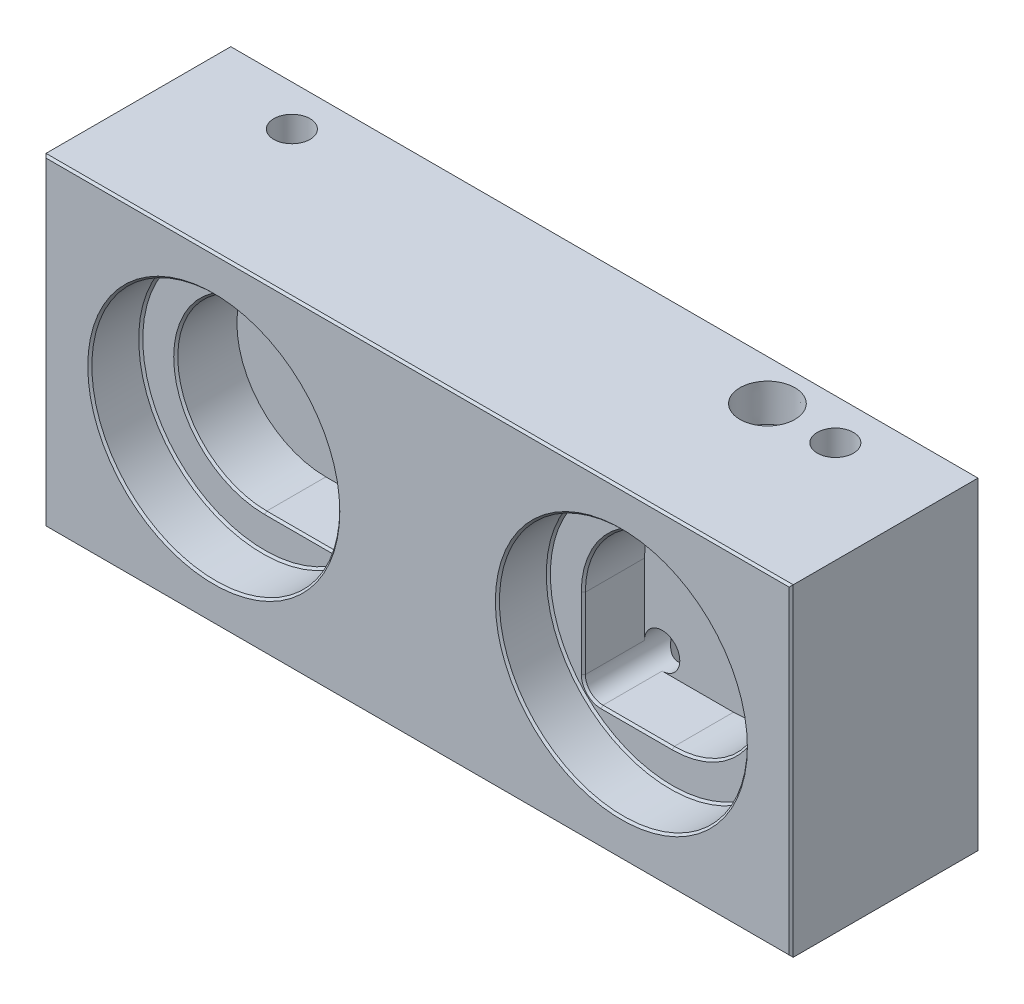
ISO-10303-21;
HEADER;
FILE_DESCRIPTION(('STEP AP214'),'2;1');
FILE_NAME('part.step','',(''),(''),'','','');
FILE_SCHEMA(('AUTOMOTIVE_DESIGN { 1 0 10303 214 1 1 1 1 }'));
ENDSEC;
DATA;
#1=APPLICATION_CONTEXT('core data for automotive mechanical design processes');
#2=APPLICATION_PROTOCOL_DEFINITION('international standard','automotive_design',2000,#1);
#3=PRODUCT_CONTEXT('',#1,'mechanical');
#4=PRODUCT('Part','Part','',(#3));
#5=PRODUCT_RELATED_PRODUCT_CATEGORY('part','',(#4));
#6=PRODUCT_DEFINITION_FORMATION('','',#4);
#7=PRODUCT_DEFINITION_CONTEXT('part definition',#1,'design');
#8=PRODUCT_DEFINITION('design','',#6,#7);
#9=PRODUCT_DEFINITION_SHAPE('','',#8);
#10=(LENGTH_UNIT() NAMED_UNIT(*) SI_UNIT(.MILLI.,.METRE.));
#11=(NAMED_UNIT(*) PLANE_ANGLE_UNIT() SI_UNIT($,.RADIAN.));
#12=(NAMED_UNIT(*) SI_UNIT($,.STERADIAN.) SOLID_ANGLE_UNIT());
#13=UNCERTAINTY_MEASURE_WITH_UNIT(LENGTH_MEASURE(1.E-05),#10,'distance_accuracy_value','');
#14=(GEOMETRIC_REPRESENTATION_CONTEXT(3) GLOBAL_UNCERTAINTY_ASSIGNED_CONTEXT((#13)) GLOBAL_UNIT_ASSIGNED_CONTEXT((#10,
#11,#12)) REPRESENTATION_CONTEXT('',''));
#15=CARTESIAN_POINT('',(0.,0.,0.));
#16=DIRECTION('',(0.,0.,1.));
#17=DIRECTION('',(1.,0.,0.));
#18=AXIS2_PLACEMENT_3D('',#15,#16,#17);
#19=CARTESIAN_POINT('',(0.,60.325,34.925));
#20=DIRECTION('',(0.,-1.,0.));
#21=DIRECTION('',(0.,0.,-1.));
#22=AXIS2_PLACEMENT_3D('',#19,#20,#21);
#23=PLANE('',#22);
#24=DIRECTION('',(0.,0.,-1.));
#25=VECTOR('',#24,1.);
#26=CARTESIAN_POINT('',(0.,60.325,34.925));
#27=LINE('',#26,#25);
#28=CARTESIAN_POINT('',(0.,60.325,34.544));
#29=VERTEX_POINT('',#28);
#30=CARTESIAN_POINT('',(0.,60.325,0.));
#31=VERTEX_POINT('',#30);
#32=EDGE_CURVE('E658',#29,#31,#27,.T.);
#33=ORIENTED_EDGE('',*,*,#32,.F.);
#34=DIRECTION('',(1.,0.,0.));
#35=VECTOR('',#34,1.);
#36=CARTESIAN_POINT('',(0.,60.325,34.544));
#37=LINE('',#36,#35);
#38=CARTESIAN_POINT('',(139.7,60.325,34.544));
#39=VERTEX_POINT('',#38);
#40=EDGE_CURVE('E618',#29,#39,#37,.T.);
#41=ORIENTED_EDGE('',*,*,#40,.T.);
#42=DIRECTION('',(0.,0.,-1.));
#43=VECTOR('',#42,1.);
#44=CARTESIAN_POINT('',(139.7,60.325,34.925));
#45=LINE('',#44,#43);
#46=CARTESIAN_POINT('',(139.7,60.325,0.));
#47=VERTEX_POINT('',#46);
#48=EDGE_CURVE('E667',#39,#47,#45,.T.);
#49=ORIENTED_EDGE('',*,*,#48,.T.);
#50=DIRECTION('',(-1.,0.,0.));
#51=VECTOR('',#50,1.);
#52=CARTESIAN_POINT('',(0.,60.325,0.));
#53=LINE('',#52,#51);
#54=EDGE_CURVE('E665',#47,#31,#53,.T.);
#55=ORIENTED_EDGE('',*,*,#54,.T.);
#56=EDGE_LOOP('',(#33,#41,#49,#55));
#57=FACE_BOUND('',#56,.T.);
#58=CARTESIAN_POINT('',(19.05,60.325,7.61999999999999));
#59=DIRECTION('',(0.,-1.,0.));
#60=DIRECTION('',(0.,0.,-1.));
#61=AXIS2_PLACEMENT_3D('',#58,#59,#60);
#62=CIRCLE('',#61,3.3782);
#63=CARTESIAN_POINT('',(19.05,60.325,4.2418));
#64=VERTEX_POINT('',#63);
#65=EDGE_CURVE('E277',#64,#64,#62,.T.);
#66=ORIENTED_EDGE('',*,*,#65,.T.);
#67=EDGE_LOOP('',(#66));
#68=FACE_BOUND('',#67,.T.);
#69=CARTESIAN_POINT('',(120.65,60.325,7.61999999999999));
#70=DIRECTION('',(0.,-1.,0.));
#71=DIRECTION('',(0.,0.,-1.));
#72=AXIS2_PLACEMENT_3D('',#69,#70,#71);
#73=CIRCLE('',#72,3.37819999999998);
#74=CARTESIAN_POINT('',(120.65,60.325,4.24180000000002));
#75=VERTEX_POINT('',#74);
#76=EDGE_CURVE('E270',#75,#75,#73,.T.);
#77=ORIENTED_EDGE('',*,*,#76,.T.);
#78=EDGE_LOOP('',(#77));
#79=FACE_BOUND('',#78,.T.);
#80=CARTESIAN_POINT('',(107.95,60.325,7.62));
#81=DIRECTION('',(0.,1.,0.));
#82=DIRECTION('',(0.,0.,1.));
#83=AXIS2_PLACEMENT_3D('',#80,#81,#82);
#84=CIRCLE('',#83,5.14151879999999);
#85=CARTESIAN_POINT('',(107.95,60.325,12.7615188));
#86=VERTEX_POINT('',#85);
#87=EDGE_CURVE('E1085',#86,#86,#84,.T.);
#88=ORIENTED_EDGE('',*,*,#87,.F.);
#89=EDGE_LOOP('',(#88));
#90=FACE_BOUND('',#89,.T.);
#91=ADVANCED_FACE('F39',(#57,#68,#79,#90),#23,.F.);
#92=CARTESIAN_POINT('',(94.615,9.525,7.62));
#93=DIRECTION('',(0.,-1.,0.));
#94=DIRECTION('',(0.,0.,-1.));
#95=AXIS2_PLACEMENT_3D('',#92,#93,#94);
#96=CYLINDRICAL_SURFACE('',#95,3.97509999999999);
#97=CARTESIAN_POINT('',(94.615,9.525,7.62));
#98=DIRECTION('',(0.,-1.,0.));
#99=DIRECTION('',(0.,0.,-1.));
#100=AXIS2_PLACEMENT_3D('',#97,#98,#99);
#101=CIRCLE('',#100,3.97509999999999);
#102=CARTESIAN_POINT('',(94.615,9.525,3.64490000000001));
#103=VERTEX_POINT('',#102);
#104=EDGE_CURVE('E258',#103,#103,#101,.T.);
#105=CARTESIAN_POINT('',(94.615,1.3716,7.62));
#106=DIRECTION('',(0.,-1.,0.));
#107=DIRECTION('',(0.,0.,-1.));
#108=AXIS2_PLACEMENT_3D('',#105,#106,#107);
#109=CIRCLE('',#108,3.97509999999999);
#110=CARTESIAN_POINT('',(94.615,1.3716,3.64490000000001));
#111=VERTEX_POINT('',#110);
#112=EDGE_CURVE('E239',#111,#111,#109,.F.);
#113=CARTESIAN_POINT('',(94.615,9.525,3.64490000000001));
#114=CARTESIAN_POINT('',(94.615,9.44006875,3.64490000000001));
#115=CARTESIAN_POINT('',(94.615,9.3551375,3.64490000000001));
#116=CARTESIAN_POINT('',(94.615,9.185275,3.64490000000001));
#117=CARTESIAN_POINT('',(94.615,9.10034375,3.64490000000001));
#118=CARTESIAN_POINT('',(94.615,8.93048125,3.64490000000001));
#119=CARTESIAN_POINT('',(94.615,8.84555,3.64490000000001));
#120=CARTESIAN_POINT('',(94.615,8.6756875,3.64490000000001));
#121=CARTESIAN_POINT('',(94.615,8.59075625,3.64490000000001));
#122=CARTESIAN_POINT('',(94.615,8.42089375,3.64490000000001));
#123=CARTESIAN_POINT('',(94.615,8.3359625,3.64490000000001));
#124=CARTESIAN_POINT('',(94.615,8.1661,3.64490000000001));
#125=CARTESIAN_POINT('',(94.615,8.08116875,3.64490000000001));
#126=CARTESIAN_POINT('',(94.615,7.91130625,3.64490000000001));
#127=CARTESIAN_POINT('',(94.615,7.826375,3.64490000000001));
#128=CARTESIAN_POINT('',(94.615,7.6565125,3.64490000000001));
#129=CARTESIAN_POINT('',(94.615,7.57158125,3.64490000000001));
#130=CARTESIAN_POINT('',(94.615,7.40171875,3.64490000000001));
#131=CARTESIAN_POINT('',(94.615,7.3167875,3.64490000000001));
#132=CARTESIAN_POINT('',(94.615,7.146925,3.64490000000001));
#133=CARTESIAN_POINT('',(94.615,7.06199375,3.64490000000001));
#134=CARTESIAN_POINT('',(94.615,6.89213125,3.64490000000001));
#135=CARTESIAN_POINT('',(94.615,6.8072,3.64490000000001));
#136=CARTESIAN_POINT('',(94.615,6.6373375,3.64490000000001));
#137=CARTESIAN_POINT('',(94.615,6.55240625,3.64490000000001));
#138=CARTESIAN_POINT('',(94.615,6.38254375,3.64490000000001));
#139=CARTESIAN_POINT('',(94.615,6.2976125,3.64490000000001));
#140=CARTESIAN_POINT('',(94.615,6.12775,3.64490000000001));
#141=CARTESIAN_POINT('',(94.615,6.04281875,3.64490000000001));
#142=CARTESIAN_POINT('',(94.615,5.87295625,3.64490000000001));
#143=CARTESIAN_POINT('',(94.615,5.788025,3.64490000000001));
#144=CARTESIAN_POINT('',(94.615,5.6181625,3.64490000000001));
#145=CARTESIAN_POINT('',(94.615,5.53323125,3.64490000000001));
#146=CARTESIAN_POINT('',(94.615,5.36336875,3.64490000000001));
#147=CARTESIAN_POINT('',(94.615,5.2784375,3.64490000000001));
#148=CARTESIAN_POINT('',(94.615,5.108575,3.64490000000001));
#149=CARTESIAN_POINT('',(94.615,5.02364375,3.64490000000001));
#150=CARTESIAN_POINT('',(94.615,4.85378125,3.64490000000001));
#151=CARTESIAN_POINT('',(94.615,4.76885,3.64490000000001));
#152=CARTESIAN_POINT('',(94.615,4.5989875,3.64490000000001));
#153=CARTESIAN_POINT('',(94.615,4.51405625,3.64490000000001));
#154=CARTESIAN_POINT('',(94.615,4.34419375,3.64490000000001));
#155=CARTESIAN_POINT('',(94.615,4.2592625,3.64490000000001));
#156=CARTESIAN_POINT('',(94.615,4.0894,3.64490000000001));
#157=CARTESIAN_POINT('',(94.615,4.00446875,3.64490000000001));
#158=CARTESIAN_POINT('',(94.615,3.83460625,3.64490000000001));
#159=CARTESIAN_POINT('',(94.615,3.749675,3.64490000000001));
#160=CARTESIAN_POINT('',(94.615,3.5798125,3.64490000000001));
#161=CARTESIAN_POINT('',(94.615,3.49488125,3.64490000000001));
#162=CARTESIAN_POINT('',(94.615,3.32501875,3.64490000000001));
#163=CARTESIAN_POINT('',(94.615,3.2400875,3.64490000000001));
#164=CARTESIAN_POINT('',(94.615,3.070225,3.64490000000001));
#165=CARTESIAN_POINT('',(94.615,2.98529375,3.64490000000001));
#166=CARTESIAN_POINT('',(94.615,2.81543125,3.64490000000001));
#167=CARTESIAN_POINT('',(94.615,2.7305,3.64490000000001));
#168=CARTESIAN_POINT('',(94.615,2.5606375,3.64490000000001));
#169=CARTESIAN_POINT('',(94.615,2.47570625,3.64490000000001));
#170=CARTESIAN_POINT('',(94.615,2.30584375,3.64490000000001));
#171=CARTESIAN_POINT('',(94.615,2.2209125,3.64490000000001));
#172=CARTESIAN_POINT('',(94.615,2.05105,3.64490000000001));
#173=CARTESIAN_POINT('',(94.615,1.96611875,3.64490000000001));
#174=CARTESIAN_POINT('',(94.615,1.79625625,3.64490000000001));
#175=CARTESIAN_POINT('',(94.615,1.711325,3.64490000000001));
#176=CARTESIAN_POINT('',(94.615,1.5414625,3.64490000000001));
#177=CARTESIAN_POINT('',(94.615,1.45653125,3.64490000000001));
#178=CARTESIAN_POINT('',(94.615,1.3716,3.64490000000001));
#179=B_SPLINE_CURVE_WITH_KNOTS('',3,(#113,#114,#115,#116,#117,#118,#119,#120,#121,#122,#123,
#124,#125,#126,#127,#128,#129,#130,#131,#132,#133,#134,#135,#136,#137,#138,#139,#140,#141,#142,
#143,#144,#145,#146,#147,#148,#149,#150,#151,#152,#153,#154,#155,#156,#157,#158,#159,#160,#161,
#162,#163,#164,#165,#166,#167,#168,#169,#170,#171,#172,#173,#174,#175,#176,#177,#178),
.UNSPECIFIED.,.F.,.F.,(4,2,2,2,2,2,2,2,2,2,2,2,2,2,2,2,2,2,2,2,2,2,2,2,2,2,2,2,2,2,2,2,4),(0.,
0.254793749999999,0.509587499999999,0.76438125,1.019175,1.27396875,1.5287625,1.78355625,2.03835,
2.29314375,2.5479375,2.80273125,3.057525,3.31231875,3.5671125,3.82190625,4.0767,4.33149375,
4.5862875,4.84108125,5.095875,5.35066875,5.6054625,5.86025625,6.11505,6.36984375,6.6246375,
6.87943125,7.134225,7.38901875,7.6438125,7.89860625,8.1534),.UNSPECIFIED.);
#180=EDGE_CURVE('BSEAM392',#103,#111,#179,.T.);
#181=ORIENTED_EDGE('',*,*,#104,.F.);
#182=ORIENTED_EDGE('',*,*,#112,.F.);
#183=ORIENTED_EDGE('',*,*,#180,.T.);
#184=ORIENTED_EDGE('',*,*,#180,.F.);
#185=EDGE_LOOP('',(#181,#183,#182,#184));
#186=FACE_BOUND('',#185,.T.);
#187=ADVANCED_FACE('F392',(#186),#96,.F.);
#188=CARTESIAN_POINT('',(45.085,9.525,7.62));
#189=DIRECTION('',(0.,-1.,0.));
#190=DIRECTION('',(0.,0.,-1.));
#191=AXIS2_PLACEMENT_3D('',#188,#189,#190);
#192=CYLINDRICAL_SURFACE('',#191,3.97510000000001);
#193=CARTESIAN_POINT('',(45.085,9.525,7.62));
#194=DIRECTION('',(0.,-1.,0.));
#195=DIRECTION('',(0.,0.,-1.));
#196=AXIS2_PLACEMENT_3D('',#193,#194,#195);
#197=CIRCLE('',#196,3.97510000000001);
#198=CARTESIAN_POINT('',(45.085,9.525,3.64489999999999));
#199=VERTEX_POINT('',#198);
#200=EDGE_CURVE('E262',#199,#199,#197,.T.);
#201=CARTESIAN_POINT('',(45.085,1.3716,7.62));
#202=DIRECTION('',(0.,-1.,0.));
#203=DIRECTION('',(0.,0.,-1.));
#204=AXIS2_PLACEMENT_3D('',#201,#202,#203);
#205=CIRCLE('',#204,3.97510000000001);
#206=CARTESIAN_POINT('',(45.085,1.3716,3.64489999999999));
#207=VERTEX_POINT('',#206);
#208=EDGE_CURVE('E247',#207,#207,#205,.F.);
#209=CARTESIAN_POINT('',(45.085,9.525,3.64489999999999));
#210=CARTESIAN_POINT('',(45.085,9.44006875,3.64489999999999));
#211=CARTESIAN_POINT('',(45.085,9.3551375,3.64489999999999));
#212=CARTESIAN_POINT('',(45.085,9.185275,3.64489999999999));
#213=CARTESIAN_POINT('',(45.085,9.10034375,3.64489999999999));
#214=CARTESIAN_POINT('',(45.085,8.93048125,3.64489999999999));
#215=CARTESIAN_POINT('',(45.085,8.84555,3.64489999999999));
#216=CARTESIAN_POINT('',(45.085,8.6756875,3.64489999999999));
#217=CARTESIAN_POINT('',(45.085,8.59075625,3.64489999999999));
#218=CARTESIAN_POINT('',(45.085,8.42089375,3.64489999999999));
#219=CARTESIAN_POINT('',(45.085,8.3359625,3.64489999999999));
#220=CARTESIAN_POINT('',(45.085,8.1661,3.64489999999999));
#221=CARTESIAN_POINT('',(45.085,8.08116875,3.64489999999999));
#222=CARTESIAN_POINT('',(45.085,7.91130625,3.64489999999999));
#223=CARTESIAN_POINT('',(45.085,7.826375,3.64489999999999));
#224=CARTESIAN_POINT('',(45.085,7.6565125,3.64489999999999));
#225=CARTESIAN_POINT('',(45.085,7.57158125,3.64489999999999));
#226=CARTESIAN_POINT('',(45.085,7.40171875,3.64489999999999));
#227=CARTESIAN_POINT('',(45.085,7.3167875,3.64489999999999));
#228=CARTESIAN_POINT('',(45.085,7.146925,3.64489999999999));
#229=CARTESIAN_POINT('',(45.085,7.06199375,3.64489999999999));
#230=CARTESIAN_POINT('',(45.085,6.89213125,3.64489999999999));
#231=CARTESIAN_POINT('',(45.085,6.8072,3.64489999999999));
#232=CARTESIAN_POINT('',(45.085,6.6373375,3.64489999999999));
#233=CARTESIAN_POINT('',(45.085,6.55240625,3.64489999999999));
#234=CARTESIAN_POINT('',(45.085,6.38254375,3.64489999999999));
#235=CARTESIAN_POINT('',(45.085,6.2976125,3.64489999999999));
#236=CARTESIAN_POINT('',(45.085,6.12775,3.64489999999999));
#237=CARTESIAN_POINT('',(45.085,6.04281875,3.64489999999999));
#238=CARTESIAN_POINT('',(45.085,5.87295625,3.64489999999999));
#239=CARTESIAN_POINT('',(45.085,5.788025,3.64489999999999));
#240=CARTESIAN_POINT('',(45.085,5.6181625,3.64489999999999));
#241=CARTESIAN_POINT('',(45.085,5.53323125,3.64489999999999));
#242=CARTESIAN_POINT('',(45.085,5.36336875,3.64489999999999));
#243=CARTESIAN_POINT('',(45.085,5.2784375,3.64489999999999));
#244=CARTESIAN_POINT('',(45.085,5.108575,3.64489999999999));
#245=CARTESIAN_POINT('',(45.085,5.02364375,3.64489999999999));
#246=CARTESIAN_POINT('',(45.085,4.85378125,3.64489999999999));
#247=CARTESIAN_POINT('',(45.085,4.76885,3.64489999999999));
#248=CARTESIAN_POINT('',(45.085,4.5989875,3.64489999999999));
#249=CARTESIAN_POINT('',(45.085,4.51405625,3.64489999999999));
#250=CARTESIAN_POINT('',(45.085,4.34419375,3.64489999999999));
#251=CARTESIAN_POINT('',(45.085,4.2592625,3.64489999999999));
#252=CARTESIAN_POINT('',(45.085,4.0894,3.64489999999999));
#253=CARTESIAN_POINT('',(45.085,4.00446875,3.64489999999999));
#254=CARTESIAN_POINT('',(45.085,3.83460625,3.64489999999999));
#255=CARTESIAN_POINT('',(45.085,3.749675,3.64489999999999));
#256=CARTESIAN_POINT('',(45.085,3.5798125,3.64489999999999));
#257=CARTESIAN_POINT('',(45.085,3.49488125,3.64489999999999));
#258=CARTESIAN_POINT('',(45.085,3.32501875,3.64489999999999));
#259=CARTESIAN_POINT('',(45.085,3.2400875,3.64489999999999));
#260=CARTESIAN_POINT('',(45.085,3.070225,3.64489999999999));
#261=CARTESIAN_POINT('',(45.085,2.98529375,3.64489999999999));
#262=CARTESIAN_POINT('',(45.085,2.81543125,3.64489999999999));
#263=CARTESIAN_POINT('',(45.085,2.7305,3.64489999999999));
#264=CARTESIAN_POINT('',(45.085,2.5606375,3.64489999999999));
#265=CARTESIAN_POINT('',(45.085,2.47570625,3.64489999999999));
#266=CARTESIAN_POINT('',(45.085,2.30584375,3.64489999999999));
#267=CARTESIAN_POINT('',(45.085,2.2209125,3.64489999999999));
#268=CARTESIAN_POINT('',(45.085,2.05105,3.64489999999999));
#269=CARTESIAN_POINT('',(45.085,1.96611875,3.64489999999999));
#270=CARTESIAN_POINT('',(45.085,1.79625625,3.64489999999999));
#271=CARTESIAN_POINT('',(45.085,1.711325,3.64489999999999));
#272=CARTESIAN_POINT('',(45.085,1.5414625,3.64489999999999));
#273=CARTESIAN_POINT('',(45.085,1.45653125,3.64489999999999));
#274=CARTESIAN_POINT('',(45.085,1.3716,3.64489999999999));
#275=B_SPLINE_CURVE_WITH_KNOTS('',3,(#209,#210,#211,#212,#213,#214,#215,#216,#217,#218,#219,
#220,#221,#222,#223,#224,#225,#226,#227,#228,#229,#230,#231,#232,#233,#234,#235,#236,#237,#238,
#239,#240,#241,#242,#243,#244,#245,#246,#247,#248,#249,#250,#251,#252,#253,#254,#255,#256,#257,
#258,#259,#260,#261,#262,#263,#264,#265,#266,#267,#268,#269,#270,#271,#272,#273,#274),
.UNSPECIFIED.,.F.,.F.,(4,2,2,2,2,2,2,2,2,2,2,2,2,2,2,2,2,2,2,2,2,2,2,2,2,2,2,2,2,2,2,2,4),(0.,
0.254793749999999,0.509587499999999,0.76438125,1.019175,1.27396875,1.5287625,1.78355625,2.03835,
2.29314375,2.5479375,2.80273125,3.057525,3.31231875,3.5671125,3.82190625,4.0767,4.33149375,
4.5862875,4.84108125,5.095875,5.35066875,5.6054625,5.86025625,6.11505,6.36984375,6.6246375,
6.87943125,7.134225,7.38901875,7.6438125,7.89860625,8.1534),.UNSPECIFIED.);
#276=EDGE_CURVE('BSEAM395',#199,#207,#275,.T.);
#277=ORIENTED_EDGE('',*,*,#200,.F.);
#278=ORIENTED_EDGE('',*,*,#208,.F.);
#279=ORIENTED_EDGE('',*,*,#276,.T.);
#280=ORIENTED_EDGE('',*,*,#276,.F.);
#281=EDGE_LOOP('',(#277,#279,#278,#280));
#282=FACE_BOUND('',#281,.T.);
#283=ADVANCED_FACE('F395',(#282),#192,.F.);
#284=CARTESIAN_POINT('',(31.75,9.525,7.61999999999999));
#285=DIRECTION('',(0.,-1.,0.));
#286=DIRECTION('',(0.,0.,-1.));
#287=AXIS2_PLACEMENT_3D('',#284,#285,#286);
#288=CYLINDRICAL_SURFACE('',#287,3.97510000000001);
#289=CARTESIAN_POINT('',(31.75,9.525,7.61999999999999));
#290=DIRECTION('',(0.,-1.,0.));
#291=DIRECTION('',(0.,0.,-1.));
#292=AXIS2_PLACEMENT_3D('',#289,#290,#291);
#293=CIRCLE('',#292,3.97510000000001);
#294=CARTESIAN_POINT('',(31.75,9.525,3.64489999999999));
#295=VERTEX_POINT('',#294);
#296=EDGE_CURVE('E266',#295,#295,#293,.T.);
#297=CARTESIAN_POINT('',(31.75,1.3716,7.61999999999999));
#298=DIRECTION('',(0.,-1.,0.));
#299=DIRECTION('',(0.,0.,-1.));
#300=AXIS2_PLACEMENT_3D('',#297,#298,#299);
#301=CIRCLE('',#300,3.97510000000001);
#302=CARTESIAN_POINT('',(31.75,1.3716,3.64489999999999));
#303=VERTEX_POINT('',#302);
#304=EDGE_CURVE('E254',#303,#303,#301,.F.);
#305=CARTESIAN_POINT('',(31.75,9.525,3.64489999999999));
#306=CARTESIAN_POINT('',(31.75,9.44006875,3.64489999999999));
#307=CARTESIAN_POINT('',(31.75,9.3551375,3.64489999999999));
#308=CARTESIAN_POINT('',(31.75,9.185275,3.64489999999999));
#309=CARTESIAN_POINT('',(31.75,9.10034375,3.64489999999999));
#310=CARTESIAN_POINT('',(31.75,8.93048125,3.64489999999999));
#311=CARTESIAN_POINT('',(31.75,8.84555,3.64489999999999));
#312=CARTESIAN_POINT('',(31.75,8.6756875,3.64489999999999));
#313=CARTESIAN_POINT('',(31.75,8.59075625,3.64489999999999));
#314=CARTESIAN_POINT('',(31.75,8.42089375,3.64489999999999));
#315=CARTESIAN_POINT('',(31.75,8.3359625,3.64489999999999));
#316=CARTESIAN_POINT('',(31.75,8.1661,3.64489999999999));
#317=CARTESIAN_POINT('',(31.75,8.08116875,3.64489999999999));
#318=CARTESIAN_POINT('',(31.75,7.91130625,3.64489999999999));
#319=CARTESIAN_POINT('',(31.75,7.826375,3.64489999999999));
#320=CARTESIAN_POINT('',(31.75,7.6565125,3.64489999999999));
#321=CARTESIAN_POINT('',(31.75,7.57158125,3.64489999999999));
#322=CARTESIAN_POINT('',(31.75,7.40171875,3.64489999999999));
#323=CARTESIAN_POINT('',(31.75,7.3167875,3.64489999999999));
#324=CARTESIAN_POINT('',(31.75,7.146925,3.64489999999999));
#325=CARTESIAN_POINT('',(31.75,7.06199375,3.64489999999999));
#326=CARTESIAN_POINT('',(31.75,6.89213125,3.64489999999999));
#327=CARTESIAN_POINT('',(31.75,6.8072,3.64489999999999));
#328=CARTESIAN_POINT('',(31.75,6.6373375,3.64489999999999));
#329=CARTESIAN_POINT('',(31.75,6.55240625,3.64489999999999));
#330=CARTESIAN_POINT('',(31.75,6.38254375,3.64489999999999));
#331=CARTESIAN_POINT('',(31.75,6.2976125,3.64489999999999));
#332=CARTESIAN_POINT('',(31.75,6.12775,3.64489999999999));
#333=CARTESIAN_POINT('',(31.75,6.04281875,3.64489999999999));
#334=CARTESIAN_POINT('',(31.75,5.87295625,3.64489999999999));
#335=CARTESIAN_POINT('',(31.75,5.788025,3.64489999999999));
#336=CARTESIAN_POINT('',(31.75,5.6181625,3.64489999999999));
#337=CARTESIAN_POINT('',(31.75,5.53323125,3.64489999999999));
#338=CARTESIAN_POINT('',(31.75,5.36336875,3.64489999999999));
#339=CARTESIAN_POINT('',(31.75,5.2784375,3.64489999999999));
#340=CARTESIAN_POINT('',(31.75,5.108575,3.64489999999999));
#341=CARTESIAN_POINT('',(31.75,5.02364375,3.64489999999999));
#342=CARTESIAN_POINT('',(31.75,4.85378125,3.64489999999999));
#343=CARTESIAN_POINT('',(31.75,4.76885,3.64489999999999));
#344=CARTESIAN_POINT('',(31.75,4.5989875,3.64489999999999));
#345=CARTESIAN_POINT('',(31.75,4.51405625,3.64489999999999));
#346=CARTESIAN_POINT('',(31.75,4.34419375,3.64489999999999));
#347=CARTESIAN_POINT('',(31.75,4.2592625,3.64489999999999));
#348=CARTESIAN_POINT('',(31.75,4.0894,3.64489999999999));
#349=CARTESIAN_POINT('',(31.75,4.00446875,3.64489999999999));
#350=CARTESIAN_POINT('',(31.75,3.83460625,3.64489999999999));
#351=CARTESIAN_POINT('',(31.75,3.749675,3.64489999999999));
#352=CARTESIAN_POINT('',(31.75,3.5798125,3.64489999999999));
#353=CARTESIAN_POINT('',(31.75,3.49488125,3.64489999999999));
#354=CARTESIAN_POINT('',(31.75,3.32501875,3.64489999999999));
#355=CARTESIAN_POINT('',(31.75,3.2400875,3.64489999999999));
#356=CARTESIAN_POINT('',(31.75,3.070225,3.64489999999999));
#357=CARTESIAN_POINT('',(31.75,2.98529375,3.64489999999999));
#358=CARTESIAN_POINT('',(31.75,2.81543125,3.64489999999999));
#359=CARTESIAN_POINT('',(31.75,2.7305,3.64489999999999));
#360=CARTESIAN_POINT('',(31.75,2.5606375,3.64489999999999));
#361=CARTESIAN_POINT('',(31.75,2.47570625,3.64489999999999));
#362=CARTESIAN_POINT('',(31.75,2.30584375,3.64489999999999));
#363=CARTESIAN_POINT('',(31.75,2.2209125,3.64489999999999));
#364=CARTESIAN_POINT('',(31.75,2.05105,3.64489999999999));
#365=CARTESIAN_POINT('',(31.75,1.96611875,3.64489999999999));
#366=CARTESIAN_POINT('',(31.75,1.79625625,3.64489999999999));
#367=CARTESIAN_POINT('',(31.75,1.711325,3.64489999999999));
#368=CARTESIAN_POINT('',(31.75,1.5414625,3.64489999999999));
#369=CARTESIAN_POINT('',(31.75,1.45653125,3.64489999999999));
#370=CARTESIAN_POINT('',(31.75,1.3716,3.64489999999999));
#371=B_SPLINE_CURVE_WITH_KNOTS('',3,(#305,#306,#307,#308,#309,#310,#311,#312,#313,#314,#315,
#316,#317,#318,#319,#320,#321,#322,#323,#324,#325,#326,#327,#328,#329,#330,#331,#332,#333,#334,
#335,#336,#337,#338,#339,#340,#341,#342,#343,#344,#345,#346,#347,#348,#349,#350,#351,#352,#353,
#354,#355,#356,#357,#358,#359,#360,#361,#362,#363,#364,#365,#366,#367,#368,#369,#370),
.UNSPECIFIED.,.F.,.F.,(4,2,2,2,2,2,2,2,2,2,2,2,2,2,2,2,2,2,2,2,2,2,2,2,2,2,2,2,2,2,2,2,4),(0.,
0.254793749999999,0.509587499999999,0.76438125,1.019175,1.27396875,1.5287625,1.78355625,2.03835,
2.29314375,2.5479375,2.80273125,3.057525,3.31231875,3.5671125,3.82190625,4.0767,4.33149375,
4.5862875,4.84108125,5.095875,5.35066875,5.6054625,5.86025625,6.11505,6.36984375,6.6246375,
6.87943125,7.134225,7.38901875,7.6438125,7.89860625,8.1534),.UNSPECIFIED.);
#372=EDGE_CURVE('BSEAM403',#295,#303,#371,.T.);
#373=ORIENTED_EDGE('',*,*,#296,.F.);
#374=ORIENTED_EDGE('',*,*,#304,.F.);
#375=ORIENTED_EDGE('',*,*,#372,.T.);
#376=ORIENTED_EDGE('',*,*,#372,.F.);
#377=EDGE_LOOP('',(#373,#375,#374,#376));
#378=FACE_BOUND('',#377,.T.);
#379=ADVANCED_FACE('F403',(#378),#288,.F.);
#380=CARTESIAN_POINT('',(94.615,19.05,7.62000000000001));
#381=DIRECTION('',(0.,-1.,0.));
#382=DIRECTION('',(0.,0.,-1.));
#383=AXIS2_PLACEMENT_3D('',#380,#381,#382);
#384=CYLINDRICAL_SURFACE('',#383,3.37819999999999);
#385=CARTESIAN_POINT('',(94.615,19.05,7.62000000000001));
#386=DIRECTION('',(0.,-1.,0.));
#387=DIRECTION('',(0.,0.,-1.));
#388=AXIS2_PLACEMENT_3D('',#385,#386,#387);
#389=CIRCLE('',#388,3.37819999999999);
#390=CARTESIAN_POINT('',(92.1729316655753,19.05,9.95421024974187));
#391=VERTEX_POINT('',#390);
#392=CARTESIAN_POINT('',(97.0570683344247,19.05,9.95421024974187));
#393=VERTEX_POINT('',#392);
#394=EDGE_CURVE('E280',#391,#393,#389,.T.);
#395=ORIENTED_EDGE('',*,*,#394,.F.);
#396=CARTESIAN_POINT('',(97.0570683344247,19.05,9.95421024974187));
#397=CARTESIAN_POINT('',(97.095727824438,19.0075175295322,9.91376224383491));
#398=CARTESIAN_POINT('',(97.1330046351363,18.964335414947,9.87275317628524));
#399=CARTESIAN_POINT('',(97.2048468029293,18.8766733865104,9.78977942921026));
#400=CARTESIAN_POINT('',(97.2394126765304,18.8321937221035,9.7478149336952));
#401=CARTESIAN_POINT('',(97.3391284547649,18.6969596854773,9.62073686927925));
#402=CARTESIAN_POINT('',(97.4003169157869,18.6043876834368,9.5344171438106));
#403=CARTESIAN_POINT('',(97.5122850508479,18.415259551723,9.36030253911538));
#404=CARTESIAN_POINT('',(97.5631016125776,18.3187190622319,9.272514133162));
#405=CARTESIAN_POINT('',(97.6549332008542,18.121286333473,9.09676374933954));
#406=CARTESIAN_POINT('',(97.695952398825,18.0203959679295,9.00880186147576));
#407=CARTESIAN_POINT('',(97.757246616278,17.8449787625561,8.86208302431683));
#408=CARTESIAN_POINT('',(97.7800230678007,17.7718752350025,8.80265612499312));
#409=CARTESIAN_POINT('',(97.8209738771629,17.6218639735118,8.68664126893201));
#410=CARTESIAN_POINT('',(97.8391391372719,17.5449490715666,8.63005909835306));
#411=CARTESIAN_POINT('',(97.866467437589,17.4061129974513,8.53754558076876));
#412=CARTESIAN_POINT('',(97.8767436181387,17.3454612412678,8.50005891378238));
#413=CARTESIAN_POINT('',(97.894230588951,17.2197434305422,8.43245327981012));
#414=CARTESIAN_POINT('',(97.9014531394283,17.1546954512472,8.40230624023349));
#415=CARTESIAN_POINT('',(97.9099965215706,17.0462723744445,8.36528471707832));
#416=CARTESIAN_POINT('',(97.9125222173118,17.0045875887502,8.3539234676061));
#417=CARTESIAN_POINT('',(97.9159770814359,16.9198990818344,8.33822939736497));
#418=CARTESIAN_POINT('',(97.9169111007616,16.8768997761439,8.33387522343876));
#419=CARTESIAN_POINT('',(97.9170769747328,16.7906509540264,8.33310847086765));
#420=CARTESIAN_POINT('',(97.9163020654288,16.7474011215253,8.33672744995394));
#421=CARTESIAN_POINT('',(97.9131347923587,16.6621417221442,8.35115862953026));
#422=CARTESIAN_POINT('',(97.9107380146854,16.6201358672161,8.36199045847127));
#423=CARTESIAN_POINT('',(97.902483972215,16.5106791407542,8.39794304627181));
#424=CARTESIAN_POINT('',(97.8953849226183,16.4449374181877,8.42777559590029));
#425=CARTESIAN_POINT('',(97.8780713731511,16.3178765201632,8.49511501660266));
#426=CARTESIAN_POINT('',(97.8678405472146,16.2565826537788,8.53266175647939));
#427=CARTESIAN_POINT('',(97.8460854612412,16.1447892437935,8.60672476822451));
#428=CARTESIAN_POINT('',(97.8348899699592,16.0939068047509,8.64276743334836));
#429=CARTESIAN_POINT('',(97.8104768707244,15.9939670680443,8.71666863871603));
#430=CARTESIAN_POINT('',(97.7972583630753,15.9449105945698,8.75452798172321));
#431=CARTESIAN_POINT('',(97.7545898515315,15.7996886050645,8.8697613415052));
#432=CARTESIAN_POINT('',(97.7221569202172,15.705620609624,8.9486841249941));
#433=CARTESIAN_POINT('',(97.649269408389,15.5212734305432,9.10766525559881));
#434=CARTESIAN_POINT('',(97.6087961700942,15.431003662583,9.18772583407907));
#435=CARTESIAN_POINT('',(97.5197239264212,15.2541012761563,9.34717957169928));
#436=CARTESIAN_POINT('',(97.4711318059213,15.1674656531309,9.42657323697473));
#437=CARTESIAN_POINT('',(97.3616563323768,14.9915891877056,9.58937076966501));
#438=CARTESIAN_POINT('',(97.300134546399,14.9026200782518,9.67264411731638));
#439=CARTESIAN_POINT('',(97.1670465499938,14.7293524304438,9.83594759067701));
#440=CARTESIAN_POINT('',(97.0954757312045,14.6450560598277,9.91597620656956));
#441=CARTESIAN_POINT('',(96.8655526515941,14.4009928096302,10.1487447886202));
#442=CARTESIAN_POINT('',(96.6913869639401,14.2490518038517,10.2951053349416));
#443=CARTESIAN_POINT('',(96.3779552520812,14.0318277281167,10.5052064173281));
#444=CARTESIAN_POINT('',(96.2523010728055,13.9560942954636,10.57867385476));
#445=CARTESIAN_POINT('',(95.9857286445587,13.8197413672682,10.7111772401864));
#446=CARTESIAN_POINT('',(95.8448166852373,13.7591156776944,10.7702191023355));
#447=CARTESIAN_POINT('',(95.6231532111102,13.6821749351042,10.8452239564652));
#448=CARTESIAN_POINT('',(95.5470888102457,13.6587689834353,10.8680559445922));
#449=CARTESIAN_POINT('',(95.3922026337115,13.617270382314,10.9085535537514));
#450=CARTESIAN_POINT('',(95.31338243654,13.5991747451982,10.9262220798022));
#451=CARTESIAN_POINT('',(95.1536580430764,13.5687190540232,10.9559667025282));
#452=CARTESIAN_POINT('',(95.0727554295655,13.5563547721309,10.9680469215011));
#453=CARTESIAN_POINT('',(94.9096315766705,13.5376445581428,10.9863297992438));
#454=CARTESIAN_POINT('',(94.8274105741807,13.5312975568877,10.9925335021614));
#455=CARTESIAN_POINT('',(94.6040404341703,13.52252240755,11.0011100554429));
#456=CARTESIAN_POINT('',(94.4623431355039,13.5260410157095,10.9976700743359));
#457=CARTESIAN_POINT('',(94.1821722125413,13.55096356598,10.9733141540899));
#458=CARTESIAN_POINT('',(94.0436985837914,13.5723674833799,10.9523982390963));
#459=CARTESIAN_POINT('',(93.7799174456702,13.6301184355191,10.8960102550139));
#460=CARTESIAN_POINT('',(93.6542976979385,13.6657453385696,10.8612398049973));
#461=CARTESIAN_POINT('',(93.4118031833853,13.7498350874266,10.7792665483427));
#462=CARTESIAN_POINT('',(93.2949306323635,13.7983011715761,10.7320606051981));
#463=CARTESIAN_POINT('',(93.0226818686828,13.9293297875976,10.6046432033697));
#464=CARTESIAN_POINT('',(92.872578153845,14.0175651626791,10.518995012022));
#465=CARTESIAN_POINT('',(92.5940039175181,14.2106952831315,10.3322104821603));
#466=CARTESIAN_POINT('',(92.4655968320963,14.315637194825,10.2310303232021));
#467=CARTESIAN_POINT('',(92.2670236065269,14.5031509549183,10.0512875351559));
#468=CARTESIAN_POINT('',(92.1911775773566,14.5825033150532,9.97550199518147));
#469=CARTESIAN_POINT('',(92.0493094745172,14.746115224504,9.82012106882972));
#470=CARTESIAN_POINT('',(91.9832879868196,14.8303750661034,9.7405254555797));
#471=CARTESIAN_POINT('',(91.8608391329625,15.0029513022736,9.57885125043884));
#472=CARTESIAN_POINT('',(91.804394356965,15.0912599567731,9.49677749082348));
#473=CARTESIAN_POINT('',(91.7006272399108,15.2717135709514,9.33119732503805));
#474=CARTESIAN_POINT('',(91.6533008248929,15.3638567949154,9.247691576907));
#475=CARTESIAN_POINT('',(91.5735146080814,15.5389070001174,9.09245177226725));
#476=CARTESIAN_POINT('',(91.5398999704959,15.6212894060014,9.02071456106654));
#477=CARTESIAN_POINT('',(91.4789594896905,15.7899304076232,8.87835933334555));
#478=CARTESIAN_POINT('',(91.4516584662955,15.8762027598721,8.80774671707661));
#479=CARTESIAN_POINT('',(91.4154709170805,16.0099598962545,8.70471463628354));
#480=CARTESIAN_POINT('',(91.404152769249,16.0555374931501,8.67066975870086));
#481=CARTESIAN_POINT('',(91.3832362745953,16.1484007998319,8.60444818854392));
#482=CARTESIAN_POINT('',(91.3736371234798,16.195685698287,8.57227062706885));
#483=CARTESIAN_POINT('',(91.3562994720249,16.2922702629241,8.51112752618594));
#484=CARTESIAN_POINT('',(91.3485508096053,16.3415571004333,8.48214493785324));
#485=CARTESIAN_POINT('',(91.33506342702,16.4430122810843,8.42931383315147));
#486=CARTESIAN_POINT('',(91.3293191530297,16.4951721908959,8.40545120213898));
#487=CARTESIAN_POINT('',(91.3207750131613,16.5961751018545,8.36875372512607));
#488=CARTESIAN_POINT('',(91.3176950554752,16.6446060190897,8.35490724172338));
#489=CARTESIAN_POINT('',(91.3137154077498,16.7431253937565,8.33683547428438));
#490=CARTESIAN_POINT('',(91.3128009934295,16.793200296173,8.33254522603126));
#491=CARTESIAN_POINT('',(91.3132738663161,16.8932447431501,8.33472968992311));
#492=CARTESIAN_POINT('',(91.3146686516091,16.9432134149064,8.34123947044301));
#493=CARTESIAN_POINT('',(91.3195537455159,17.0412318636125,8.36322582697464));
#494=CARTESIAN_POINT('',(91.323058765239,17.089265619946,8.37876532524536));
#495=CARTESIAN_POINT('',(91.3321469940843,17.186145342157,8.41719837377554));
#496=CARTESIAN_POINT('',(91.3378652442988,17.2347865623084,8.44055248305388));
#497=CARTESIAN_POINT('',(91.3510443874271,17.3295828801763,8.49151069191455));
#498=CARTESIAN_POINT('',(91.3585087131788,17.3757328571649,8.51912312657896));
#499=CARTESIAN_POINT('',(91.3833521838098,17.5117687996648,8.60604812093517));
#500=CARTESIAN_POINT('',(91.4031278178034,17.5987206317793,8.66919581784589));
#501=CARTESIAN_POINT('',(91.4565263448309,17.7976694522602,8.82208186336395));
#502=CARTESIAN_POINT('',(91.4925732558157,17.9077542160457,8.91337834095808));
#503=CARTESIAN_POINT('',(91.5754109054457,18.1226145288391,9.09763265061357));
#504=CARTESIAN_POINT('',(91.6222165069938,18.2273824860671,9.19059261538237));
#505=CARTESIAN_POINT('',(91.7265767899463,18.4316521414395,9.37511765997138));
#506=CARTESIAN_POINT('',(91.7840780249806,18.5311769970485,9.46668732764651));
#507=CARTESIAN_POINT('',(91.9103478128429,18.7252442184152,9.64711696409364));
#508=CARTESIAN_POINT('',(91.9791026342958,18.8197924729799,9.73598008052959));
#509=CARTESIAN_POINT('',(92.0728090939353,18.9349590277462,9.84494018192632));
#510=CARTESIAN_POINT('',(92.0922894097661,18.9582423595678,9.86700739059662));
#511=CARTESIAN_POINT('',(92.1320253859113,19.0044172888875,9.9108397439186));
#512=CARTESIAN_POINT('',(92.1522809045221,19.0273089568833,9.93260494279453));
#513=CARTESIAN_POINT('',(92.1729316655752,19.05,9.95421024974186));
#514=B_SPLINE_CURVE_WITH_KNOTS('',3,(#396,#397,#398,#399,#400,#401,#402,#403,#404,#405,#406,
#407,#408,#409,#410,#411,#412,#413,#414,#415,#416,#417,#418,#419,#420,#421,#422,#423,#424,#425,
#426,#427,#428,#429,#430,#431,#432,#433,#434,#435,#436,#437,#438,#439,#440,#441,#442,#443,#444,
#445,#446,#447,#448,#449,#450,#451,#452,#453,#454,#455,#456,#457,#458,#459,#460,#461,#462,#463,
#464,#465,#466,#467,#468,#469,#470,#471,#472,#473,#474,#475,#476,#477,#478,#479,#480,#481,#482,
#483,#484,#485,#486,#487,#488,#489,#490,#491,#492,#493,#494,#495,#496,#497,#498,#499,#500,#501,
#502,#503,#504,#505,#506,#507,#508,#509,#510,#511,#512,#513),.UNSPECIFIED.,.F.,.F.,(4,2,2,2,2,2,
2,2,2,2,2,2,2,2,2,2,2,2,2,2,2,2,2,2,2,2,2,2,2,2,2,2,2,2,2,2,2,2,2,2,2,2,2,2,2,2,2,2,2,2,2,2,2,2,
2,2,2,2,4),(0.,0.210711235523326,0.421382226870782,0.842612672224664,1.26231785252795,
1.68184401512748,1.97248022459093,2.26368546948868,2.47954757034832,2.69457059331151,
2.82392697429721,2.95288840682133,3.08236118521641,3.21218774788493,3.42857904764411,
3.64611818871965,3.83605839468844,4.02608331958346,4.40669078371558,4.78819199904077,
5.16937132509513,5.57838557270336,5.98758800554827,6.80155510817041,7.29224400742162,
7.78273139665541,8.03080153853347,8.27873184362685,8.52647896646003,8.77418206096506,
9.19708010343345,9.6199775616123,10.0237356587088,10.4275956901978,11.0065347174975,
11.5871381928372,11.9868160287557,12.3865176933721,12.7854847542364,13.1842731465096,
13.5269519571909,13.8709558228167,14.0449130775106,14.2187887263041,14.3916863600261,
14.5641010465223,14.7147577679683,14.8643871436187,15.0145033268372,15.1656783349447,
15.3280838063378,15.4908112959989,15.8179917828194,16.2599264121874,16.7024752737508,
17.1428693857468,17.5827300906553,17.6953147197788,17.8078788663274),.UNSPECIFIED.);
#515=EDGE_CURVE('E430',#393,#391,#514,.T.);
#516=ORIENTED_EDGE('',*,*,#515,.F.);
#517=EDGE_LOOP('',(#395,#516));
#518=FACE_BOUND('',#517,.T.);
#519=CARTESIAN_POINT('',(94.615,9.525,7.62000000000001));
#520=DIRECTION('',(0.,-1.,0.));
#521=DIRECTION('',(0.,0.,-1.));
#522=AXIS2_PLACEMENT_3D('',#519,#520,#521);
#523=CIRCLE('',#522,3.37819999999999);
#524=CARTESIAN_POINT('',(94.615,9.525,4.24180000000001));
#525=VERTEX_POINT('',#524);
#526=EDGE_CURVE('E261',#525,#525,#523,.F.);
#527=ORIENTED_EDGE('',*,*,#526,.F.);
#528=EDGE_LOOP('',(#527));
#529=FACE_BOUND('',#528,.T.);
#530=ADVANCED_FACE('F411',(#518,#529),#384,.F.);
#531=CARTESIAN_POINT('',(45.085,19.05,7.62));
#532=DIRECTION('',(0.,-1.,0.));
#533=DIRECTION('',(0.,0.,-1.));
#534=AXIS2_PLACEMENT_3D('',#531,#532,#533);
#535=CYLINDRICAL_SURFACE('',#534,3.3782);
#536=CARTESIAN_POINT('',(45.085,19.05,7.62));
#537=DIRECTION('',(0.,-1.,0.));
#538=DIRECTION('',(0.,0.,-1.));
#539=AXIS2_PLACEMENT_3D('',#536,#537,#538);
#540=CIRCLE('',#539,3.3782);
#541=CARTESIAN_POINT('',(42.6429316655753,19.05,9.95421024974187));
#542=VERTEX_POINT('',#541);
#543=CARTESIAN_POINT('',(47.5270683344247,19.05,9.95421024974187));
#544=VERTEX_POINT('',#543);
#545=EDGE_CURVE('E289',#542,#544,#540,.T.);
#546=ORIENTED_EDGE('',*,*,#545,.F.);
#547=CARTESIAN_POINT('',(47.5270683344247,19.05,9.95421024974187));
#548=CARTESIAN_POINT('',(47.565727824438,19.0075175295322,9.91376224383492));
#549=CARTESIAN_POINT('',(47.6030046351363,18.964335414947,9.87275317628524));
#550=CARTESIAN_POINT('',(47.6748468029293,18.8766733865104,9.78977942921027));
#551=CARTESIAN_POINT('',(47.7094126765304,18.8321937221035,9.7478149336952));
#552=CARTESIAN_POINT('',(47.8091284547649,18.6969596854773,9.62073686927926));
#553=CARTESIAN_POINT('',(47.8703169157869,18.6043876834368,9.53441714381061));
#554=CARTESIAN_POINT('',(47.9822850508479,18.415259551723,9.36030253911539));
#555=CARTESIAN_POINT('',(48.0331016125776,18.3187190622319,9.272514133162));
#556=CARTESIAN_POINT('',(48.1249332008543,18.121286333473,9.09676374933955));
#557=CARTESIAN_POINT('',(48.165952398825,18.0203959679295,9.00880186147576));
#558=CARTESIAN_POINT('',(48.227246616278,17.8449787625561,8.86208302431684));
#559=CARTESIAN_POINT('',(48.2500230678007,17.7718752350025,8.80265612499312));
#560=CARTESIAN_POINT('',(48.2909738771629,17.6218639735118,8.68664126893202));
#561=CARTESIAN_POINT('',(48.3091391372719,17.5449490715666,8.63005909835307));
#562=CARTESIAN_POINT('',(48.336467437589,17.4061129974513,8.53754558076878));
#563=CARTESIAN_POINT('',(48.3467436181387,17.3454612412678,8.50005891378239));
#564=CARTESIAN_POINT('',(48.364230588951,17.2197434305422,8.43245327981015));
#565=CARTESIAN_POINT('',(48.3714531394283,17.1546954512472,8.40230624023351));
#566=CARTESIAN_POINT('',(48.3799965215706,17.0462723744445,8.36528471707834));
#567=CARTESIAN_POINT('',(48.3825222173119,17.0045875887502,8.35392346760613));
#568=CARTESIAN_POINT('',(48.3859770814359,16.9198990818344,8.338229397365));
#569=CARTESIAN_POINT('',(48.3869111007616,16.8768997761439,8.33387522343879));
#570=CARTESIAN_POINT('',(48.3870769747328,16.7906509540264,8.33310847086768));
#571=CARTESIAN_POINT('',(48.3863020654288,16.7474011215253,8.33672744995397));
#572=CARTESIAN_POINT('',(48.3831347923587,16.6621417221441,8.35115862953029));
#573=CARTESIAN_POINT('',(48.3807380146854,16.6201358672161,8.3619904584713));
#574=CARTESIAN_POINT('',(48.372483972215,16.5106791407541,8.39794304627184));
#575=CARTESIAN_POINT('',(48.3653849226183,16.4449374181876,8.42777559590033));
#576=CARTESIAN_POINT('',(48.3480713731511,16.3178765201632,8.49511501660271));
#577=CARTESIAN_POINT('',(48.3378405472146,16.2565826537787,8.53266175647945));
#578=CARTESIAN_POINT('',(48.3160854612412,16.1447892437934,8.60672476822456));
#579=CARTESIAN_POINT('',(48.3048899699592,16.0939068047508,8.64276743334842));
#580=CARTESIAN_POINT('',(48.2804768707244,15.9939670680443,8.71666863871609));
#581=CARTESIAN_POINT('',(48.2672583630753,15.9449105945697,8.75452798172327));
#582=CARTESIAN_POINT('',(48.2245898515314,15.7996886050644,8.86976134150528));
#583=CARTESIAN_POINT('',(48.1921569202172,15.7056206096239,8.94868412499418));
#584=CARTESIAN_POINT('',(48.119269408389,15.5212734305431,9.10766525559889));
#585=CARTESIAN_POINT('',(48.0787961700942,15.4310036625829,9.18772583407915));
#586=CARTESIAN_POINT('',(47.9897239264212,15.2541012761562,9.34717957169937));
#587=CARTESIAN_POINT('',(47.9411318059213,15.1674656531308,9.42657323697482));
#588=CARTESIAN_POINT('',(47.8316563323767,14.9915891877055,9.5893707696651));
#589=CARTESIAN_POINT('',(47.7701345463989,14.9026200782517,9.67264411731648));
#590=CARTESIAN_POINT('',(47.6370465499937,14.7293524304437,9.83594759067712));
#591=CARTESIAN_POINT('',(47.5654757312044,14.6450560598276,9.91597620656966));
#592=CARTESIAN_POINT('',(47.335552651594,14.4009928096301,10.1487447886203));
#593=CARTESIAN_POINT('',(47.1613869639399,14.2490518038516,10.2951053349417));
#594=CARTESIAN_POINT('',(46.847955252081,14.0318277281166,10.5052064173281));
#595=CARTESIAN_POINT('',(46.7223010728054,13.9560942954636,10.5786738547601));
#596=CARTESIAN_POINT('',(46.4557286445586,13.8197413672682,10.7111772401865));
#597=CARTESIAN_POINT('',(46.3148166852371,13.7591156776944,10.7702191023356));
#598=CARTESIAN_POINT('',(46.0931532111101,13.6821749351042,10.8452239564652));
#599=CARTESIAN_POINT('',(46.0170888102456,13.6587689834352,10.8680559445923));
#600=CARTESIAN_POINT('',(45.8622026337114,13.617270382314,10.9085535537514));
#601=CARTESIAN_POINT('',(45.7833824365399,13.5991747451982,10.9262220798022));
#602=CARTESIAN_POINT('',(45.6236580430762,13.5687190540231,10.9559667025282));
#603=CARTESIAN_POINT('',(45.5427554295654,13.5563547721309,10.9680469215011));
#604=CARTESIAN_POINT('',(45.3796315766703,13.5376445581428,10.9863297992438));
#605=CARTESIAN_POINT('',(45.2974105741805,13.5312975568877,10.9925335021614));
#606=CARTESIAN_POINT('',(45.0740404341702,13.52252240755,11.0011100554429));
#607=CARTESIAN_POINT('',(44.9323431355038,13.5260410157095,10.9976700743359));
#608=CARTESIAN_POINT('',(44.6521722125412,13.55096356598,10.9733141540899));
#609=CARTESIAN_POINT('',(44.5136985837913,13.5723674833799,10.9523982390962));
#610=CARTESIAN_POINT('',(44.2499174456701,13.6301184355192,10.8960102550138));
#611=CARTESIAN_POINT('',(44.1242976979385,13.6657453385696,10.8612398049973));
#612=CARTESIAN_POINT('',(43.8818031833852,13.7498350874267,10.7792665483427));
#613=CARTESIAN_POINT('',(43.7649306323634,13.7983011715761,10.7320606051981));
#614=CARTESIAN_POINT('',(43.4926818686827,13.9293297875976,10.6046432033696));
#615=CARTESIAN_POINT('',(43.342578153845,14.0175651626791,10.518995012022));
#616=CARTESIAN_POINT('',(43.0640039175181,14.2106952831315,10.3322104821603));
#617=CARTESIAN_POINT('',(42.9355968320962,14.3156371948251,10.2310303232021));
#618=CARTESIAN_POINT('',(42.7370236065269,14.5031509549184,10.0512875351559));
#619=CARTESIAN_POINT('',(42.6611775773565,14.5825033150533,9.97550199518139));
#620=CARTESIAN_POINT('',(42.5193094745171,14.7461152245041,9.82012106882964));
#621=CARTESIAN_POINT('',(42.4532879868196,14.8303750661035,9.74052545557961));
#622=CARTESIAN_POINT('',(42.3308391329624,15.0029513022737,9.57885125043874));
#623=CARTESIAN_POINT('',(42.2743943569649,15.0912599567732,9.49677749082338));
#624=CARTESIAN_POINT('',(42.1706272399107,15.2717135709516,9.33119732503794));
#625=CARTESIAN_POINT('',(42.1233008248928,15.3638567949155,9.24769157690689));
#626=CARTESIAN_POINT('',(42.0435146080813,15.5389070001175,9.09245177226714));
#627=CARTESIAN_POINT('',(42.0098999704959,15.6212894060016,9.02071456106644));
#628=CARTESIAN_POINT('',(41.9489594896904,15.7899304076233,8.87835933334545));
#629=CARTESIAN_POINT('',(41.9216584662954,15.8762027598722,8.80774671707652));
#630=CARTESIAN_POINT('',(41.8854709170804,16.0099598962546,8.70471463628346));
#631=CARTESIAN_POINT('',(41.874152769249,16.0555374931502,8.67066975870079));
#632=CARTESIAN_POINT('',(41.8532362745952,16.148400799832,8.60444818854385));
#633=CARTESIAN_POINT('',(41.8436371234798,16.1956856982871,8.57227062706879));
#634=CARTESIAN_POINT('',(41.8262994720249,16.2922702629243,8.51112752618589));
#635=CARTESIAN_POINT('',(41.8185508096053,16.3415571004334,8.48214493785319));
#636=CARTESIAN_POINT('',(41.80506342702,16.4430122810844,8.42931383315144));
#637=CARTESIAN_POINT('',(41.7993191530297,16.495172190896,8.40545120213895));
#638=CARTESIAN_POINT('',(41.7907750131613,16.5961751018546,8.36875372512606));
#639=CARTESIAN_POINT('',(41.7876950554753,16.6446060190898,8.35490724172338));
#640=CARTESIAN_POINT('',(41.7837154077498,16.7431253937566,8.3368354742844));
#641=CARTESIAN_POINT('',(41.7828009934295,16.7932002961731,8.33254522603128));
#642=CARTESIAN_POINT('',(41.7832738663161,16.8932447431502,8.33472968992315));
#643=CARTESIAN_POINT('',(41.7846686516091,16.9432134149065,8.34123947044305));
#644=CARTESIAN_POINT('',(41.7895537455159,17.0412318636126,8.36322582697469));
#645=CARTESIAN_POINT('',(41.793058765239,17.089265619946,8.3787653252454));
#646=CARTESIAN_POINT('',(41.8021469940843,17.186145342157,8.41719837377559));
#647=CARTESIAN_POINT('',(41.8078652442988,17.2347865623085,8.44055248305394));
#648=CARTESIAN_POINT('',(41.8210443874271,17.3295828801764,8.49151069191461));
#649=CARTESIAN_POINT('',(41.8285087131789,17.375732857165,8.51912312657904));
#650=CARTESIAN_POINT('',(41.8533521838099,17.5117687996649,8.60604812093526));
#651=CARTESIAN_POINT('',(41.8731278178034,17.5987206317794,8.669195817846));
#652=CARTESIAN_POINT('',(41.9265263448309,17.7976694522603,8.82208186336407));
#653=CARTESIAN_POINT('',(41.9625732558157,17.9077542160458,8.91337834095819));
#654=CARTESIAN_POINT('',(42.0454109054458,18.1226145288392,9.09763265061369));
#655=CARTESIAN_POINT('',(42.0922165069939,18.2273824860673,9.19059261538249));
#656=CARTESIAN_POINT('',(42.1965767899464,18.4316521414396,9.3751176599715));
#657=CARTESIAN_POINT('',(42.2540780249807,18.5311769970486,9.46668732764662));
#658=CARTESIAN_POINT('',(42.380347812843,18.7252442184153,9.64711696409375));
#659=CARTESIAN_POINT('',(42.4491026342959,18.81979247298,9.73598008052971));
#660=CARTESIAN_POINT('',(42.5428090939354,18.9349590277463,9.84494018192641));
#661=CARTESIAN_POINT('',(42.5622894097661,18.9582423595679,9.8670073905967));
#662=CARTESIAN_POINT('',(42.6020253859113,19.0044172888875,9.91083974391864));
#663=CARTESIAN_POINT('',(42.6222809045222,19.0273089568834,9.93260494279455));
#664=CARTESIAN_POINT('',(42.6429316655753,19.05,9.95421024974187));
#665=B_SPLINE_CURVE_WITH_KNOTS('',3,(#547,#548,#549,#550,#551,#552,#553,#554,#555,#556,#557,
#558,#559,#560,#561,#562,#563,#564,#565,#566,#567,#568,#569,#570,#571,#572,#573,#574,#575,#576,
#577,#578,#579,#580,#581,#582,#583,#584,#585,#586,#587,#588,#589,#590,#591,#592,#593,#594,#595,
#596,#597,#598,#599,#600,#601,#602,#603,#604,#605,#606,#607,#608,#609,#610,#611,#612,#613,#614,
#615,#616,#617,#618,#619,#620,#621,#622,#623,#624,#625,#626,#627,#628,#629,#630,#631,#632,#633,
#634,#635,#636,#637,#638,#639,#640,#641,#642,#643,#644,#645,#646,#647,#648,#649,#650,#651,#652,
#653,#654,#655,#656,#657,#658,#659,#660,#661,#662,#663,#664),.UNSPECIFIED.,.F.,.F.,(4,2,2,2,2,2,
2,2,2,2,2,2,2,2,2,2,2,2,2,2,2,2,2,2,2,2,2,2,2,2,2,2,2,2,2,2,2,2,2,2,2,2,2,2,2,2,2,2,2,2,2,2,2,2,
2,2,2,2,4),(0.,0.210711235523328,0.421382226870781,0.842612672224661,1.26231785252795,
1.68184401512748,1.97248022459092,2.26368546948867,2.4795475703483,2.69457059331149,
2.82392697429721,2.95288840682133,3.08236118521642,3.21218774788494,3.42857904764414,
3.6461181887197,3.83605839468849,4.02608331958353,4.40669078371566,4.78819199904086,
5.16937132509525,5.5783855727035,5.98758800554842,6.80155510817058,7.29224400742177,
7.78273139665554,8.03080153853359,8.27873184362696,8.52647896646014,8.77418206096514,
9.19708010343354,9.61997756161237,10.0237356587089,10.4275956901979,11.0065347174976,
11.5871381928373,11.9868160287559,12.3865176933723,12.7854847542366,13.1842731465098,
13.526951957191,13.8709558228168,14.0449130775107,14.2187887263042,14.3916863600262,
14.5641010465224,14.7147577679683,14.8643871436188,15.0145033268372,15.1656783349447,
15.3280838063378,15.490811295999,15.8179917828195,16.2599264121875,16.7024752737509,
17.142869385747,17.5827300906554,17.6953147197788,17.8078788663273),.UNSPECIFIED.);
#666=EDGE_CURVE('E692',#544,#542,#665,.T.);
#667=ORIENTED_EDGE('',*,*,#666,.F.);
#668=EDGE_LOOP('',(#546,#667));
#669=FACE_BOUND('',#668,.T.);
#670=CARTESIAN_POINT('',(45.085,9.525,7.62));
#671=DIRECTION('',(0.,-1.,0.));
#672=DIRECTION('',(0.,0.,-1.));
#673=AXIS2_PLACEMENT_3D('',#670,#671,#672);
#674=CIRCLE('',#673,3.3782);
#675=CARTESIAN_POINT('',(45.085,9.525,4.2418));
#676=VERTEX_POINT('',#675);
#677=EDGE_CURVE('E265',#676,#676,#674,.F.);
#678=ORIENTED_EDGE('',*,*,#677,.F.);
#679=EDGE_LOOP('',(#678));
#680=FACE_BOUND('',#679,.T.);
#681=ADVANCED_FACE('F325',(#669,#680),#535,.F.);
#682=CARTESIAN_POINT('',(31.75,34.925,7.61999999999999));
#683=DIRECTION('',(0.,-1.,0.));
#684=DIRECTION('',(0.,0.,-1.));
#685=AXIS2_PLACEMENT_3D('',#682,#683,#684);
#686=CYLINDRICAL_SURFACE('',#685,3.3782);
#687=DIRECTION('',(0.,-1.,0.));
#688=VECTOR('',#687,1.);
#689=CARTESIAN_POINT('',(28.3718,34.925,7.62));
#690=LINE('',#689,#688);
#691=CARTESIAN_POINT('',(28.3718,33.5194585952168,7.62));
#692=VERTEX_POINT('',#691);
#693=CARTESIAN_POINT('',(28.3718,26.8055414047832,7.62));
#694=VERTEX_POINT('',#693);
#695=EDGE_CURVE('E688',#692,#694,#690,.T.);
#696=ORIENTED_EDGE('',*,*,#695,.T.);
#697=CARTESIAN_POINT('',(35.1282,26.8055414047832,7.62));
#698=CARTESIAN_POINT('',(35.1282236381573,26.8055952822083,7.7013525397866));
#699=CARTESIAN_POINT('',(35.1252624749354,26.8025855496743,7.78266996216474));
#700=CARTESIAN_POINT('',(35.113562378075,26.7908570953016,7.94434207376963));
#701=CARTESIAN_POINT('',(35.1048330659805,26.7821478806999,8.0246981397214));
#702=CARTESIAN_POINT('',(35.0819173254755,26.7595642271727,8.18293334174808));
#703=CARTESIAN_POINT('',(35.0677935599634,26.7457491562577,8.26083019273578));
#704=CARTESIAN_POINT('',(35.034372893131,26.7136100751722,8.41455793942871));
#705=CARTESIAN_POINT('',(35.0150740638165,26.6952843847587,8.49038805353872));
#706=CARTESIAN_POINT('',(34.9501573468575,26.6349136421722,8.71317416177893));
#707=CARTESIAN_POINT('',(34.897344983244,26.5872909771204,8.85657949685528));
#708=CARTESIAN_POINT('',(34.7744821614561,26.4827676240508,9.1325096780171));
#709=CARTESIAN_POINT('',(34.7043756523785,26.4258369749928,9.26499723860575));
#710=CARTESIAN_POINT('',(34.5343957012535,26.2970294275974,9.54097484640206));
#711=CARTESIAN_POINT('',(34.4314377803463,26.2243041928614,9.6821697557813));
#712=CARTESIAN_POINT('',(34.2048520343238,26.079215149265,9.94730263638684));
#713=CARTESIAN_POINT('',(34.0812129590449,26.0068515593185,10.0712311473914));
#714=CARTESIAN_POINT('',(33.8695015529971,25.8967126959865,10.2526001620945));
#715=CARTESIAN_POINT('',(33.7877974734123,25.8569834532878,10.3163789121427));
#716=CARTESIAN_POINT('',(33.6179163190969,25.780610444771,10.436727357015));
#717=CARTESIAN_POINT('',(33.5297421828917,25.7439652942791,10.4933002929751));
#718=CARTESIAN_POINT('',(33.3473903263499,25.6748233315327,10.5985299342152));
#719=CARTESIAN_POINT('',(33.2532200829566,25.6423214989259,10.6471962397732));
#720=CARTESIAN_POINT('',(33.059423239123,25.5824223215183,10.7359282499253));
#721=CARTESIAN_POINT('',(32.9597991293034,25.5550226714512,10.7759978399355));
#722=CARTESIAN_POINT('',(32.7100165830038,25.4952972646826,10.8626856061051));
#723=CARTESIAN_POINT('',(32.5572213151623,25.466267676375,10.9041896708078));
#724=CARTESIAN_POINT('',(32.2453816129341,25.4232222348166,10.9654533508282));
#725=CARTESIAN_POINT('',(32.0863424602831,25.4091939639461,10.9852309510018));
#726=CARTESIAN_POINT('',(31.7661045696,25.3973289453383,11.0019701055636));
#727=CARTESIAN_POINT('',(31.6049020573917,25.3995256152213,10.9988845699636));
#728=CARTESIAN_POINT('',(31.2855862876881,25.4199959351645,10.9699664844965));
#729=CARTESIAN_POINT('',(31.127473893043,25.438274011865,10.9441276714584));
#730=CARTESIAN_POINT('',(30.8226108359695,25.4886729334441,10.8720960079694));
#731=CARTESIAN_POINT('',(30.6756753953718,25.5204381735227,10.8264253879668));
#732=CARTESIAN_POINT('',(30.3919056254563,25.5953836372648,10.716929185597));
#733=CARTESIAN_POINT('',(30.2550732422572,25.6385660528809,10.6531001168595));
#734=CARTESIAN_POINT('',(29.9787683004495,25.7389160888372,10.5014100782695));
#735=CARTESIAN_POINT('',(29.8407110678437,25.7971075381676,10.4116600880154));
#736=CARTESIAN_POINT('',(29.5808031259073,25.9202459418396,10.2148874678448));
#737=CARTESIAN_POINT('',(29.4589693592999,25.9851998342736,10.1078470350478));
#738=CARTESIAN_POINT('',(29.2117677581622,26.129781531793,9.85740816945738));
#739=CARTESIAN_POINT('',(29.0898051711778,26.2099256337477,9.71093901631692));
#740=CARTESIAN_POINT('',(28.8712405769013,26.3661640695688,9.39803071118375));
#741=CARTESIAN_POINT('',(28.7746423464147,26.442257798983,9.2315885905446));
#742=CARTESIAN_POINT('',(28.6282908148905,26.5648204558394,8.9198830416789));
#743=CARTESIAN_POINT('',(28.572881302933,26.6140931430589,8.7783890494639));
#744=CARTESIAN_POINT('',(28.4810357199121,26.69851503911,8.48570490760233));
#745=CARTESIAN_POINT('',(28.4445240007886,26.7337204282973,8.33455618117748));
#746=CARTESIAN_POINT('',(28.4031646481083,26.7741997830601,8.0885589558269));
#747=CARTESIAN_POINT('',(28.3914769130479,26.7858247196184,7.9958668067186));
#748=CARTESIAN_POINT('',(28.375762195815,26.8015529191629,7.80882102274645));
#749=CARTESIAN_POINT('',(28.3717674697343,26.8056245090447,7.71446205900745));
#750=CARTESIAN_POINT('',(28.3718,26.8055414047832,7.62));
#751=B_SPLINE_CURVE_WITH_KNOTS('',3,(#697,#698,#699,#700,#701,#702,#703,#704,#705,#706,#707,
#708,#709,#710,#711,#712,#713,#714,#715,#716,#717,#718,#719,#720,#721,#722,#723,#724,#725,#726,
#727,#728,#729,#730,#731,#732,#733,#734,#735,#736,#737,#738,#739,#740,#741,#742,#743,#744,#745,
#746,#747,#748,#749,#750),.UNSPECIFIED.,.F.,.F.,(4,2,2,2,2,2,2,2,2,2,2,2,2,2,2,2,2,2,2,2,2,2,2,
2,2,2,4),(0.,0.243891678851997,0.48737755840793,0.728117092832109,0.968946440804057,
1.44710766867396,1.92683947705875,2.4927002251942,3.05886979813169,3.39148102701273,
3.72394211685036,4.0559964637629,4.38790041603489,4.86856234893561,5.34882609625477,
5.83007929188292,6.31146500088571,6.78087767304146,7.25038053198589,7.77237711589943,
8.29491463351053,8.91271804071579,9.53061338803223,10.0082419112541,10.4839434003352,
10.7658000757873,11.0488359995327),.UNSPECIFIED.);
#752=CARTESIAN_POINT('',(35.1282,26.8055414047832,7.62));
#753=VERTEX_POINT('',#752);
#754=EDGE_CURVE('E309',#753,#694,#751,.T.);
#755=ORIENTED_EDGE('',*,*,#754,.F.);
#756=DIRECTION('',(0.,-1.,0.));
#757=VECTOR('',#756,1.);
#758=CARTESIAN_POINT('',(35.1282,34.925,7.62));
#759=LINE('',#758,#757);
#760=CARTESIAN_POINT('',(35.1282,33.5194585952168,7.62));
#761=VERTEX_POINT('',#760);
#762=EDGE_CURVE('E686',#753,#761,#759,.F.);
#763=ORIENTED_EDGE('',*,*,#762,.T.);
#764=CARTESIAN_POINT('',(28.3718,33.5194585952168,7.62));
#765=CARTESIAN_POINT('',(28.3717763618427,33.5194047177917,7.7013525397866));
#766=CARTESIAN_POINT('',(28.3747375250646,33.5224144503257,7.78266996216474));
#767=CARTESIAN_POINT('',(28.386437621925,33.5341429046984,7.94434207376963));
#768=CARTESIAN_POINT('',(28.3951669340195,33.5428521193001,8.0246981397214));
#769=CARTESIAN_POINT('',(28.4180826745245,33.5654357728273,8.18293334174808));
#770=CARTESIAN_POINT('',(28.4322064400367,33.5792508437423,8.26083019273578));
#771=CARTESIAN_POINT('',(28.465627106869,33.6113899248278,8.41455793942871));
#772=CARTESIAN_POINT('',(28.4849259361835,33.6297156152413,8.49038805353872));
#773=CARTESIAN_POINT('',(28.5498426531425,33.6900863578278,8.71317416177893));
#774=CARTESIAN_POINT('',(28.602655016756,33.7377090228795,8.85657949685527));
#775=CARTESIAN_POINT('',(28.7255178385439,33.8422323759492,9.1325096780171));
#776=CARTESIAN_POINT('',(28.7956243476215,33.8991630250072,9.26499723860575));
#777=CARTESIAN_POINT('',(28.9656042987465,34.0279705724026,9.54097484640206));
#778=CARTESIAN_POINT('',(29.0685622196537,34.1006958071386,9.6821697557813));
#779=CARTESIAN_POINT('',(29.2951479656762,34.2457848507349,9.94730263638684));
#780=CARTESIAN_POINT('',(29.4187870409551,34.3181484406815,10.0712311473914));
#781=CARTESIAN_POINT('',(29.6304984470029,34.4282873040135,10.2526001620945));
#782=CARTESIAN_POINT('',(29.7122025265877,34.4680165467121,10.3163789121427));
#783=CARTESIAN_POINT('',(29.8820836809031,34.544389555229,10.436727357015));
#784=CARTESIAN_POINT('',(29.9702578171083,34.5810347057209,10.4933002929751));
#785=CARTESIAN_POINT('',(30.1526096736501,34.6501766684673,10.5985299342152));
#786=CARTESIAN_POINT('',(30.2467799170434,34.6826785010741,10.6471962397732));
#787=CARTESIAN_POINT('',(30.440576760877,34.7425776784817,10.7359282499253));
#788=CARTESIAN_POINT('',(30.5402008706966,34.7699773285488,10.7759978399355));
#789=CARTESIAN_POINT('',(30.7899834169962,34.8297027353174,10.8626856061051));
#790=CARTESIAN_POINT('',(30.9427786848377,34.858732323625,10.9041896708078));
#791=CARTESIAN_POINT('',(31.2546183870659,34.9017777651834,10.9654533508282));
#792=CARTESIAN_POINT('',(31.4136575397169,34.9158060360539,10.9852309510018));
#793=CARTESIAN_POINT('',(31.7338954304,34.9276710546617,11.0019701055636));
#794=CARTESIAN_POINT('',(31.8950979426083,34.9254743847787,10.9988845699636));
#795=CARTESIAN_POINT('',(32.2144137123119,34.9050040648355,10.9699664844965));
#796=CARTESIAN_POINT('',(32.372526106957,34.886725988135,10.9441276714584));
#797=CARTESIAN_POINT('',(32.6773891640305,34.8363270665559,10.8720960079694));
#798=CARTESIAN_POINT('',(32.8243246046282,34.8045618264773,10.8264253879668));
#799=CARTESIAN_POINT('',(33.1080943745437,34.7296163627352,10.716929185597));
#800=CARTESIAN_POINT('',(33.2449267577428,34.6864339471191,10.6531001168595));
#801=CARTESIAN_POINT('',(33.5212316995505,34.5860839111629,10.5014100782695));
#802=CARTESIAN_POINT('',(33.6592889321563,34.5278924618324,10.4116600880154));
#803=CARTESIAN_POINT('',(33.9191968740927,34.4047540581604,10.2148874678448));
#804=CARTESIAN_POINT('',(34.0410306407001,34.3398001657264,10.1078470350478));
#805=CARTESIAN_POINT('',(34.2882322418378,34.195218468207,9.85740816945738));
#806=CARTESIAN_POINT('',(34.4101948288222,34.1150743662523,9.71093901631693));
#807=CARTESIAN_POINT('',(34.6287594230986,33.9588359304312,9.39803071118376));
#808=CARTESIAN_POINT('',(34.7253576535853,33.882742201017,9.23158859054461));
#809=CARTESIAN_POINT('',(34.8717091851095,33.7601795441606,8.91988304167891));
#810=CARTESIAN_POINT('',(34.927118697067,33.7109068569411,8.77838904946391));
#811=CARTESIAN_POINT('',(35.0189642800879,33.62648496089,8.48570490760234));
#812=CARTESIAN_POINT('',(35.0554759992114,33.5912795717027,8.33455618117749));
#813=CARTESIAN_POINT('',(35.0968353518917,33.5508002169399,8.08855895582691));
#814=CARTESIAN_POINT('',(35.1085230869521,33.5391752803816,7.99586680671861));
#815=CARTESIAN_POINT('',(35.124237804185,33.5234470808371,7.80882102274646));
#816=CARTESIAN_POINT('',(35.1282325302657,33.5193754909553,7.71446205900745));
#817=CARTESIAN_POINT('',(35.1282,33.5194585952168,7.62));
#818=B_SPLINE_CURVE_WITH_KNOTS('',3,(#764,#765,#766,#767,#768,#769,#770,#771,#772,#773,#774,
#775,#776,#777,#778,#779,#780,#781,#782,#783,#784,#785,#786,#787,#788,#789,#790,#791,#792,#793,
#794,#795,#796,#797,#798,#799,#800,#801,#802,#803,#804,#805,#806,#807,#808,#809,#810,#811,#812,
#813,#814,#815,#816,#817),.UNSPECIFIED.,.F.,.F.,(4,2,2,2,2,2,2,2,2,2,2,2,2,2,2,2,2,2,2,2,2,2,2,
2,2,2,4),(0.,0.243891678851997,0.487377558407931,0.72811709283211,0.968946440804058,
1.44710766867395,1.92683947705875,2.49270022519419,3.05886979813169,3.39148102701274,
3.72394211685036,4.05599646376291,4.38790041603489,4.8685623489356,5.34882609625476,
5.83007929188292,6.31146500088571,6.78087767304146,7.25038053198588,7.77237711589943,
8.29491463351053,8.91271804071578,9.53061338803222,10.008241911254,10.4839434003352,
10.7658000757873,11.0488359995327),.UNSPECIFIED.);
#819=CARTESIAN_POINT('',(31.75,34.925,10.9982));
#820=VERTEX_POINT('',#819);
#821=EDGE_CURVE('E299',#820,#761,#818,.T.);
#822=ORIENTED_EDGE('',*,*,#821,.F.);
#823=CARTESIAN_POINT('',(31.75,34.925,7.61999999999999));
#824=DIRECTION('',(0.,-1.,0.));
#825=DIRECTION('',(0.,0.,-1.));
#826=AXIS2_PLACEMENT_3D('',#823,#824,#825);
#827=CIRCLE('',#826,3.3782);
#828=EDGE_CURVE('E296',#820,#820,#827,.T.);
#829=ORIENTED_EDGE('',*,*,#828,.F.);
#830=EDGE_CURVE('E308',#692,#820,#818,.T.);
#831=ORIENTED_EDGE('',*,*,#830,.F.);
#832=EDGE_LOOP('',(#696,#755,#763,#822,#829,#831));
#833=FACE_BOUND('',#832,.T.);
#834=CARTESIAN_POINT('',(31.75,9.525,7.61999999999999));
#835=DIRECTION('',(0.,-1.,0.));
#836=DIRECTION('',(0.,0.,-1.));
#837=AXIS2_PLACEMENT_3D('',#834,#835,#836);
#838=CIRCLE('',#837,3.3782);
#839=CARTESIAN_POINT('',(31.75,9.525,4.2418));
#840=VERTEX_POINT('',#839);
#841=EDGE_CURVE('E269',#840,#840,#838,.F.);
#842=ORIENTED_EDGE('',*,*,#841,.F.);
#843=EDGE_LOOP('',(#842));
#844=FACE_BOUND('',#843,.T.);
#845=ADVANCED_FACE('F319',(#833,#844),#686,.F.);
#846=CARTESIAN_POINT('',(94.615,16.8275,13.97));
#847=DIRECTION('',(0.,0.,1.));
#848=DIRECTION('',(1.,0.,0.));
#849=AXIS2_PLACEMENT_3D('',#846,#847,#848);
#850=CYLINDRICAL_SURFACE('',#849,3.302);
#851=DIRECTION('',(0.,0.,1.));
#852=VECTOR('',#851,1.);
#853=CARTESIAN_POINT('',(91.313,16.8275,13.97));
#854=LINE('',#853,#852);
#855=CARTESIAN_POINT('',(91.313,16.8275,13.97));
#856=VERTEX_POINT('',#855);
#857=CARTESIAN_POINT('',(91.313,16.8275,25.019));
#858=VERTEX_POINT('',#857);
#859=EDGE_CURVE('E768',#856,#858,#854,.T.);
#860=ORIENTED_EDGE('',*,*,#859,.T.);
#861=CARTESIAN_POINT('',(94.615,16.8275,25.019));
#862=DIRECTION('',(0.,0.,1.));
#863=DIRECTION('',(1.,0.,0.));
#864=AXIS2_PLACEMENT_3D('',#861,#862,#863);
#865=CIRCLE('',#864,3.302);
#866=CARTESIAN_POINT('',(94.615,13.5255,25.019));
#867=VERTEX_POINT('',#866);
#868=EDGE_CURVE('E603',#858,#867,#865,.T.);
#869=ORIENTED_EDGE('',*,*,#868,.T.);
#870=DIRECTION('',(0.,0.,1.));
#871=VECTOR('',#870,1.);
#872=CARTESIAN_POINT('',(94.615,13.5255,13.97));
#873=LINE('',#872,#871);
#874=CARTESIAN_POINT('',(94.615,13.5255,13.97));
#875=VERTEX_POINT('',#874);
#876=EDGE_CURVE('E767',#875,#867,#873,.T.);
#877=ORIENTED_EDGE('',*,*,#876,.F.);
#878=CARTESIAN_POINT('',(94.615,16.8275,13.97));
#879=DIRECTION('',(0.,0.,1.));
#880=DIRECTION('',(1.,0.,0.));
#881=AXIS2_PLACEMENT_3D('',#878,#879,#880);
#882=CIRCLE('',#881,3.30200000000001);
#883=EDGE_CURVE('E684',#875,#856,#882,.T.);
#884=ORIENTED_EDGE('',*,*,#883,.T.);
#885=EDGE_LOOP('',(#860,#869,#877,#884));
#886=FACE_BOUND('',#885,.T.);
#887=DIRECTION('',(0.,0.,1.));
#888=VECTOR('',#887,1.);
#889=CARTESIAN_POINT('',(97.0570683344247,19.05,13.97));
#890=LINE('',#889,#888);
#891=CARTESIAN_POINT('',(97.0570683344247,19.05,7.62));
#892=VERTEX_POINT('',#891);
#893=EDGE_CURVE('E287',#393,#892,#890,.F.);
#894=ORIENTED_EDGE('',*,*,#893,.F.);
#895=ORIENTED_EDGE('',*,*,#515,.T.);
#896=DIRECTION('',(0.,0.,1.));
#897=VECTOR('',#896,1.);
#898=CARTESIAN_POINT('',(92.1729316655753,19.05,13.97));
#899=LINE('',#898,#897);
#900=CARTESIAN_POINT('',(92.1729316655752,19.05,7.62));
#901=VERTEX_POINT('',#900);
#902=EDGE_CURVE('E285',#901,#391,#899,.T.);
#903=ORIENTED_EDGE('',*,*,#902,.F.);
#904=CARTESIAN_POINT('',(94.615,16.8275,7.62));
#905=DIRECTION('',(0.,0.,1.));
#906=DIRECTION('',(1.,0.,0.));
#907=AXIS2_PLACEMENT_3D('',#904,#905,#906);
#908=CIRCLE('',#907,3.30200000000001);
#909=EDGE_CURVE('E816',#892,#901,#908,.T.);
#910=ORIENTED_EDGE('',*,*,#909,.F.);
#911=EDGE_LOOP('',(#894,#895,#903,#910));
#912=FACE_BOUND('',#911,.T.);
#913=ADVANCED_FACE('F324',(#886,#912),#850,.F.);
#914=CARTESIAN_POINT('',(94.615,16.8275,7.62));
#915=DIRECTION('',(0.,0.,1.));
#916=DIRECTION('',(1.,0.,0.));
#917=AXIS2_PLACEMENT_3D('',#914,#915,#916);
#918=PLANE('',#917);
#919=ORIENTED_EDGE('',*,*,#909,.T.);
#920=DIRECTION('',(1.,0.,0.));
#921=VECTOR('',#920,1.);
#922=CARTESIAN_POINT('',(94.615,19.05,7.62));
#923=LINE('',#922,#921);
#924=EDGE_CURVE('E440',#901,#892,#923,.T.);
#925=ORIENTED_EDGE('',*,*,#924,.T.);
#926=EDGE_LOOP('',(#919,#925));
#927=FACE_BOUND('',#926,.T.);
#928=ADVANCED_FACE('F336',(#927),#918,.T.);
#929=CARTESIAN_POINT('',(45.085,16.8275,13.97));
#930=DIRECTION('',(0.,0.,1.));
#931=DIRECTION('',(1.,0.,0.));
#932=AXIS2_PLACEMENT_3D('',#929,#930,#931);
#933=CYLINDRICAL_SURFACE('',#932,3.302);
#934=DIRECTION('',(0.,0.,1.));
#935=VECTOR('',#934,1.);
#936=CARTESIAN_POINT('',(45.085,13.5255,13.97));
#937=LINE('',#936,#935);
#938=CARTESIAN_POINT('',(45.085,13.5255,13.97));
#939=VERTEX_POINT('',#938);
#940=CARTESIAN_POINT('',(45.085,13.5255,25.019));
#941=VERTEX_POINT('',#940);
#942=EDGE_CURVE('E745',#939,#941,#937,.T.);
#943=ORIENTED_EDGE('',*,*,#942,.T.);
#944=CARTESIAN_POINT('',(45.085,16.8275,25.019));
#945=DIRECTION('',(0.,0.,1.));
#946=DIRECTION('',(1.,0.,0.));
#947=AXIS2_PLACEMENT_3D('',#944,#945,#946);
#948=CIRCLE('',#947,3.302);
#949=CARTESIAN_POINT('',(48.387,16.8275,25.019));
#950=VERTEX_POINT('',#949);
#951=EDGE_CURVE('E572',#941,#950,#948,.T.);
#952=ORIENTED_EDGE('',*,*,#951,.T.);
#953=DIRECTION('',(0.,0.,1.));
#954=VECTOR('',#953,1.);
#955=CARTESIAN_POINT('',(48.387,16.8275,13.97));
#956=LINE('',#955,#954);
#957=CARTESIAN_POINT('',(48.387,16.8275,13.97));
#958=VERTEX_POINT('',#957);
#959=EDGE_CURVE('E750',#958,#950,#956,.T.);
#960=ORIENTED_EDGE('',*,*,#959,.F.);
#961=CARTESIAN_POINT('',(45.085,16.8275,13.97));
#962=DIRECTION('',(0.,0.,1.));
#963=DIRECTION('',(1.,0.,0.));
#964=AXIS2_PLACEMENT_3D('',#961,#962,#963);
#965=CIRCLE('',#964,3.302);
#966=EDGE_CURVE('E749',#958,#939,#965,.T.);
#967=ORIENTED_EDGE('',*,*,#966,.T.);
#968=EDGE_LOOP('',(#943,#952,#960,#967));
#969=FACE_BOUND('',#968,.T.);
#970=DIRECTION('',(0.,0.,1.));
#971=VECTOR('',#970,1.);
#972=CARTESIAN_POINT('',(47.5270683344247,19.05,13.97));
#973=LINE('',#972,#971);
#974=CARTESIAN_POINT('',(47.5270683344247,19.05,7.62));
#975=VERTEX_POINT('',#974);
#976=EDGE_CURVE('E294',#544,#975,#973,.F.);
#977=ORIENTED_EDGE('',*,*,#976,.F.);
#978=ORIENTED_EDGE('',*,*,#666,.T.);
#979=DIRECTION('',(0.,0.,1.));
#980=VECTOR('',#979,1.);
#981=CARTESIAN_POINT('',(42.6429316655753,19.05,13.97));
#982=LINE('',#981,#980);
#983=CARTESIAN_POINT('',(42.6429316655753,19.05,7.62));
#984=VERTEX_POINT('',#983);
#985=EDGE_CURVE('E292',#984,#542,#982,.T.);
#986=ORIENTED_EDGE('',*,*,#985,.F.);
#987=CARTESIAN_POINT('',(45.085,16.8275,7.62));
#988=DIRECTION('',(0.,0.,1.));
#989=DIRECTION('',(1.,0.,0.));
#990=AXIS2_PLACEMENT_3D('',#987,#988,#989);
#991=CIRCLE('',#990,3.302);
#992=EDGE_CURVE('E820',#975,#984,#991,.T.);
#993=ORIENTED_EDGE('',*,*,#992,.F.);
#994=EDGE_LOOP('',(#977,#978,#986,#993));
#995=FACE_BOUND('',#994,.T.);
#996=ADVANCED_FACE('F334',(#969,#995),#933,.F.);
#997=CARTESIAN_POINT('',(45.085,16.8275,7.62));
#998=DIRECTION('',(0.,0.,1.));
#999=DIRECTION('',(1.,0.,0.));
#1000=AXIS2_PLACEMENT_3D('',#997,#998,#999);
#1001=PLANE('',#1000);
#1002=ORIENTED_EDGE('',*,*,#992,.T.);
#1003=DIRECTION('',(1.,0.,0.));
#1004=VECTOR('',#1003,1.);
#1005=CARTESIAN_POINT('',(45.085,19.05,7.62));
#1006=LINE('',#1005,#1004);
#1007=EDGE_CURVE('E690',#984,#975,#1006,.T.);
#1008=ORIENTED_EDGE('',*,*,#1007,.T.);
#1009=EDGE_LOOP('',(#1002,#1008));
#1010=FACE_BOUND('',#1009,.T.);
#1011=ADVANCED_FACE('F329',(#1010),#1001,.T.);
#1012=CARTESIAN_POINT('',(31.75,30.1625,7.62));
#1013=DIRECTION('',(0.,0.,1.));
#1014=DIRECTION('',(1.,0.,0.));
#1015=AXIS2_PLACEMENT_3D('',#1012,#1013,#1014);
#1016=PLANE('',#1015);
#1017=ORIENTED_EDGE('',*,*,#695,.F.);
#1018=CARTESIAN_POINT('',(31.75,30.1625,7.62));
#1019=DIRECTION('',(0.,0.,1.));
#1020=DIRECTION('',(1.,0.,0.));
#1021=AXIS2_PLACEMENT_3D('',#1018,#1019,#1020);
#1022=CIRCLE('',#1021,4.7625);
#1023=EDGE_CURVE('E832',#692,#694,#1022,.T.);
#1024=ORIENTED_EDGE('',*,*,#1023,.T.);
#1025=EDGE_LOOP('',(#1017,#1024));
#1026=FACE_BOUND('',#1025,.T.);
#1027=ADVANCED_FACE('F333',(#1026),#1016,.T.);
#1028=CARTESIAN_POINT('',(0.,0.,34.925));
#1029=DIRECTION('',(1.,0.,0.));
#1030=DIRECTION('',(0.,0.,-1.));
#1031=AXIS2_PLACEMENT_3D('',#1028,#1029,#1030);
#1032=PLANE('',#1031);
#1033=DIRECTION('',(0.,0.,-1.));
#1034=VECTOR('',#1033,1.);
#1035=CARTESIAN_POINT('',(0.,0.,34.925));
#1036=LINE('',#1035,#1034);
#1037=CARTESIAN_POINT('',(0.,0.,34.544));
#1038=VERTEX_POINT('',#1037);
#1039=CARTESIAN_POINT('',(0.,0.,0.));
#1040=VERTEX_POINT('',#1039);
#1041=EDGE_CURVE('E660',#1038,#1040,#1036,.T.);
#1042=ORIENTED_EDGE('',*,*,#1041,.F.);
#1043=DIRECTION('',(0.,1.,0.));
#1044=VECTOR('',#1043,1.);
#1045=CARTESIAN_POINT('',(0.,0.,34.544));
#1046=LINE('',#1045,#1044);
#1047=EDGE_CURVE('E353',#1038,#29,#1046,.T.);
#1048=ORIENTED_EDGE('',*,*,#1047,.T.);
#1049=ORIENTED_EDGE('',*,*,#32,.T.);
#1050=DIRECTION('',(0.,-1.,0.));
#1051=VECTOR('',#1050,1.);
#1052=CARTESIAN_POINT('',(0.,0.,0.));
#1053=LINE('',#1052,#1051);
#1054=EDGE_CURVE('E771',#31,#1040,#1053,.T.);
#1055=ORIENTED_EDGE('',*,*,#1054,.T.);
#1056=EDGE_LOOP('',(#1042,#1048,#1049,#1055));
#1057=FACE_BOUND('',#1056,.T.);
#1058=ADVANCED_FACE('F485',(#1057),#1032,.F.);
#1059=CARTESIAN_POINT('',(0.,0.,34.925));
#1060=DIRECTION('',(0.,1.,0.));
#1061=DIRECTION('',(0.,0.,1.));
#1062=AXIS2_PLACEMENT_3D('',#1059,#1060,#1061);
#1063=PLANE('',#1062);
#1064=CARTESIAN_POINT('',(94.615,0.,7.62));
#1065=DIRECTION('',(0.,-1.,0.));
#1066=DIRECTION('',(0.,0.,-1.));
#1067=AXIS2_PLACEMENT_3D('',#1064,#1065,#1066);
#1068=CIRCLE('',#1067,6.0071);
#1069=CARTESIAN_POINT('',(94.615,0.,1.6129));
#1070=VERTEX_POINT('',#1069);
#1071=EDGE_CURVE('E240',#1070,#1070,#1068,.T.);
#1072=ORIENTED_EDGE('',*,*,#1071,.F.);
#1073=EDGE_LOOP('',(#1072));
#1074=FACE_BOUND('',#1073,.T.);
#1075=CARTESIAN_POINT('',(45.085,0.,7.62));
#1076=DIRECTION('',(0.,-1.,0.));
#1077=DIRECTION('',(0.,0.,-1.));
#1078=AXIS2_PLACEMENT_3D('',#1075,#1076,#1077);
#1079=CIRCLE('',#1078,6.0071);
#1080=CARTESIAN_POINT('',(45.085,0.,1.6129));
#1081=VERTEX_POINT('',#1080);
#1082=EDGE_CURVE('E248',#1081,#1081,#1079,.T.);
#1083=ORIENTED_EDGE('',*,*,#1082,.F.);
#1084=EDGE_LOOP('',(#1083));
#1085=FACE_BOUND('',#1084,.T.);
#1086=CARTESIAN_POINT('',(31.75,0.,7.61999999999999));
#1087=DIRECTION('',(0.,-1.,0.));
#1088=DIRECTION('',(0.,0.,-1.));
#1089=AXIS2_PLACEMENT_3D('',#1086,#1087,#1088);
#1090=CIRCLE('',#1089,6.00710000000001);
#1091=CARTESIAN_POINT('',(31.75,0.,1.61289999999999));
#1092=VERTEX_POINT('',#1091);
#1093=EDGE_CURVE('E255',#1092,#1092,#1090,.T.);
#1094=ORIENTED_EDGE('',*,*,#1093,.F.);
#1095=EDGE_LOOP('',(#1094));
#1096=FACE_BOUND('',#1095,.T.);
#1097=CARTESIAN_POINT('',(120.65,0.,7.61999999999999));
#1098=DIRECTION('',(0.,-1.,0.));
#1099=DIRECTION('',(0.,0.,-1.));
#1100=AXIS2_PLACEMENT_3D('',#1097,#1098,#1099);
#1101=CIRCLE('',#1100,3.37819999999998);
#1102=CARTESIAN_POINT('',(120.65,0.,4.24180000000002));
#1103=VERTEX_POINT('',#1102);
#1104=EDGE_CURVE('E274',#1103,#1103,#1101,.T.);
#1105=ORIENTED_EDGE('',*,*,#1104,.F.);
#1106=EDGE_LOOP('',(#1105));
#1107=FACE_BOUND('',#1106,.T.);
#1108=CARTESIAN_POINT('',(19.05,0.,7.61999999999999));
#1109=DIRECTION('',(0.,-1.,0.));
#1110=DIRECTION('',(0.,0.,-1.));
#1111=AXIS2_PLACEMENT_3D('',#1108,#1109,#1110);
#1112=CIRCLE('',#1111,3.3782);
#1113=CARTESIAN_POINT('',(19.05,0.,4.2418));
#1114=VERTEX_POINT('',#1113);
#1115=EDGE_CURVE('E273',#1114,#1114,#1112,.T.);
#1116=ORIENTED_EDGE('',*,*,#1115,.F.);
#1117=EDGE_LOOP('',(#1116));
#1118=FACE_BOUND('',#1117,.T.);
#1119=DIRECTION('',(0.,0.,-1.));
#1120=VECTOR('',#1119,1.);
#1121=CARTESIAN_POINT('',(139.7,0.,34.925));
#1122=LINE('',#1121,#1120);
#1123=CARTESIAN_POINT('',(139.7,0.,34.544));
#1124=VERTEX_POINT('',#1123);
#1125=CARTESIAN_POINT('',(139.7,0.,0.));
#1126=VERTEX_POINT('',#1125);
#1127=EDGE_CURVE('E676',#1124,#1126,#1122,.T.);
#1128=ORIENTED_EDGE('',*,*,#1127,.F.);
#1129=DIRECTION('',(-1.,0.,0.));
#1130=VECTOR('',#1129,1.);
#1131=CARTESIAN_POINT('',(0.,0.,34.544));
#1132=LINE('',#1131,#1130);
#1133=EDGE_CURVE('E62',#1124,#1038,#1132,.T.);
#1134=ORIENTED_EDGE('',*,*,#1133,.T.);
#1135=ORIENTED_EDGE('',*,*,#1041,.T.);
#1136=DIRECTION('',(1.,0.,0.));
#1137=VECTOR('',#1136,1.);
#1138=CARTESIAN_POINT('',(0.,0.,0.));
#1139=LINE('',#1138,#1137);
#1140=EDGE_CURVE('E781',#1040,#1126,#1139,.T.);
#1141=ORIENTED_EDGE('',*,*,#1140,.T.);
#1142=EDGE_LOOP('',(#1128,#1134,#1135,#1141));
#1143=FACE_BOUND('',#1142,.T.);
#1144=ADVANCED_FACE('F481',(#1074,#1085,#1096,#1107,#1118,#1143),#1063,.F.);
#1145=CARTESIAN_POINT('',(139.7,0.,34.925));
#1146=DIRECTION('',(-1.,0.,0.));
#1147=DIRECTION('',(0.,0.,1.));
#1148=AXIS2_PLACEMENT_3D('',#1145,#1146,#1147);
#1149=PLANE('',#1148);
#1150=ORIENTED_EDGE('',*,*,#48,.F.);
#1151=DIRECTION('',(0.,-1.,0.));
#1152=VECTOR('',#1151,1.);
#1153=CARTESIAN_POINT('',(139.7,0.,34.544));
#1154=LINE('',#1153,#1152);
#1155=EDGE_CURVE('E621',#39,#1124,#1154,.T.);
#1156=ORIENTED_EDGE('',*,*,#1155,.T.);
#1157=ORIENTED_EDGE('',*,*,#1127,.T.);
#1158=DIRECTION('',(0.,1.,0.));
#1159=VECTOR('',#1158,1.);
#1160=CARTESIAN_POINT('',(139.7,0.,0.));
#1161=LINE('',#1160,#1159);
#1162=EDGE_CURVE('E678',#1126,#47,#1161,.T.);
#1163=ORIENTED_EDGE('',*,*,#1162,.T.);
#1164=EDGE_LOOP('',(#1150,#1156,#1157,#1163));
#1165=FACE_BOUND('',#1164,.T.);
#1166=ADVANCED_FACE('F471',(#1165),#1149,.F.);
#1167=CARTESIAN_POINT('',(0.,0.,34.925));
#1168=DIRECTION('',(0.,0.,-1.));
#1169=DIRECTION('',(-1.,0.,0.));
#1170=AXIS2_PLACEMENT_3D('',#1167,#1168,#1169);
#1171=PLANE('',#1170);
#1172=DIRECTION('',(0.,1.,0.));
#1173=VECTOR('',#1172,1.);
#1174=CARTESIAN_POINT('',(139.319,0.,34.925));
#1175=LINE('',#1174,#1173);
#1176=CARTESIAN_POINT('',(139.319,0.380999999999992,34.925));
#1177=VERTEX_POINT('',#1176);
#1178=CARTESIAN_POINT('',(139.319,59.944,34.925));
#1179=VERTEX_POINT('',#1178);
#1180=EDGE_CURVE('E613',#1177,#1179,#1175,.T.);
#1181=ORIENTED_EDGE('',*,*,#1180,.T.);
#1182=DIRECTION('',(-1.,0.,0.));
#1183=VECTOR('',#1182,1.);
#1184=CARTESIAN_POINT('',(0.,59.944,34.925));
#1185=LINE('',#1184,#1183);
#1186=CARTESIAN_POINT('',(0.380999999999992,59.944,34.925));
#1187=VERTEX_POINT('',#1186);
#1188=EDGE_CURVE('E615',#1179,#1187,#1185,.T.);
#1189=ORIENTED_EDGE('',*,*,#1188,.T.);
#1190=DIRECTION('',(0.,-1.,0.));
#1191=VECTOR('',#1190,1.);
#1192=CARTESIAN_POINT('',(0.380999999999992,0.,34.925));
#1193=LINE('',#1192,#1191);
#1194=CARTESIAN_POINT('',(0.380999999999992,0.380999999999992,34.925));
#1195=VERTEX_POINT('',#1194);
#1196=EDGE_CURVE('E609',#1187,#1195,#1193,.T.);
#1197=ORIENTED_EDGE('',*,*,#1196,.T.);
#1198=DIRECTION('',(1.,0.,0.));
#1199=VECTOR('',#1198,1.);
#1200=CARTESIAN_POINT('',(0.,0.380999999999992,34.925));
#1201=LINE('',#1200,#1199);
#1202=EDGE_CURVE('E611',#1195,#1177,#1201,.T.);
#1203=ORIENTED_EDGE('',*,*,#1202,.T.);
#1204=EDGE_LOOP('',(#1181,#1189,#1197,#1203));
#1205=FACE_BOUND('',#1204,.T.);
#1206=CARTESIAN_POINT('',(31.75,30.1625,34.925));
#1207=DIRECTION('',(0.,0.,-1.));
#1208=DIRECTION('',(-1.,0.,0.));
#1209=AXIS2_PLACEMENT_3D('',#1206,#1207,#1208);
#1210=CIRCLE('',#1209,23.5585);
#1211=CARTESIAN_POINT('',(55.3085000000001,30.1625,34.925));
#1212=VERTEX_POINT('',#1211);
#1213=EDGE_CURVE('E554',#1212,#1212,#1210,.T.);
#1214=ORIENTED_EDGE('',*,*,#1213,.T.);
#1215=EDGE_LOOP('',(#1214));
#1216=FACE_BOUND('',#1215,.T.);
#1217=CARTESIAN_POINT('',(107.95,30.1625,34.925));
#1218=DIRECTION('',(0.,0.,-1.));
#1219=DIRECTION('',(-1.,0.,0.));
#1220=AXIS2_PLACEMENT_3D('',#1217,#1218,#1219);
#1221=CIRCLE('',#1220,23.5585000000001);
#1222=CARTESIAN_POINT('',(84.3914999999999,30.1625,34.925));
#1223=VERTEX_POINT('',#1222);
#1224=EDGE_CURVE('E605',#1223,#1223,#1221,.T.);
#1225=ORIENTED_EDGE('',*,*,#1224,.T.);
#1226=EDGE_LOOP('',(#1225));
#1227=FACE_BOUND('',#1226,.T.);
#1228=ADVANCED_FACE('F468',(#1205,#1216,#1227),#1171,.F.);
#1229=CARTESIAN_POINT('',(0.,0.,0.));
#1230=DIRECTION('',(0.,0.,-1.));
#1231=DIRECTION('',(-1.,0.,0.));
#1232=AXIS2_PLACEMENT_3D('',#1229,#1230,#1231);
#1233=PLANE('',#1232);
#1234=ORIENTED_EDGE('',*,*,#1054,.F.);
#1235=ORIENTED_EDGE('',*,*,#54,.F.);
#1236=ORIENTED_EDGE('',*,*,#1162,.F.);
#1237=ORIENTED_EDGE('',*,*,#1140,.F.);
#1238=EDGE_LOOP('',(#1234,#1235,#1236,#1237));
#1239=FACE_BOUND('',#1238,.T.);
#1240=ADVANCED_FACE('F466',(#1239),#1233,.T.);
#1241=CARTESIAN_POINT('',(31.75,30.1625,25.4));
#1242=DIRECTION('',(0.,0.,1.));
#1243=DIRECTION('',(1.,0.,0.));
#1244=AXIS2_PLACEMENT_3D('',#1241,#1242,#1243);
#1245=CYLINDRICAL_SURFACE('',#1244,23.1775);
#1246=CARTESIAN_POINT('',(31.75,30.1625,25.7809999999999));
#1247=DIRECTION('',(0.,0.,1.));
#1248=DIRECTION('',(1.,0.,0.));
#1249=AXIS2_PLACEMENT_3D('',#1246,#1247,#1248);
#1250=CIRCLE('',#1249,23.1775);
#1251=CARTESIAN_POINT('',(54.9275,30.1625,25.7809999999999));
#1252=VERTEX_POINT('',#1251);
#1253=EDGE_CURVE('E559',#1252,#1252,#1250,.F.);
#1254=CARTESIAN_POINT('',(31.75,30.1625,34.5439999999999));
#1255=DIRECTION('',(0.,0.,-1.));
#1256=DIRECTION('',(-1.,0.,0.));
#1257=AXIS2_PLACEMENT_3D('',#1254,#1255,#1256);
#1258=CIRCLE('',#1257,23.1775);
#1259=CARTESIAN_POINT('',(54.9275,30.1625,34.5439999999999));
#1260=VERTEX_POINT('',#1259);
#1261=EDGE_CURVE('E557',#1260,#1260,#1258,.F.);
#1262=CARTESIAN_POINT('',(54.9275,30.1625,25.7809999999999));
#1263=CARTESIAN_POINT('',(54.9275,30.1625,25.8722812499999));
#1264=CARTESIAN_POINT('',(54.9275,30.1625,25.9635624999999));
#1265=CARTESIAN_POINT('',(54.9275,30.1625,26.1461249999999));
#1266=CARTESIAN_POINT('',(54.9275,30.1625,26.2374062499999));
#1267=CARTESIAN_POINT('',(54.9275,30.1625,26.4199687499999));
#1268=CARTESIAN_POINT('',(54.9275,30.1625,26.5112499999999));
#1269=CARTESIAN_POINT('',(54.9275,30.1625,26.6938124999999));
#1270=CARTESIAN_POINT('',(54.9275,30.1625,26.7850937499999));
#1271=CARTESIAN_POINT('',(54.9275,30.1625,26.9676562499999));
#1272=CARTESIAN_POINT('',(54.9275,30.1625,27.0589374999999));
#1273=CARTESIAN_POINT('',(54.9275,30.1625,27.2414999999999));
#1274=CARTESIAN_POINT('',(54.9275,30.1625,27.3327812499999));
#1275=CARTESIAN_POINT('',(54.9275,30.1625,27.5153437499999));
#1276=CARTESIAN_POINT('',(54.9275,30.1625,27.6066249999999));
#1277=CARTESIAN_POINT('',(54.9275,30.1625,27.7891874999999));
#1278=CARTESIAN_POINT('',(54.9275,30.1625,27.8804687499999));
#1279=CARTESIAN_POINT('',(54.9275,30.1625,28.0630312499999));
#1280=CARTESIAN_POINT('',(54.9275,30.1625,28.1543124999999));
#1281=CARTESIAN_POINT('',(54.9275,30.1625,28.3368749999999));
#1282=CARTESIAN_POINT('',(54.9275,30.1625,28.4281562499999));
#1283=CARTESIAN_POINT('',(54.9275,30.1625,28.6107187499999));
#1284=CARTESIAN_POINT('',(54.9275,30.1625,28.7019999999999));
#1285=CARTESIAN_POINT('',(54.9275,30.1625,28.8845624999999));
#1286=CARTESIAN_POINT('',(54.9275,30.1625,28.9758437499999));
#1287=CARTESIAN_POINT('',(54.9275,30.1625,29.1584062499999));
#1288=CARTESIAN_POINT('',(54.9275,30.1625,29.2496874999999));
#1289=CARTESIAN_POINT('',(54.9275,30.1625,29.4322499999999));
#1290=CARTESIAN_POINT('',(54.9275,30.1625,29.5235312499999));
#1291=CARTESIAN_POINT('',(54.9275,30.1625,29.7060937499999));
#1292=CARTESIAN_POINT('',(54.9275,30.1625,29.7973749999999));
#1293=CARTESIAN_POINT('',(54.9275,30.1625,29.9799374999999));
#1294=CARTESIAN_POINT('',(54.9275,30.1625,30.0712187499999));
#1295=CARTESIAN_POINT('',(54.9275,30.1625,30.2537812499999));
#1296=CARTESIAN_POINT('',(54.9275,30.1625,30.3450624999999));
#1297=CARTESIAN_POINT('',(54.9275,30.1625,30.5276249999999));
#1298=CARTESIAN_POINT('',(54.9275,30.1625,30.6189062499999));
#1299=CARTESIAN_POINT('',(54.9275,30.1625,30.8014687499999));
#1300=CARTESIAN_POINT('',(54.9275,30.1625,30.8927499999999));
#1301=CARTESIAN_POINT('',(54.9275,30.1625,31.0753124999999));
#1302=CARTESIAN_POINT('',(54.9275,30.1625,31.1665937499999));
#1303=CARTESIAN_POINT('',(54.9275,30.1625,31.3491562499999));
#1304=CARTESIAN_POINT('',(54.9275,30.1625,31.4404374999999));
#1305=CARTESIAN_POINT('',(54.9275,30.1625,31.6229999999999));
#1306=CARTESIAN_POINT('',(54.9275,30.1625,31.7142812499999));
#1307=CARTESIAN_POINT('',(54.9275,30.1625,31.8968437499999));
#1308=CARTESIAN_POINT('',(54.9275,30.1625,31.9881249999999));
#1309=CARTESIAN_POINT('',(54.9275,30.1625,32.1706874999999));
#1310=CARTESIAN_POINT('',(54.9275,30.1625,32.2619687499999));
#1311=CARTESIAN_POINT('',(54.9275,30.1625,32.4445312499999));
#1312=CARTESIAN_POINT('',(54.9275,30.1625,32.5358124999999));
#1313=CARTESIAN_POINT('',(54.9275,30.1625,32.7183749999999));
#1314=CARTESIAN_POINT('',(54.9275,30.1625,32.8096562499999));
#1315=CARTESIAN_POINT('',(54.9275,30.1625,32.9922187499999));
#1316=CARTESIAN_POINT('',(54.9275,30.1625,33.0834999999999));
#1317=CARTESIAN_POINT('',(54.9275,30.1625,33.2660624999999));
#1318=CARTESIAN_POINT('',(54.9275,30.1625,33.3573437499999));
#1319=CARTESIAN_POINT('',(54.9275,30.1625,33.5399062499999));
#1320=CARTESIAN_POINT('',(54.9275,30.1625,33.6311874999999));
#1321=CARTESIAN_POINT('',(54.9275,30.1625,33.8137499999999));
#1322=CARTESIAN_POINT('',(54.9275,30.1625,33.9050312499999));
#1323=CARTESIAN_POINT('',(54.9275,30.1625,34.0875937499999));
#1324=CARTESIAN_POINT('',(54.9275,30.1625,34.1788749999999));
#1325=CARTESIAN_POINT('',(54.9275,30.1625,34.3614374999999));
#1326=CARTESIAN_POINT('',(54.9275,30.1625,34.4527187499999));
#1327=CARTESIAN_POINT('',(54.9275,30.1625,34.5439999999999));
#1328=B_SPLINE_CURVE_WITH_KNOTS('',3,(#1262,#1263,#1264,#1265,#1266,#1267,#1268,#1269,#1270,
#1271,#1272,#1273,#1274,#1275,#1276,#1277,#1278,#1279,#1280,#1281,#1282,#1283,#1284,#1285,#1286,
#1287,#1288,#1289,#1290,#1291,#1292,#1293,#1294,#1295,#1296,#1297,#1298,#1299,#1300,#1301,#1302,
#1303,#1304,#1305,#1306,#1307,#1308,#1309,#1310,#1311,#1312,#1313,#1314,#1315,#1316,#1317,#1318,
#1319,#1320,#1321,#1322,#1323,#1324,#1325,#1326,#1327),.UNSPECIFIED.,.F.,.F.,(4,2,2,2,2,2,2,2,2,
2,2,2,2,2,2,2,2,2,2,2,2,2,2,2,2,2,2,2,2,2,2,2,4),(0.,0.273843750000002,0.547687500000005,
0.821531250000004,1.09537500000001,1.36921875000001,1.64306250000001,1.91690625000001,
2.19075000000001,2.46459375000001,2.73843750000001,3.01228125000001,3.28612500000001,
3.55996875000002,3.83381250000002,4.10765625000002,4.38150000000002,4.65534375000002,
4.92918750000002,5.20303125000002,5.47687500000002,5.75071875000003,6.02456250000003,
6.29840625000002,6.57225000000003,6.84609375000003,7.11993750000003,7.39378125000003,
7.66762500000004,7.94146875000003,8.21531250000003,8.48915625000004,8.76300000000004),.UNSPECIFIED.);
#1329=EDGE_CURVE('BSEAM462',#1252,#1260,#1328,.T.);
#1330=ORIENTED_EDGE('',*,*,#1253,.T.);
#1331=ORIENTED_EDGE('',*,*,#1261,.T.);
#1332=ORIENTED_EDGE('',*,*,#1329,.T.);
#1333=ORIENTED_EDGE('',*,*,#1329,.F.);
#1334=EDGE_LOOP('',(#1330,#1332,#1331,#1333));
#1335=FACE_BOUND('',#1334,.T.);
#1336=ADVANCED_FACE('F462',(#1335),#1245,.F.);
#1337=CARTESIAN_POINT('',(31.75,30.1625,25.4));
#1338=DIRECTION('',(0.,0.,1.));
#1339=DIRECTION('',(1.,0.,0.));
#1340=AXIS2_PLACEMENT_3D('',#1337,#1338,#1339);
#1341=PLANE('',#1340);
#1342=CARTESIAN_POINT('',(31.75,30.1625,25.4));
#1343=DIRECTION('',(0.,0.,1.));
#1344=DIRECTION('',(1.,0.,0.));
#1345=AXIS2_PLACEMENT_3D('',#1342,#1343,#1344);
#1346=CIRCLE('',#1345,22.7965000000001);
#1347=CARTESIAN_POINT('',(54.5465000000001,30.1625,25.4));
#1348=VERTEX_POINT('',#1347);
#1349=EDGE_CURVE('E560',#1348,#1348,#1346,.T.);
#1350=ORIENTED_EDGE('',*,*,#1349,.T.);
#1351=EDGE_LOOP('',(#1350));
#1352=FACE_BOUND('',#1351,.T.);
#1353=CARTESIAN_POINT('',(45.085,16.8275,25.4));
#1354=DIRECTION('',(0.,0.,1.));
#1355=DIRECTION('',(1.,0.,0.));
#1356=AXIS2_PLACEMENT_3D('',#1353,#1354,#1355);
#1357=CIRCLE('',#1356,3.68299999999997);
#1358=CARTESIAN_POINT('',(48.768,16.8275,25.4));
#1359=VERTEX_POINT('',#1358);
#1360=CARTESIAN_POINT('',(45.085,13.1445,25.4));
#1361=VERTEX_POINT('',#1360);
#1362=EDGE_CURVE('E724',#1359,#1361,#1357,.F.);
#1363=ORIENTED_EDGE('',*,*,#1362,.T.);
#1364=DIRECTION('',(-1.,0.,0.));
#1365=VECTOR('',#1364,1.);
#1366=CARTESIAN_POINT('',(31.75,13.1445,25.4));
#1367=LINE('',#1366,#1365);
#1368=CARTESIAN_POINT('',(31.75,13.1445,25.4));
#1369=VERTEX_POINT('',#1368);
#1370=EDGE_CURVE('E566',#1361,#1369,#1367,.T.);
#1371=ORIENTED_EDGE('',*,*,#1370,.T.);
#1372=CARTESIAN_POINT('',(31.75,30.1625,25.4));
#1373=DIRECTION('',(0.,0.,1.));
#1374=DIRECTION('',(1.,0.,0.));
#1375=AXIS2_PLACEMENT_3D('',#1372,#1373,#1374);
#1376=CIRCLE('',#1375,17.018);
#1377=CARTESIAN_POINT('',(48.768,30.1625,25.4));
#1378=VERTEX_POINT('',#1377);
#1379=EDGE_CURVE('E439',#1369,#1378,#1376,.F.);
#1380=ORIENTED_EDGE('',*,*,#1379,.T.);
#1381=DIRECTION('',(0.,-1.,0.));
#1382=VECTOR('',#1381,1.);
#1383=CARTESIAN_POINT('',(48.768,16.8275,25.4));
#1384=LINE('',#1383,#1382);
#1385=EDGE_CURVE('E722',#1378,#1359,#1384,.T.);
#1386=ORIENTED_EDGE('',*,*,#1385,.T.);
#1387=EDGE_LOOP('',(#1363,#1371,#1380,#1386));
#1388=FACE_BOUND('',#1387,.T.);
#1389=ADVANCED_FACE('F458',(#1352,#1388),#1341,.T.);
#1390=CARTESIAN_POINT('',(107.95,30.1625,25.4));
#1391=DIRECTION('',(0.,0.,1.));
#1392=DIRECTION('',(1.,0.,0.));
#1393=AXIS2_PLACEMENT_3D('',#1390,#1391,#1392);
#1394=CYLINDRICAL_SURFACE('',#1393,23.1775);
#1395=CARTESIAN_POINT('',(107.95,30.1625,25.781));
#1396=DIRECTION('',(0.,0.,1.));
#1397=DIRECTION('',(1.,0.,0.));
#1398=AXIS2_PLACEMENT_3D('',#1395,#1396,#1397);
#1399=CIRCLE('',#1398,23.1775);
#1400=CARTESIAN_POINT('',(131.1275,30.1625,25.781));
#1401=VERTEX_POINT('',#1400);
#1402=EDGE_CURVE('E593',#1401,#1401,#1399,.F.);
#1403=CARTESIAN_POINT('',(107.95,30.1625,34.5439999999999));
#1404=DIRECTION('',(0.,0.,-1.));
#1405=DIRECTION('',(-1.,0.,0.));
#1406=AXIS2_PLACEMENT_3D('',#1403,#1404,#1405);
#1407=CIRCLE('',#1406,23.1775);
#1408=CARTESIAN_POINT('',(131.1275,30.1625,34.5439999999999));
#1409=VERTEX_POINT('',#1408);
#1410=EDGE_CURVE('E590',#1409,#1409,#1407,.F.);
#1411=CARTESIAN_POINT('',(131.1275,30.1625,25.781));
#1412=CARTESIAN_POINT('',(131.1275,30.1625,25.87228125));
#1413=CARTESIAN_POINT('',(131.1275,30.1625,25.9635625));
#1414=CARTESIAN_POINT('',(131.1275,30.1625,26.146125));
#1415=CARTESIAN_POINT('',(131.1275,30.1625,26.23740625));
#1416=CARTESIAN_POINT('',(131.1275,30.1625,26.41996875));
#1417=CARTESIAN_POINT('',(131.1275,30.1625,26.51125));
#1418=CARTESIAN_POINT('',(131.1275,30.1625,26.6938125));
#1419=CARTESIAN_POINT('',(131.1275,30.1625,26.78509375));
#1420=CARTESIAN_POINT('',(131.1275,30.1625,26.96765625));
#1421=CARTESIAN_POINT('',(131.1275,30.1625,27.0589375));
#1422=CARTESIAN_POINT('',(131.1275,30.1625,27.2415));
#1423=CARTESIAN_POINT('',(131.1275,30.1625,27.33278125));
#1424=CARTESIAN_POINT('',(131.1275,30.1625,27.51534375));
#1425=CARTESIAN_POINT('',(131.1275,30.1625,27.606625));
#1426=CARTESIAN_POINT('',(131.1275,30.1625,27.7891875));
#1427=CARTESIAN_POINT('',(131.1275,30.1625,27.88046875));
#1428=CARTESIAN_POINT('',(131.1275,30.1625,28.0630312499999));
#1429=CARTESIAN_POINT('',(131.1275,30.1625,28.1543125));
#1430=CARTESIAN_POINT('',(131.1275,30.1625,28.3368749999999));
#1431=CARTESIAN_POINT('',(131.1275,30.1625,28.42815625));
#1432=CARTESIAN_POINT('',(131.1275,30.1625,28.6107187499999));
#1433=CARTESIAN_POINT('',(131.1275,30.1625,28.7019999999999));
#1434=CARTESIAN_POINT('',(131.1275,30.1625,28.8845624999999));
#1435=CARTESIAN_POINT('',(131.1275,30.1625,28.9758437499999));
#1436=CARTESIAN_POINT('',(131.1275,30.1625,29.1584062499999));
#1437=CARTESIAN_POINT('',(131.1275,30.1625,29.2496874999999));
#1438=CARTESIAN_POINT('',(131.1275,30.1625,29.4322499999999));
#1439=CARTESIAN_POINT('',(131.1275,30.1625,29.5235312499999));
#1440=CARTESIAN_POINT('',(131.1275,30.1625,29.7060937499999));
#1441=CARTESIAN_POINT('',(131.1275,30.1625,29.7973749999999));
#1442=CARTESIAN_POINT('',(131.1275,30.1625,29.9799374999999));
#1443=CARTESIAN_POINT('',(131.1275,30.1625,30.0712187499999));
#1444=CARTESIAN_POINT('',(131.1275,30.1625,30.2537812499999));
#1445=CARTESIAN_POINT('',(131.1275,30.1625,30.3450624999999));
#1446=CARTESIAN_POINT('',(131.1275,30.1625,30.5276249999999));
#1447=CARTESIAN_POINT('',(131.1275,30.1625,30.6189062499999));
#1448=CARTESIAN_POINT('',(131.1275,30.1625,30.8014687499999));
#1449=CARTESIAN_POINT('',(131.1275,30.1625,30.8927499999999));
#1450=CARTESIAN_POINT('',(131.1275,30.1625,31.0753124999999));
#1451=CARTESIAN_POINT('',(131.1275,30.1625,31.1665937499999));
#1452=CARTESIAN_POINT('',(131.1275,30.1625,31.3491562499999));
#1453=CARTESIAN_POINT('',(131.1275,30.1625,31.4404374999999));
#1454=CARTESIAN_POINT('',(131.1275,30.1625,31.6229999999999));
#1455=CARTESIAN_POINT('',(131.1275,30.1625,31.7142812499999));
#1456=CARTESIAN_POINT('',(131.1275,30.1625,31.8968437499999));
#1457=CARTESIAN_POINT('',(131.1275,30.1625,31.9881249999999));
#1458=CARTESIAN_POINT('',(131.1275,30.1625,32.1706874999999));
#1459=CARTESIAN_POINT('',(131.1275,30.1625,32.2619687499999));
#1460=CARTESIAN_POINT('',(131.1275,30.1625,32.4445312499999));
#1461=CARTESIAN_POINT('',(131.1275,30.1625,32.5358124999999));
#1462=CARTESIAN_POINT('',(131.1275,30.1625,32.7183749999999));
#1463=CARTESIAN_POINT('',(131.1275,30.1625,32.8096562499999));
#1464=CARTESIAN_POINT('',(131.1275,30.1625,32.9922187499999));
#1465=CARTESIAN_POINT('',(131.1275,30.1625,33.0834999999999));
#1466=CARTESIAN_POINT('',(131.1275,30.1625,33.2660624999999));
#1467=CARTESIAN_POINT('',(131.1275,30.1625,33.3573437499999));
#1468=CARTESIAN_POINT('',(131.1275,30.1625,33.5399062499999));
#1469=CARTESIAN_POINT('',(131.1275,30.1625,33.6311874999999));
#1470=CARTESIAN_POINT('',(131.1275,30.1625,33.8137499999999));
#1471=CARTESIAN_POINT('',(131.1275,30.1625,33.9050312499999));
#1472=CARTESIAN_POINT('',(131.1275,30.1625,34.0875937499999));
#1473=CARTESIAN_POINT('',(131.1275,30.1625,34.1788749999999));
#1474=CARTESIAN_POINT('',(131.1275,30.1625,34.3614374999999));
#1475=CARTESIAN_POINT('',(131.1275,30.1625,34.4527187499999));
#1476=CARTESIAN_POINT('',(131.1275,30.1625,34.5439999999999));
#1477=B_SPLINE_CURVE_WITH_KNOTS('',3,(#1411,#1412,#1413,#1414,#1415,#1416,#1417,#1418,#1419,
#1420,#1421,#1422,#1423,#1424,#1425,#1426,#1427,#1428,#1429,#1430,#1431,#1432,#1433,#1434,#1435,
#1436,#1437,#1438,#1439,#1440,#1441,#1442,#1443,#1444,#1445,#1446,#1447,#1448,#1449,#1450,#1451,
#1452,#1453,#1454,#1455,#1456,#1457,#1458,#1459,#1460,#1461,#1462,#1463,#1464,#1465,#1466,#1467,
#1468,#1469,#1470,#1471,#1472,#1473,#1474,#1475,#1476),.UNSPECIFIED.,.F.,.F.,(4,2,2,2,2,2,2,2,2,
2,2,2,2,2,2,2,2,2,2,2,2,2,2,2,2,2,2,2,2,2,2,2,4),(0.,0.273843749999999,0.547687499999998,
0.821531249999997,1.095375,1.36921874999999,1.64306249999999,1.91690624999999,2.19074999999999,
2.46459374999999,2.73843749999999,3.01228124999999,3.28612499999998,3.55996874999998,
3.83381249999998,4.10765624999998,4.38149999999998,4.65534374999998,4.92918749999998,
5.20303124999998,5.47687499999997,5.75071874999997,6.02456249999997,6.29840624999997,
6.57224999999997,6.84609374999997,7.11993749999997,7.39378124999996,7.66762499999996,
7.94146874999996,8.21531249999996,8.48915624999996,8.76299999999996),.UNSPECIFIED.);
#1478=EDGE_CURVE('BSEAM454',#1401,#1409,#1477,.T.);
#1479=ORIENTED_EDGE('',*,*,#1402,.T.);
#1480=ORIENTED_EDGE('',*,*,#1410,.T.);
#1481=ORIENTED_EDGE('',*,*,#1478,.T.);
#1482=ORIENTED_EDGE('',*,*,#1478,.F.);
#1483=EDGE_LOOP('',(#1479,#1481,#1480,#1482));
#1484=FACE_BOUND('',#1483,.T.);
#1485=ADVANCED_FACE('F454',(#1484),#1394,.F.);
#1486=CARTESIAN_POINT('',(107.95,30.1625,25.4));
#1487=DIRECTION('',(0.,0.,1.));
#1488=DIRECTION('',(1.,0.,0.));
#1489=AXIS2_PLACEMENT_3D('',#1486,#1487,#1488);
#1490=PLANE('',#1489);
#1491=CARTESIAN_POINT('',(107.95,30.1625,25.4));
#1492=DIRECTION('',(0.,0.,1.));
#1493=DIRECTION('',(1.,0.,0.));
#1494=AXIS2_PLACEMENT_3D('',#1491,#1492,#1493);
#1495=CIRCLE('',#1494,22.7965);
#1496=CARTESIAN_POINT('',(130.7465,30.1625,25.4));
#1497=VERTEX_POINT('',#1496);
#1498=EDGE_CURVE('E587',#1497,#1497,#1495,.T.);
#1499=ORIENTED_EDGE('',*,*,#1498,.T.);
#1500=EDGE_LOOP('',(#1499));
#1501=FACE_BOUND('',#1500,.T.);
#1502=CARTESIAN_POINT('',(107.95,30.1625,25.4));
#1503=DIRECTION('',(0.,0.,1.));
#1504=DIRECTION('',(1.,0.,0.));
#1505=AXIS2_PLACEMENT_3D('',#1502,#1503,#1504);
#1506=CIRCLE('',#1505,17.018);
#1507=CARTESIAN_POINT('',(90.932,30.1625,25.4));
#1508=VERTEX_POINT('',#1507);
#1509=CARTESIAN_POINT('',(107.95,13.1445,25.4));
#1510=VERTEX_POINT('',#1509);
#1511=EDGE_CURVE('E582',#1508,#1510,#1506,.F.);
#1512=ORIENTED_EDGE('',*,*,#1511,.T.);
#1513=DIRECTION('',(-1.,0.,0.));
#1514=VECTOR('',#1513,1.);
#1515=CARTESIAN_POINT('',(94.615,13.1445,25.4));
#1516=LINE('',#1515,#1514);
#1517=CARTESIAN_POINT('',(94.615,13.1445,25.4));
#1518=VERTEX_POINT('',#1517);
#1519=EDGE_CURVE('E584',#1510,#1518,#1516,.T.);
#1520=ORIENTED_EDGE('',*,*,#1519,.T.);
#1521=CARTESIAN_POINT('',(94.615,16.8275,25.4));
#1522=DIRECTION('',(0.,0.,1.));
#1523=DIRECTION('',(1.,0.,0.));
#1524=AXIS2_PLACEMENT_3D('',#1521,#1522,#1523);
#1525=CIRCLE('',#1524,3.68300000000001);
#1526=CARTESIAN_POINT('',(90.932,16.8275,25.4));
#1527=VERTEX_POINT('',#1526);
#1528=EDGE_CURVE('E578',#1518,#1527,#1525,.F.);
#1529=ORIENTED_EDGE('',*,*,#1528,.T.);
#1530=DIRECTION('',(0.,1.,0.));
#1531=VECTOR('',#1530,1.);
#1532=CARTESIAN_POINT('',(90.932,30.1625,25.4));
#1533=LINE('',#1532,#1531);
#1534=EDGE_CURVE('E580',#1527,#1508,#1533,.T.);
#1535=ORIENTED_EDGE('',*,*,#1534,.T.);
#1536=EDGE_LOOP('',(#1512,#1520,#1529,#1535));
#1537=FACE_BOUND('',#1536,.T.);
#1538=ADVANCED_FACE('F450',(#1501,#1537),#1490,.T.);
#1539=CARTESIAN_POINT('',(91.313,30.1625,13.97));
#1540=DIRECTION('',(-1.,0.,0.));
#1541=DIRECTION('',(0.,0.,1.));
#1542=AXIS2_PLACEMENT_3D('',#1539,#1540,#1541);
#1543=PLANE('',#1542);
#1544=DIRECTION('',(0.,0.,1.));
#1545=VECTOR('',#1544,1.);
#1546=CARTESIAN_POINT('',(91.313,30.1625,13.97));
#1547=LINE('',#1546,#1545);
#1548=CARTESIAN_POINT('',(91.313,30.1625,13.97));
#1549=VERTEX_POINT('',#1548);
#1550=CARTESIAN_POINT('',(91.313,30.1625,25.019));
#1551=VERTEX_POINT('',#1550);
#1552=EDGE_CURVE('E772',#1549,#1551,#1547,.T.);
#1553=ORIENTED_EDGE('',*,*,#1552,.T.);
#1554=DIRECTION('',(0.,-1.,0.));
#1555=VECTOR('',#1554,1.);
#1556=CARTESIAN_POINT('',(91.313,16.8275,25.019));
#1557=LINE('',#1556,#1555);
#1558=EDGE_CURVE('E601',#1551,#858,#1557,.T.);
#1559=ORIENTED_EDGE('',*,*,#1558,.T.);
#1560=ORIENTED_EDGE('',*,*,#859,.F.);
#1561=DIRECTION('',(0.,-1.,0.));
#1562=VECTOR('',#1561,1.);
#1563=CARTESIAN_POINT('',(91.313,30.1625,13.97));
#1564=LINE('',#1563,#1562);
#1565=EDGE_CURVE('E764',#1549,#856,#1564,.T.);
#1566=ORIENTED_EDGE('',*,*,#1565,.F.);
#1567=EDGE_LOOP('',(#1553,#1559,#1560,#1566));
#1568=FACE_BOUND('',#1567,.T.);
#1569=ADVANCED_FACE('F453',(#1568),#1543,.F.);
#1570=CARTESIAN_POINT('',(107.95,30.1625,13.97));
#1571=DIRECTION('',(0.,0.,1.));
#1572=DIRECTION('',(1.,0.,0.));
#1573=AXIS2_PLACEMENT_3D('',#1570,#1571,#1572);
#1574=CYLINDRICAL_SURFACE('',#1573,16.637);
#1575=DIRECTION('',(0.,0.,1.));
#1576=VECTOR('',#1575,1.);
#1577=CARTESIAN_POINT('',(107.95,13.5255,13.97));
#1578=LINE('',#1577,#1576);
#1579=CARTESIAN_POINT('',(107.95,13.5255,13.97));
#1580=VERTEX_POINT('',#1579);
#1581=CARTESIAN_POINT('',(107.95,13.5255,25.019));
#1582=VERTEX_POINT('',#1581);
#1583=EDGE_CURVE('E775',#1580,#1582,#1578,.T.);
#1584=ORIENTED_EDGE('',*,*,#1583,.T.);
#1585=CARTESIAN_POINT('',(107.95,30.1625,25.019));
#1586=DIRECTION('',(0.,0.,1.));
#1587=DIRECTION('',(1.,0.,0.));
#1588=AXIS2_PLACEMENT_3D('',#1585,#1586,#1587);
#1589=CIRCLE('',#1588,16.637);
#1590=EDGE_CURVE('E599',#1582,#1551,#1589,.T.);
#1591=ORIENTED_EDGE('',*,*,#1590,.T.);
#1592=ORIENTED_EDGE('',*,*,#1552,.F.);
#1593=CARTESIAN_POINT('',(107.95,30.1625,13.97));
#1594=DIRECTION('',(0.,0.,1.));
#1595=DIRECTION('',(1.,0.,0.));
#1596=AXIS2_PLACEMENT_3D('',#1593,#1594,#1595);
#1597=CIRCLE('',#1596,16.637);
#1598=EDGE_CURVE('E761',#1580,#1549,#1597,.T.);
#1599=ORIENTED_EDGE('',*,*,#1598,.F.);
#1600=EDGE_LOOP('',(#1584,#1591,#1592,#1599));
#1601=FACE_BOUND('',#1600,.T.);
#1602=ADVANCED_FACE('F799',(#1601),#1574,.F.);
#1603=CARTESIAN_POINT('',(107.95,13.5255,13.97));
#1604=DIRECTION('',(0.,-1.,0.));
#1605=DIRECTION('',(1.,0.,0.));
#1606=AXIS2_PLACEMENT_3D('',#1603,#1604,#1605);
#1607=PLANE('',#1606);
#1608=ORIENTED_EDGE('',*,*,#876,.T.);
#1609=DIRECTION('',(1.,0.,0.));
#1610=VECTOR('',#1609,1.);
#1611=CARTESIAN_POINT('',(107.95,13.5255,25.019));
#1612=LINE('',#1611,#1610);
#1613=EDGE_CURVE('E596',#867,#1582,#1612,.T.);
#1614=ORIENTED_EDGE('',*,*,#1613,.T.);
#1615=ORIENTED_EDGE('',*,*,#1583,.F.);
#1616=DIRECTION('',(1.,0.,0.));
#1617=VECTOR('',#1616,1.);
#1618=CARTESIAN_POINT('',(107.95,13.5255,13.97));
#1619=LINE('',#1618,#1617);
#1620=EDGE_CURVE('E758',#875,#1580,#1619,.T.);
#1621=ORIENTED_EDGE('',*,*,#1620,.F.);
#1622=EDGE_LOOP('',(#1608,#1614,#1615,#1621));
#1623=FACE_BOUND('',#1622,.T.);
#1624=ADVANCED_FACE('F448',(#1623),#1607,.F.);
#1625=CARTESIAN_POINT('',(94.615,16.8275,13.97));
#1626=DIRECTION('',(0.,0.,1.));
#1627=DIRECTION('',(1.,0.,0.));
#1628=AXIS2_PLACEMENT_3D('',#1625,#1626,#1627);
#1629=PLANE('',#1628);
#1630=ORIENTED_EDGE('',*,*,#883,.F.);
#1631=ORIENTED_EDGE('',*,*,#1620,.T.);
#1632=ORIENTED_EDGE('',*,*,#1598,.T.);
#1633=ORIENTED_EDGE('',*,*,#1565,.T.);
#1634=EDGE_LOOP('',(#1630,#1631,#1632,#1633));
#1635=FACE_BOUND('',#1634,.T.);
#1636=CARTESIAN_POINT('',(107.95,30.1625,13.97));
#1637=DIRECTION('',(0.,0.,1.));
#1638=DIRECTION('',(1.,0.,0.));
#1639=AXIS2_PLACEMENT_3D('',#1636,#1637,#1638);
#1640=CIRCLE('',#1639,4.7625);
#1641=CARTESIAN_POINT('',(112.7125,30.1625,13.97));
#1642=VERTEX_POINT('',#1641);
#1643=EDGE_CURVE('E819',#1642,#1642,#1640,.T.);
#1644=ORIENTED_EDGE('',*,*,#1643,.F.);
#1645=EDGE_LOOP('',(#1644));
#1646=FACE_BOUND('',#1645,.T.);
#1647=ADVANCED_FACE('F809',(#1635,#1646),#1629,.T.);
#1648=CARTESIAN_POINT('',(31.75,30.1625,13.97));
#1649=DIRECTION('',(0.,0.,1.));
#1650=DIRECTION('',(1.,0.,0.));
#1651=AXIS2_PLACEMENT_3D('',#1648,#1649,#1650);
#1652=CYLINDRICAL_SURFACE('',#1651,16.637);
#1653=DIRECTION('',(0.,0.,1.));
#1654=VECTOR('',#1653,1.);
#1655=CARTESIAN_POINT('',(48.387,30.1625,13.97));
#1656=LINE('',#1655,#1654);
#1657=CARTESIAN_POINT('',(48.387,30.1625,13.97));
#1658=VERTEX_POINT('',#1657);
#1659=CARTESIAN_POINT('',(48.387,30.1625,25.019));
#1660=VERTEX_POINT('',#1659);
#1661=EDGE_CURVE('E752',#1658,#1660,#1656,.T.);
#1662=ORIENTED_EDGE('',*,*,#1661,.T.);
#1663=CARTESIAN_POINT('',(31.75,30.1625,25.019));
#1664=DIRECTION('',(0.,0.,1.));
#1665=DIRECTION('',(1.,0.,0.));
#1666=AXIS2_PLACEMENT_3D('',#1663,#1664,#1665);
#1667=CIRCLE('',#1666,16.637);
#1668=CARTESIAN_POINT('',(31.75,13.5255,25.019));
#1669=VERTEX_POINT('',#1668);
#1670=EDGE_CURVE('E576',#1660,#1669,#1667,.T.);
#1671=ORIENTED_EDGE('',*,*,#1670,.T.);
#1672=DIRECTION('',(0.,0.,1.));
#1673=VECTOR('',#1672,1.);
#1674=CARTESIAN_POINT('',(31.75,13.5255,13.97));
#1675=LINE('',#1674,#1673);
#1676=CARTESIAN_POINT('',(31.75,13.5255,13.97));
#1677=VERTEX_POINT('',#1676);
#1678=EDGE_CURVE('E747',#1677,#1669,#1675,.T.);
#1679=ORIENTED_EDGE('',*,*,#1678,.F.);
#1680=CARTESIAN_POINT('',(31.75,30.1625,13.97));
#1681=DIRECTION('',(0.,0.,1.));
#1682=DIRECTION('',(1.,0.,0.));
#1683=AXIS2_PLACEMENT_3D('',#1680,#1681,#1682);
#1684=CIRCLE('',#1683,16.637);
#1685=EDGE_CURVE('E835',#1658,#1677,#1684,.T.);
#1686=ORIENTED_EDGE('',*,*,#1685,.F.);
#1687=EDGE_LOOP('',(#1662,#1671,#1679,#1686));
#1688=FACE_BOUND('',#1687,.T.);
#1689=ADVANCED_FACE('F845',(#1688),#1652,.F.);
#1690=CARTESIAN_POINT('',(48.387,30.1625,13.97));
#1691=DIRECTION('',(1.,0.,0.));
#1692=DIRECTION('',(0.,0.,-1.));
#1693=AXIS2_PLACEMENT_3D('',#1690,#1691,#1692);
#1694=PLANE('',#1693);
#1695=ORIENTED_EDGE('',*,*,#959,.T.);
#1696=DIRECTION('',(0.,1.,0.));
#1697=VECTOR('',#1696,1.);
#1698=CARTESIAN_POINT('',(48.387,30.1625,25.019));
#1699=LINE('',#1698,#1697);
#1700=EDGE_CURVE('E574',#950,#1660,#1699,.T.);
#1701=ORIENTED_EDGE('',*,*,#1700,.T.);
#1702=ORIENTED_EDGE('',*,*,#1661,.F.);
#1703=DIRECTION('',(0.,1.,0.));
#1704=VECTOR('',#1703,1.);
#1705=CARTESIAN_POINT('',(48.387,30.1625,13.97));
#1706=LINE('',#1705,#1704);
#1707=EDGE_CURVE('E754',#958,#1658,#1706,.T.);
#1708=ORIENTED_EDGE('',*,*,#1707,.F.);
#1709=EDGE_LOOP('',(#1695,#1701,#1702,#1708));
#1710=FACE_BOUND('',#1709,.T.);
#1711=ADVANCED_FACE('F850',(#1710),#1694,.F.);
#1712=CARTESIAN_POINT('',(31.75,13.5255,13.97));
#1713=DIRECTION('',(0.,-1.,0.));
#1714=DIRECTION('',(0.,0.,-1.));
#1715=AXIS2_PLACEMENT_3D('',#1712,#1713,#1714);
#1716=PLANE('',#1715);
#1717=ORIENTED_EDGE('',*,*,#1678,.T.);
#1718=DIRECTION('',(1.,0.,0.));
#1719=VECTOR('',#1718,1.);
#1720=CARTESIAN_POINT('',(45.085,13.5255,25.019));
#1721=LINE('',#1720,#1719);
#1722=EDGE_CURVE('E563',#1669,#941,#1721,.T.);
#1723=ORIENTED_EDGE('',*,*,#1722,.T.);
#1724=ORIENTED_EDGE('',*,*,#942,.F.);
#1725=DIRECTION('',(1.,0.,0.));
#1726=VECTOR('',#1725,1.);
#1727=CARTESIAN_POINT('',(31.75,13.5255,13.97));
#1728=LINE('',#1727,#1726);
#1729=EDGE_CURVE('E838',#1677,#939,#1728,.T.);
#1730=ORIENTED_EDGE('',*,*,#1729,.F.);
#1731=EDGE_LOOP('',(#1717,#1723,#1724,#1730));
#1732=FACE_BOUND('',#1731,.T.);
#1733=ADVANCED_FACE('F743',(#1732),#1716,.F.);
#1734=CARTESIAN_POINT('',(31.75,30.1625,13.97));
#1735=DIRECTION('',(0.,0.,1.));
#1736=DIRECTION('',(1.,0.,0.));
#1737=AXIS2_PLACEMENT_3D('',#1734,#1735,#1736);
#1738=PLANE('',#1737);
#1739=ORIENTED_EDGE('',*,*,#966,.F.);
#1740=ORIENTED_EDGE('',*,*,#1707,.T.);
#1741=ORIENTED_EDGE('',*,*,#1685,.T.);
#1742=ORIENTED_EDGE('',*,*,#1729,.T.);
#1743=EDGE_LOOP('',(#1739,#1740,#1741,#1742));
#1744=FACE_BOUND('',#1743,.T.);
#1745=CARTESIAN_POINT('',(31.75,30.1625,13.97));
#1746=DIRECTION('',(0.,0.,1.));
#1747=DIRECTION('',(1.,0.,0.));
#1748=AXIS2_PLACEMENT_3D('',#1745,#1746,#1747);
#1749=CIRCLE('',#1748,4.7625);
#1750=CARTESIAN_POINT('',(36.5125,30.1625,13.97));
#1751=VERTEX_POINT('',#1750);
#1752=EDGE_CURVE('E827',#1751,#1751,#1749,.T.);
#1753=ORIENTED_EDGE('',*,*,#1752,.F.);
#1754=EDGE_LOOP('',(#1753));
#1755=FACE_BOUND('',#1754,.T.);
#1756=ADVANCED_FACE('F852',(#1744,#1755),#1738,.T.);
#1757=CARTESIAN_POINT('',(31.75,30.1625,7.62));
#1758=DIRECTION('',(0.,0.,1.));
#1759=DIRECTION('',(1.,0.,0.));
#1760=AXIS2_PLACEMENT_3D('',#1757,#1758,#1759);
#1761=CYLINDRICAL_SURFACE('',#1760,4.7625);
#1762=EDGE_CURVE('E829',#753,#761,#1022,.T.);
#1763=ORIENTED_EDGE('',*,*,#1762,.F.);
#1764=ORIENTED_EDGE('',*,*,#754,.T.);
#1765=ORIENTED_EDGE('',*,*,#1023,.F.);
#1766=ORIENTED_EDGE('',*,*,#830,.T.);
#1767=ORIENTED_EDGE('',*,*,#821,.T.);
#1768=EDGE_LOOP('',(#1763,#1764,#1765,#1766,#1767));
#1769=FACE_BOUND('',#1768,.T.);
#1770=ORIENTED_EDGE('',*,*,#1752,.T.);
#1771=EDGE_LOOP('',(#1770));
#1772=FACE_BOUND('',#1771,.T.);
#1773=ADVANCED_FACE('F315',(#1769,#1772),#1761,.F.);
#1774=ORIENTED_EDGE('',*,*,#762,.F.);
#1775=ORIENTED_EDGE('',*,*,#1762,.T.);
#1776=EDGE_LOOP('',(#1774,#1775));
#1777=FACE_BOUND('',#1776,.T.);
#1778=ADVANCED_FACE('F345',(#1777),#1016,.T.);
#1779=CARTESIAN_POINT('',(107.95,30.1625,7.62));
#1780=DIRECTION('',(0.,0.,1.));
#1781=DIRECTION('',(1.,0.,0.));
#1782=AXIS2_PLACEMENT_3D('',#1779,#1780,#1781);
#1783=CYLINDRICAL_SURFACE('',#1782,4.7625);
#1784=CARTESIAN_POINT('',(107.95,30.1625,7.62));
#1785=DIRECTION('',(0.,0.,1.));
#1786=DIRECTION('',(1.,0.,0.));
#1787=AXIS2_PLACEMENT_3D('',#1784,#1785,#1786);
#1788=CIRCLE('',#1787,4.7625);
#1789=CARTESIAN_POINT('',(103.7336,32.3768570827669,7.62));
#1790=VERTEX_POINT('',#1789);
#1791=CARTESIAN_POINT('',(112.1664,32.3768570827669,7.62));
#1792=VERTEX_POINT('',#1791);
#1793=EDGE_CURVE('E229',#1790,#1792,#1788,.T.);
#1794=ORIENTED_EDGE('',*,*,#1793,.F.);
#1795=CARTESIAN_POINT('',(103.7336,32.3768570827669,7.62));
#1796=CARTESIAN_POINT('',(103.733583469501,32.3767963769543,7.68681129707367));
#1797=CARTESIAN_POINT('',(103.735187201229,32.3798794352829,7.75358159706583));
#1798=CARTESIAN_POINT('',(103.741498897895,32.3918505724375,7.88629211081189));
#1799=CARTESIAN_POINT('',(103.74619919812,32.4007243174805,7.95223396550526));
#1800=CARTESIAN_POINT('',(103.758462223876,32.4235995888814,8.08174765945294));
#1801=CARTESIAN_POINT('',(103.765974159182,32.4375099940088,8.14534076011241));
#1802=CARTESIAN_POINT('',(103.783680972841,32.4697782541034,8.27103351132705));
#1803=CARTESIAN_POINT('',(103.79387770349,32.4881391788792,8.33313209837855));
#1804=CARTESIAN_POINT('',(103.82213223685,32.538057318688,8.48435959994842));
#1805=CARTESIAN_POINT('',(103.841634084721,32.5717651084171,8.57250803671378));
#1806=CARTESIAN_POINT('',(103.8854943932,32.6450439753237,8.74505951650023));
#1807=CARTESIAN_POINT('',(103.909855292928,32.6846179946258,8.82946065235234));
#1808=CARTESIAN_POINT('',(103.963310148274,32.7683008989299,8.9955042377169));
#1809=CARTESIAN_POINT('',(103.992447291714,32.8124496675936,9.07711242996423));
#1810=CARTESIAN_POINT('',(104.055043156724,32.9036280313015,9.23700688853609));
#1811=CARTESIAN_POINT('',(104.088503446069,32.9506586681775,9.31529193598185));
#1812=CARTESIAN_POINT('',(104.182062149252,33.0768635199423,9.51730048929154));
#1813=CARTESIAN_POINT('',(104.245631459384,33.1575680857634,9.63847369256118));
#1814=CARTESIAN_POINT('',(104.383628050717,33.3206390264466,9.87334659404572));
#1815=CARTESIAN_POINT('',(104.458061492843,33.4030063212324,9.98704199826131));
#1816=CARTESIAN_POINT('',(104.617579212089,33.5668221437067,10.2067682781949));
#1817=CARTESIAN_POINT('',(104.70263268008,33.6482726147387,10.3128199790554));
#1818=CARTESIAN_POINT('',(104.88362424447,33.8085065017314,10.5172394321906));
#1819=CARTESIAN_POINT('',(104.979557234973,33.8872911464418,10.6156107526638));
#1820=CARTESIAN_POINT('',(105.236287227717,34.0810397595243,10.8539852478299));
#1821=CARTESIAN_POINT('',(105.404554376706,34.1930993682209,10.9884885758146));
#1822=CARTESIAN_POINT('',(105.766787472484,34.4002388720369,11.2337680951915));
#1823=CARTESIAN_POINT('',(105.960717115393,34.4953423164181,11.3445772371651));
#1824=CARTESIAN_POINT('',(106.333051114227,34.6456970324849,11.5183571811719));
#1825=CARTESIAN_POINT('',(106.507351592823,34.7050902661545,11.5864221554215));
#1826=CARTESIAN_POINT('',(106.778086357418,34.7795148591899,11.6713738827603));
#1827=CARTESIAN_POINT('',(106.869902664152,34.8018825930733,11.6968377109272));
#1828=CARTESIAN_POINT('',(107.056108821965,34.8413250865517,11.7416673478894));
#1829=CARTESIAN_POINT('',(107.150497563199,34.8584020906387,11.7610357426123));
#1830=CARTESIAN_POINT('',(107.341795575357,34.8870005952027,11.7934382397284));
#1831=CARTESIAN_POINT('',(107.438716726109,34.8984875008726,11.8064329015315));
#1832=CARTESIAN_POINT('',(107.633707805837,34.9154926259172,11.8256606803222));
#1833=CARTESIAN_POINT('',(107.731777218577,34.921013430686,11.8318967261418));
#1834=CARTESIAN_POINT('',(107.928274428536,34.9259637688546,11.8374888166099));
#1835=CARTESIAN_POINT('',(108.02670223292,34.9253931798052,11.8368447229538));
#1836=CARTESIAN_POINT('',(108.223019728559,34.9181844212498,11.8287003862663));
#1837=CARTESIAN_POINT('',(108.32090945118,34.9115466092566,11.8212005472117));
#1838=CARTESIAN_POINT('',(108.595003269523,34.8844535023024,11.7905592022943));
#1839=CARTESIAN_POINT('',(108.769756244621,34.8571365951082,11.7596406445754));
#1840=CARTESIAN_POINT('',(109.110393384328,34.7847637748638,11.677378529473));
#1841=CARTESIAN_POINT('',(109.276275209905,34.7397032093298,11.6260296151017));
#1842=CARTESIAN_POINT('',(109.606416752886,34.6312508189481,11.5016683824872));
#1843=CARTESIAN_POINT('',(109.769912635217,34.5668811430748,11.4274928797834));
#1844=CARTESIAN_POINT('',(110.081598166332,34.4247899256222,11.2621835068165));
#1845=CARTESIAN_POINT('',(110.229785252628,34.3470661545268,11.171046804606));
#1846=CARTESIAN_POINT('',(110.583347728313,34.1384395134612,10.923237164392));
#1847=CARTESIAN_POINT('',(110.778323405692,34.0009193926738,10.7571492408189));
#1848=CARTESIAN_POINT('',(111.043224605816,33.7855492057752,10.4880946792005));
#1849=CARTESIAN_POINT('',(111.127132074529,33.7120199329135,10.3947927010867));
#1850=CARTESIAN_POINT('',(111.285777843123,33.5633490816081,10.201896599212));
#1851=CARTESIAN_POINT('',(111.360519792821,33.4882081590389,10.1023050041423));
#1852=CARTESIAN_POINT('',(111.502570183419,33.3361001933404,9.89453251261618));
#1853=CARTESIAN_POINT('',(111.569660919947,33.2591320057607,9.78620414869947));
#1854=CARTESIAN_POINT('',(111.694353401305,33.1071359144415,9.56273840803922));
#1855=CARTESIAN_POINT('',(111.751947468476,33.0321096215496,9.44759562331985));
#1856=CARTESIAN_POINT('',(111.857023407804,32.887297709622,9.21057409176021));
#1857=CARTESIAN_POINT('',(111.904558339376,32.817485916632,9.08873518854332));
#1858=CARTESIAN_POINT('',(111.989135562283,32.6869429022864,8.8369628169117));
#1859=CARTESIAN_POINT('',(112.026198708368,32.6261937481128,8.70704607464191));
#1860=CARTESIAN_POINT('',(112.084634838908,32.5266311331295,8.45509537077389));
#1861=CARTESIAN_POINT('',(112.107392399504,32.486022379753,8.3341153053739));
#1862=CARTESIAN_POINT('',(112.142367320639,32.4223319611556,8.08640577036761));
#1863=CARTESIAN_POINT('',(112.154635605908,32.3991656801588,7.9597072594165));
#1864=CARTESIAN_POINT('',(112.162846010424,32.3836120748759,7.79667332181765));
#1865=CARTESIAN_POINT('',(112.164175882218,32.3810871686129,7.76143333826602));
#1866=CARTESIAN_POINT('',(112.165952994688,32.3777094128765,7.69079988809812));
#1867=CARTESIAN_POINT('',(112.166398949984,32.3768589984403,7.65540627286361));
#1868=CARTESIAN_POINT('',(112.1664,32.3768570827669,7.62));
#1869=B_SPLINE_CURVE_WITH_KNOTS('',3,(#1795,#1796,#1797,#1798,#1799,#1800,#1801,#1802,#1803,
#1804,#1805,#1806,#1807,#1808,#1809,#1810,#1811,#1812,#1813,#1814,#1815,#1816,#1817,#1818,#1819,
#1820,#1821,#1822,#1823,#1824,#1825,#1826,#1827,#1828,#1829,#1830,#1831,#1832,#1833,#1834,#1835,
#1836,#1837,#1838,#1839,#1840,#1841,#1842,#1843,#1844,#1845,#1846,#1847,#1848,#1849,#1850,#1851,
#1852,#1853,#1854,#1855,#1856,#1857,#1858,#1859,#1860,#1861,#1862,#1863,#1864,#1865,#1866,#1867,
#1868),.UNSPECIFIED.,.F.,.F.,(4,2,2,2,2,2,2,2,2,2,2,2,2,2,2,2,2,2,2,2,2,2,2,2,2,2,2,2,2,2,2,2,2,
2,2,2,4),(0.,0.200278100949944,0.400062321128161,0.596399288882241,0.792872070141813,
1.0814807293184,1.37023462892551,1.66176026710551,1.9533919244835,2.42932651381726,
2.90553205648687,3.38038687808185,3.85501975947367,4.58069366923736,5.30535175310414,
5.8916687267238,6.18497346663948,6.47815360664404,6.77312574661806,7.06797000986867,
7.36282020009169,7.65765301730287,8.19370199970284,8.72989163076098,9.2999386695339,
9.87008097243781,10.737095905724,11.1731132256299,11.6089563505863,12.055111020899,
12.5016246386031,12.9457208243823,13.3889262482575,13.776563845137,14.1623086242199,
14.2683356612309,14.3745167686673),.UNSPECIFIED.);
#1870=EDGE_CURVE('E47',#1790,#1792,#1869,.T.);
#1871=ORIENTED_EDGE('',*,*,#1870,.T.);
#1872=EDGE_LOOP('',(#1794,#1871));
#1873=FACE_BOUND('',#1872,.T.);
#1874=ORIENTED_EDGE('',*,*,#1643,.T.);
#1875=EDGE_LOOP('',(#1874));
#1876=FACE_BOUND('',#1875,.T.);
#1877=ADVANCED_FACE('F342',(#1873,#1876),#1783,.F.);
#1878=CARTESIAN_POINT('',(107.95,30.1625,7.62));
#1879=DIRECTION('',(0.,0.,1.));
#1880=DIRECTION('',(1.,0.,0.));
#1881=AXIS2_PLACEMENT_3D('',#1878,#1879,#1880);
#1882=PLANE('',#1881);
#1883=DIRECTION('',(0.,1.,0.));
#1884=VECTOR('',#1883,1.);
#1885=CARTESIAN_POINT('',(112.1664,60.325,7.62));
#1886=LINE('',#1885,#1884);
#1887=CARTESIAN_POINT('',(112.1664,30.1625,7.62));
#1888=VERTEX_POINT('',#1887);
#1889=EDGE_CURVE('E54',#1888,#1792,#1886,.T.);
#1890=ORIENTED_EDGE('',*,*,#1889,.F.);
#1891=DIRECTION('',(-1.,0.,0.));
#1892=VECTOR('',#1891,1.);
#1893=CARTESIAN_POINT('',(107.95,30.1625,7.62));
#1894=LINE('',#1893,#1892);
#1895=CARTESIAN_POINT('',(103.7336,30.1625,7.62));
#1896=VERTEX_POINT('',#1895);
#1897=EDGE_CURVE('E11',#1888,#1896,#1894,.T.);
#1898=ORIENTED_EDGE('',*,*,#1897,.T.);
#1899=DIRECTION('',(0.,1.,0.));
#1900=VECTOR('',#1899,1.);
#1901=CARTESIAN_POINT('',(103.7336,60.325,7.62));
#1902=LINE('',#1901,#1900);
#1903=EDGE_CURVE('E215',#1790,#1896,#1902,.F.);
#1904=ORIENTED_EDGE('',*,*,#1903,.F.);
#1905=ORIENTED_EDGE('',*,*,#1793,.T.);
#1906=EDGE_LOOP('',(#1890,#1898,#1904,#1905));
#1907=FACE_BOUND('',#1906,.T.);
#1908=ADVANCED_FACE('F228',(#1907),#1882,.T.);
#1909=CARTESIAN_POINT('',(31.75,34.925,7.61999999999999));
#1910=DIRECTION('',(0.,-1.,0.));
#1911=DIRECTION('',(0.,0.,-1.));
#1912=AXIS2_PLACEMENT_3D('',#1909,#1910,#1911);
#1913=PLANE('',#1912);
#1914=ORIENTED_EDGE('',*,*,#828,.T.);
#1915=EDGE_LOOP('',(#1914));
#1916=FACE_BOUND('',#1915,.T.);
#1917=ADVANCED_FACE('F327',(#1916),#1913,.T.);
#1918=CARTESIAN_POINT('',(45.085,19.05,7.62));
#1919=DIRECTION('',(0.,-1.,0.));
#1920=DIRECTION('',(0.,0.,-1.));
#1921=AXIS2_PLACEMENT_3D('',#1918,#1919,#1920);
#1922=PLANE('',#1921);
#1923=ORIENTED_EDGE('',*,*,#976,.T.);
#1924=ORIENTED_EDGE('',*,*,#1007,.F.);
#1925=ORIENTED_EDGE('',*,*,#985,.T.);
#1926=ORIENTED_EDGE('',*,*,#545,.T.);
#1927=EDGE_LOOP('',(#1923,#1924,#1925,#1926));
#1928=FACE_BOUND('',#1927,.T.);
#1929=ADVANCED_FACE('F423',(#1928),#1922,.T.);
#1930=CARTESIAN_POINT('',(94.615,19.05,7.62000000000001));
#1931=DIRECTION('',(0.,-1.,0.));
#1932=DIRECTION('',(0.,0.,-1.));
#1933=AXIS2_PLACEMENT_3D('',#1930,#1931,#1932);
#1934=PLANE('',#1933);
#1935=ORIENTED_EDGE('',*,*,#893,.T.);
#1936=ORIENTED_EDGE('',*,*,#924,.F.);
#1937=ORIENTED_EDGE('',*,*,#902,.T.);
#1938=ORIENTED_EDGE('',*,*,#394,.T.);
#1939=EDGE_LOOP('',(#1935,#1936,#1937,#1938));
#1940=FACE_BOUND('',#1939,.T.);
#1941=ADVANCED_FACE('F419',(#1940),#1934,.T.);
#1942=CARTESIAN_POINT('',(19.05,60.325,7.61999999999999));
#1943=DIRECTION('',(0.,-1.,0.));
#1944=DIRECTION('',(0.,0.,-1.));
#1945=AXIS2_PLACEMENT_3D('',#1942,#1943,#1944);
#1946=CYLINDRICAL_SURFACE('',#1945,3.3782);
#1947=CARTESIAN_POINT('',(19.05,60.325,4.2418));
#1948=CARTESIAN_POINT('',(19.05,59.6966145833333,4.2418));
#1949=CARTESIAN_POINT('',(19.05,59.0682291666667,4.2418));
#1950=CARTESIAN_POINT('',(19.05,57.8114583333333,4.2418));
#1951=CARTESIAN_POINT('',(19.05,57.1830729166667,4.2418));
#1952=CARTESIAN_POINT('',(19.05,55.9263020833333,4.2418));
#1953=CARTESIAN_POINT('',(19.05,55.2979166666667,4.2418));
#1954=CARTESIAN_POINT('',(19.05,54.0411458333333,4.2418));
#1955=CARTESIAN_POINT('',(19.05,53.4127604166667,4.2418));
#1956=CARTESIAN_POINT('',(19.05,52.1559895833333,4.2418));
#1957=CARTESIAN_POINT('',(19.05,51.5276041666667,4.2418));
#1958=CARTESIAN_POINT('',(19.05,50.2708333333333,4.2418));
#1959=CARTESIAN_POINT('',(19.05,49.6424479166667,4.2418));
#1960=CARTESIAN_POINT('',(19.05,48.3856770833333,4.2418));
#1961=CARTESIAN_POINT('',(19.05,47.7572916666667,4.2418));
#1962=CARTESIAN_POINT('',(19.05,46.5005208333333,4.2418));
#1963=CARTESIAN_POINT('',(19.05,45.8721354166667,4.2418));
#1964=CARTESIAN_POINT('',(19.05,44.6153645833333,4.2418));
#1965=CARTESIAN_POINT('',(19.05,43.9869791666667,4.2418));
#1966=CARTESIAN_POINT('',(19.05,42.7302083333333,4.2418));
#1967=CARTESIAN_POINT('',(19.05,42.1018229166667,4.2418));
#1968=CARTESIAN_POINT('',(19.05,40.8450520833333,4.2418));
#1969=CARTESIAN_POINT('',(19.05,40.2166666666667,4.2418));
#1970=CARTESIAN_POINT('',(19.05,38.9598958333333,4.2418));
#1971=CARTESIAN_POINT('',(19.05,38.3315104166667,4.2418));
#1972=CARTESIAN_POINT('',(19.05,37.0747395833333,4.2418));
#1973=CARTESIAN_POINT('',(19.05,36.4463541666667,4.2418));
#1974=CARTESIAN_POINT('',(19.05,35.1895833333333,4.2418));
#1975=CARTESIAN_POINT('',(19.05,34.5611979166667,4.2418));
#1976=CARTESIAN_POINT('',(19.05,33.3044270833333,4.2418));
#1977=CARTESIAN_POINT('',(19.05,32.6760416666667,4.2418));
#1978=CARTESIAN_POINT('',(19.05,31.4192708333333,4.2418));
#1979=CARTESIAN_POINT('',(19.05,30.7908854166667,4.2418));
#1980=CARTESIAN_POINT('',(19.05,29.5341145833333,4.2418));
#1981=CARTESIAN_POINT('',(19.05,28.9057291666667,4.2418));
#1982=CARTESIAN_POINT('',(19.05,27.6489583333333,4.2418));
#1983=CARTESIAN_POINT('',(19.05,27.0205729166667,4.2418));
#1984=CARTESIAN_POINT('',(19.05,25.7638020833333,4.2418));
#1985=CARTESIAN_POINT('',(19.05,25.1354166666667,4.2418));
#1986=CARTESIAN_POINT('',(19.05,23.8786458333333,4.2418));
#1987=CARTESIAN_POINT('',(19.05,23.2502604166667,4.2418));
#1988=CARTESIAN_POINT('',(19.05,21.9934895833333,4.2418));
#1989=CARTESIAN_POINT('',(19.05,21.3651041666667,4.2418));
#1990=CARTESIAN_POINT('',(19.05,20.1083333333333,4.2418));
#1991=CARTESIAN_POINT('',(19.05,19.4799479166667,4.2418));
#1992=CARTESIAN_POINT('',(19.05,18.2231770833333,4.2418));
#1993=CARTESIAN_POINT('',(19.05,17.5947916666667,4.2418));
#1994=CARTESIAN_POINT('',(19.05,16.3380208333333,4.2418));
#1995=CARTESIAN_POINT('',(19.05,15.7096354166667,4.2418));
#1996=CARTESIAN_POINT('',(19.05,14.4528645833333,4.2418));
#1997=CARTESIAN_POINT('',(19.05,13.8244791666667,4.2418));
#1998=CARTESIAN_POINT('',(19.05,12.5677083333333,4.2418));
#1999=CARTESIAN_POINT('',(19.05,11.9393229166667,4.2418));
#2000=CARTESIAN_POINT('',(19.05,10.6825520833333,4.2418));
#2001=CARTESIAN_POINT('',(19.05,10.0541666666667,4.2418));
#2002=CARTESIAN_POINT('',(19.05,8.79739583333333,4.2418));
#2003=CARTESIAN_POINT('',(19.05,8.16901041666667,4.2418));
#2004=CARTESIAN_POINT('',(19.05,6.91223958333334,4.2418));
#2005=CARTESIAN_POINT('',(19.05,6.28385416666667,4.2418));
#2006=CARTESIAN_POINT('',(19.05,5.02708333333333,4.2418));
#2007=CARTESIAN_POINT('',(19.05,4.39869791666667,4.2418));
#2008=CARTESIAN_POINT('',(19.05,3.14192708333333,4.2418));
#2009=CARTESIAN_POINT('',(19.05,2.51354166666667,4.2418));
#2010=CARTESIAN_POINT('',(19.05,1.25677083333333,4.2418));
#2011=CARTESIAN_POINT('',(19.05,0.628385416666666,4.2418));
#2012=CARTESIAN_POINT('',(19.05,0.,4.2418));
#2013=B_SPLINE_CURVE_WITH_KNOTS('',3,(#1947,#1948,#1949,#1950,#1951,#1952,#1953,#1954,#1955,
#1956,#1957,#1958,#1959,#1960,#1961,#1962,#1963,#1964,#1965,#1966,#1967,#1968,#1969,#1970,#1971,
#1972,#1973,#1974,#1975,#1976,#1977,#1978,#1979,#1980,#1981,#1982,#1983,#1984,#1985,#1986,#1987,
#1988,#1989,#1990,#1991,#1992,#1993,#1994,#1995,#1996,#1997,#1998,#1999,#2000,#2001,#2002,#2003,
#2004,#2005,#2006,#2007,#2008,#2009,#2010,#2011,#2012),.UNSPECIFIED.,.F.,.F.,(4,2,2,2,2,2,2,2,2,
2,2,2,2,2,2,2,2,2,2,2,2,2,2,2,2,2,2,2,2,2,2,2,4),(0.,1.88515625,3.7703125,5.65546875,7.540625,
9.42578124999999,11.3109375,13.19609375,15.08125,16.96640625,18.8515625,20.73671875,22.621875,
24.50703125,26.3921875,28.27734375,30.1625,32.04765625,33.9328125,35.81796875,37.703125,
39.58828125,41.4734375,43.35859375,45.24375,47.12890625,49.0140625,50.89921875,52.784375,
54.66953125,56.5546875,58.43984375,60.325),.UNSPECIFIED.);
#2014=EDGE_CURVE('BSEAM415',#64,#1114,#2013,.T.);
#2015=ORIENTED_EDGE('',*,*,#65,.F.);
#2016=ORIENTED_EDGE('',*,*,#1115,.T.);
#2017=ORIENTED_EDGE('',*,*,#2014,.T.);
#2018=ORIENTED_EDGE('',*,*,#2014,.F.);
#2019=EDGE_LOOP('',(#2015,#2017,#2016,#2018));
#2020=FACE_BOUND('',#2019,.T.);
#2021=ADVANCED_FACE('F415',(#2020),#1946,.F.);
#2022=CARTESIAN_POINT('',(120.65,60.325,7.61999999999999));
#2023=DIRECTION('',(0.,-1.,0.));
#2024=DIRECTION('',(0.,0.,-1.));
#2025=AXIS2_PLACEMENT_3D('',#2022,#2023,#2024);
#2026=CYLINDRICAL_SURFACE('',#2025,3.37819999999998);
#2027=CARTESIAN_POINT('',(120.65,60.325,4.24180000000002));
#2028=CARTESIAN_POINT('',(120.65,59.6966145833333,4.24180000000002));
#2029=CARTESIAN_POINT('',(120.65,59.0682291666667,4.24180000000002));
#2030=CARTESIAN_POINT('',(120.65,57.8114583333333,4.24180000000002));
#2031=CARTESIAN_POINT('',(120.65,57.1830729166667,4.24180000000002));
#2032=CARTESIAN_POINT('',(120.65,55.9263020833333,4.24180000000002));
#2033=CARTESIAN_POINT('',(120.65,55.2979166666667,4.24180000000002));
#2034=CARTESIAN_POINT('',(120.65,54.0411458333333,4.24180000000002));
#2035=CARTESIAN_POINT('',(120.65,53.4127604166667,4.24180000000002));
#2036=CARTESIAN_POINT('',(120.65,52.1559895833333,4.24180000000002));
#2037=CARTESIAN_POINT('',(120.65,51.5276041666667,4.24180000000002));
#2038=CARTESIAN_POINT('',(120.65,50.2708333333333,4.24180000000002));
#2039=CARTESIAN_POINT('',(120.65,49.6424479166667,4.24180000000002));
#2040=CARTESIAN_POINT('',(120.65,48.3856770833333,4.24180000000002));
#2041=CARTESIAN_POINT('',(120.65,47.7572916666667,4.24180000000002));
#2042=CARTESIAN_POINT('',(120.65,46.5005208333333,4.24180000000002));
#2043=CARTESIAN_POINT('',(120.65,45.8721354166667,4.24180000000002));
#2044=CARTESIAN_POINT('',(120.65,44.6153645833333,4.24180000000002));
#2045=CARTESIAN_POINT('',(120.65,43.9869791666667,4.24180000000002));
#2046=CARTESIAN_POINT('',(120.65,42.7302083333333,4.24180000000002));
#2047=CARTESIAN_POINT('',(120.65,42.1018229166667,4.24180000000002));
#2048=CARTESIAN_POINT('',(120.65,40.8450520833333,4.24180000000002));
#2049=CARTESIAN_POINT('',(120.65,40.2166666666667,4.24180000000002));
#2050=CARTESIAN_POINT('',(120.65,38.9598958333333,4.24180000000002));
#2051=CARTESIAN_POINT('',(120.65,38.3315104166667,4.24180000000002));
#2052=CARTESIAN_POINT('',(120.65,37.0747395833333,4.24180000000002));
#2053=CARTESIAN_POINT('',(120.65,36.4463541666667,4.24180000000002));
#2054=CARTESIAN_POINT('',(120.65,35.1895833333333,4.24180000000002));
#2055=CARTESIAN_POINT('',(120.65,34.5611979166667,4.24180000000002));
#2056=CARTESIAN_POINT('',(120.65,33.3044270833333,4.24180000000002));
#2057=CARTESIAN_POINT('',(120.65,32.6760416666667,4.24180000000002));
#2058=CARTESIAN_POINT('',(120.65,31.4192708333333,4.24180000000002));
#2059=CARTESIAN_POINT('',(120.65,30.7908854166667,4.24180000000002));
#2060=CARTESIAN_POINT('',(120.65,29.5341145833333,4.24180000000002));
#2061=CARTESIAN_POINT('',(120.65,28.9057291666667,4.24180000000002));
#2062=CARTESIAN_POINT('',(120.65,27.6489583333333,4.24180000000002));
#2063=CARTESIAN_POINT('',(120.65,27.0205729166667,4.24180000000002));
#2064=CARTESIAN_POINT('',(120.65,25.7638020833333,4.24180000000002));
#2065=CARTESIAN_POINT('',(120.65,25.1354166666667,4.24180000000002));
#2066=CARTESIAN_POINT('',(120.65,23.8786458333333,4.24180000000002));
#2067=CARTESIAN_POINT('',(120.65,23.2502604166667,4.24180000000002));
#2068=CARTESIAN_POINT('',(120.65,21.9934895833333,4.24180000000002));
#2069=CARTESIAN_POINT('',(120.65,21.3651041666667,4.24180000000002));
#2070=CARTESIAN_POINT('',(120.65,20.1083333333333,4.24180000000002));
#2071=CARTESIAN_POINT('',(120.65,19.4799479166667,4.24180000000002));
#2072=CARTESIAN_POINT('',(120.65,18.2231770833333,4.24180000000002));
#2073=CARTESIAN_POINT('',(120.65,17.5947916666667,4.24180000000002));
#2074=CARTESIAN_POINT('',(120.65,16.3380208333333,4.24180000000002));
#2075=CARTESIAN_POINT('',(120.65,15.7096354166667,4.24180000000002));
#2076=CARTESIAN_POINT('',(120.65,14.4528645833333,4.24180000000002));
#2077=CARTESIAN_POINT('',(120.65,13.8244791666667,4.24180000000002));
#2078=CARTESIAN_POINT('',(120.65,12.5677083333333,4.24180000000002));
#2079=CARTESIAN_POINT('',(120.65,11.9393229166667,4.24180000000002));
#2080=CARTESIAN_POINT('',(120.65,10.6825520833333,4.24180000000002));
#2081=CARTESIAN_POINT('',(120.65,10.0541666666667,4.24180000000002));
#2082=CARTESIAN_POINT('',(120.65,8.79739583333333,4.24180000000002));
#2083=CARTESIAN_POINT('',(120.65,8.16901041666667,4.24180000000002));
#2084=CARTESIAN_POINT('',(120.65,6.91223958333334,4.24180000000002));
#2085=CARTESIAN_POINT('',(120.65,6.28385416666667,4.24180000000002));
#2086=CARTESIAN_POINT('',(120.65,5.02708333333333,4.24180000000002));
#2087=CARTESIAN_POINT('',(120.65,4.39869791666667,4.24180000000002));
#2088=CARTESIAN_POINT('',(120.65,3.14192708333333,4.24180000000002));
#2089=CARTESIAN_POINT('',(120.65,2.51354166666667,4.24180000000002));
#2090=CARTESIAN_POINT('',(120.65,1.25677083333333,4.24180000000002));
#2091=CARTESIAN_POINT('',(120.65,0.628385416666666,4.24180000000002));
#2092=CARTESIAN_POINT('',(120.65,0.,4.24180000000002));
#2093=B_SPLINE_CURVE_WITH_KNOTS('',3,(#2027,#2028,#2029,#2030,#2031,#2032,#2033,#2034,#2035,
#2036,#2037,#2038,#2039,#2040,#2041,#2042,#2043,#2044,#2045,#2046,#2047,#2048,#2049,#2050,#2051,
#2052,#2053,#2054,#2055,#2056,#2057,#2058,#2059,#2060,#2061,#2062,#2063,#2064,#2065,#2066,#2067,
#2068,#2069,#2070,#2071,#2072,#2073,#2074,#2075,#2076,#2077,#2078,#2079,#2080,#2081,#2082,#2083,
#2084,#2085,#2086,#2087,#2088,#2089,#2090,#2091,#2092),.UNSPECIFIED.,.F.,.F.,(4,2,2,2,2,2,2,2,2,
2,2,2,2,2,2,2,2,2,2,2,2,2,2,2,2,2,2,2,2,2,2,2,4),(0.,1.88515625,3.7703125,5.65546875,7.540625,
9.42578124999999,11.3109375,13.19609375,15.08125,16.96640625,18.8515625,20.73671875,22.621875,
24.50703125,26.3921875,28.27734375,30.1625,32.04765625,33.9328125,35.81796875,37.703125,
39.58828125,41.4734375,43.35859375,45.24375,47.12890625,49.0140625,50.89921875,52.784375,
54.66953125,56.5546875,58.43984375,60.325),.UNSPECIFIED.);
#2094=EDGE_CURVE('BSEAM407',#75,#1103,#2093,.T.);
#2095=ORIENTED_EDGE('',*,*,#76,.F.);
#2096=ORIENTED_EDGE('',*,*,#1104,.T.);
#2097=ORIENTED_EDGE('',*,*,#2094,.T.);
#2098=ORIENTED_EDGE('',*,*,#2094,.F.);
#2099=EDGE_LOOP('',(#2095,#2097,#2096,#2098));
#2100=FACE_BOUND('',#2099,.T.);
#2101=ADVANCED_FACE('F407',(#2100),#2026,.F.);
#2102=CARTESIAN_POINT('',(31.75,9.525,7.61999999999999));
#2103=DIRECTION('',(0.,-1.,0.));
#2104=DIRECTION('',(0.,0.,-1.));
#2105=AXIS2_PLACEMENT_3D('',#2102,#2103,#2104);
#2106=PLANE('',#2105);
#2107=ORIENTED_EDGE('',*,*,#296,.T.);
#2108=EDGE_LOOP('',(#2107));
#2109=FACE_BOUND('',#2108,.T.);
#2110=ORIENTED_EDGE('',*,*,#841,.T.);
#2111=EDGE_LOOP('',(#2110));
#2112=FACE_BOUND('',#2111,.T.);
#2113=ADVANCED_FACE('F399',(#2109,#2112),#2106,.T.);
#2114=CARTESIAN_POINT('',(45.085,9.525,7.62));
#2115=DIRECTION('',(0.,-1.,0.));
#2116=DIRECTION('',(0.,0.,-1.));
#2117=AXIS2_PLACEMENT_3D('',#2114,#2115,#2116);
#2118=PLANE('',#2117);
#2119=ORIENTED_EDGE('',*,*,#200,.T.);
#2120=EDGE_LOOP('',(#2119));
#2121=FACE_BOUND('',#2120,.T.);
#2122=ORIENTED_EDGE('',*,*,#677,.T.);
#2123=EDGE_LOOP('',(#2122));
#2124=FACE_BOUND('',#2123,.T.);
#2125=ADVANCED_FACE('F390',(#2121,#2124),#2118,.T.);
#2126=CARTESIAN_POINT('',(94.615,9.525,7.62));
#2127=DIRECTION('',(0.,-1.,0.));
#2128=DIRECTION('',(0.,0.,-1.));
#2129=AXIS2_PLACEMENT_3D('',#2126,#2127,#2128);
#2130=PLANE('',#2129);
#2131=ORIENTED_EDGE('',*,*,#104,.T.);
#2132=EDGE_LOOP('',(#2131));
#2133=FACE_BOUND('',#2132,.T.);
#2134=ORIENTED_EDGE('',*,*,#526,.T.);
#2135=EDGE_LOOP('',(#2134));
#2136=FACE_BOUND('',#2135,.T.);
#2137=ADVANCED_FACE('F383',(#2133,#2136),#2130,.T.);
#2138=CARTESIAN_POINT('',(31.75,1.3716,7.61999999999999));
#2139=DIRECTION('',(0.,-1.,0.));
#2140=DIRECTION('',(0.,0.,-1.));
#2141=AXIS2_PLACEMENT_3D('',#2138,#2139,#2140);
#2142=PLANE('',#2141);
#2143=CARTESIAN_POINT('',(31.75,1.3716,7.61999999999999));
#2144=DIRECTION('',(0.,-1.,0.));
#2145=DIRECTION('',(0.,0.,-1.));
#2146=AXIS2_PLACEMENT_3D('',#2143,#2144,#2145);
#2147=CIRCLE('',#2146,6.00710000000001);
#2148=CARTESIAN_POINT('',(31.75,1.3716,1.61289999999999));
#2149=VERTEX_POINT('',#2148);
#2150=EDGE_CURVE('E251',#2149,#2149,#2147,.T.);
#2151=ORIENTED_EDGE('',*,*,#2150,.T.);
#2152=EDGE_LOOP('',(#2151));
#2153=FACE_BOUND('',#2152,.T.);
#2154=ORIENTED_EDGE('',*,*,#304,.T.);
#2155=EDGE_LOOP('',(#2154));
#2156=FACE_BOUND('',#2155,.T.);
#2157=ADVANCED_FACE('F380',(#2153,#2156),#2142,.T.);
#2158=CARTESIAN_POINT('',(31.75,1.3716,7.61999999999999));
#2159=DIRECTION('',(0.,-1.,0.));
#2160=DIRECTION('',(0.,0.,-1.));
#2161=AXIS2_PLACEMENT_3D('',#2158,#2159,#2160);
#2162=CYLINDRICAL_SURFACE('',#2161,6.00710000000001);
#2163=ORIENTED_EDGE('',*,*,#2150,.F.);
#2164=EDGE_LOOP('',(#2163));
#2165=FACE_BOUND('',#2164,.T.);
#2166=ORIENTED_EDGE('',*,*,#1093,.T.);
#2167=EDGE_LOOP('',(#2166));
#2168=FACE_BOUND('',#2167,.T.);
#2169=ADVANCED_FACE('F375',(#2165,#2168),#2162,.F.);
#2170=CARTESIAN_POINT('',(45.085,1.3716,7.62));
#2171=DIRECTION('',(0.,-1.,0.));
#2172=DIRECTION('',(0.,0.,-1.));
#2173=AXIS2_PLACEMENT_3D('',#2170,#2171,#2172);
#2174=PLANE('',#2173);
#2175=CARTESIAN_POINT('',(45.085,1.3716,7.62));
#2176=DIRECTION('',(0.,-1.,0.));
#2177=DIRECTION('',(0.,0.,-1.));
#2178=AXIS2_PLACEMENT_3D('',#2175,#2176,#2177);
#2179=CIRCLE('',#2178,6.0071);
#2180=CARTESIAN_POINT('',(45.085,1.3716,1.6129));
#2181=VERTEX_POINT('',#2180);
#2182=EDGE_CURVE('E244',#2181,#2181,#2179,.T.);
#2183=ORIENTED_EDGE('',*,*,#2182,.T.);
#2184=EDGE_LOOP('',(#2183));
#2185=FACE_BOUND('',#2184,.T.);
#2186=ORIENTED_EDGE('',*,*,#208,.T.);
#2187=EDGE_LOOP('',(#2186));
#2188=FACE_BOUND('',#2187,.T.);
#2189=ADVANCED_FACE('F372',(#2185,#2188),#2174,.T.);
#2190=CARTESIAN_POINT('',(45.085,1.3716,7.62));
#2191=DIRECTION('',(0.,-1.,0.));
#2192=DIRECTION('',(0.,0.,-1.));
#2193=AXIS2_PLACEMENT_3D('',#2190,#2191,#2192);
#2194=CYLINDRICAL_SURFACE('',#2193,6.0071);
#2195=ORIENTED_EDGE('',*,*,#2182,.F.);
#2196=EDGE_LOOP('',(#2195));
#2197=FACE_BOUND('',#2196,.T.);
#2198=ORIENTED_EDGE('',*,*,#1082,.T.);
#2199=EDGE_LOOP('',(#2198));
#2200=FACE_BOUND('',#2199,.T.);
#2201=ADVANCED_FACE('F366',(#2197,#2200),#2194,.F.);
#2202=CARTESIAN_POINT('',(94.615,1.3716,7.62));
#2203=DIRECTION('',(0.,-1.,0.));
#2204=DIRECTION('',(0.,0.,-1.));
#2205=AXIS2_PLACEMENT_3D('',#2202,#2203,#2204);
#2206=PLANE('',#2205);
#2207=CARTESIAN_POINT('',(94.615,1.3716,7.62));
#2208=DIRECTION('',(0.,-1.,0.));
#2209=DIRECTION('',(0.,0.,-1.));
#2210=AXIS2_PLACEMENT_3D('',#2207,#2208,#2209);
#2211=CIRCLE('',#2210,6.0071);
#2212=CARTESIAN_POINT('',(94.615,1.3716,1.6129));
#2213=VERTEX_POINT('',#2212);
#2214=EDGE_CURVE('E236',#2213,#2213,#2211,.T.);
#2215=ORIENTED_EDGE('',*,*,#2214,.T.);
#2216=EDGE_LOOP('',(#2215));
#2217=FACE_BOUND('',#2216,.T.);
#2218=ORIENTED_EDGE('',*,*,#112,.T.);
#2219=EDGE_LOOP('',(#2218));
#2220=FACE_BOUND('',#2219,.T.);
#2221=ADVANCED_FACE('F362',(#2217,#2220),#2206,.T.);
#2222=CARTESIAN_POINT('',(94.615,1.3716,7.62));
#2223=DIRECTION('',(0.,-1.,0.));
#2224=DIRECTION('',(0.,0.,-1.));
#2225=AXIS2_PLACEMENT_3D('',#2222,#2223,#2224);
#2226=CYLINDRICAL_SURFACE('',#2225,6.0071);
#2227=ORIENTED_EDGE('',*,*,#2214,.F.);
#2228=EDGE_LOOP('',(#2227));
#2229=FACE_BOUND('',#2228,.T.);
#2230=ORIENTED_EDGE('',*,*,#1071,.T.);
#2231=EDGE_LOOP('',(#2230));
#2232=FACE_BOUND('',#2231,.T.);
#2233=ADVANCED_FACE('F365',(#2229,#2232),#2226,.F.);
#2234=CARTESIAN_POINT('',(31.75,30.1625,25.4));
#2235=DIRECTION('',(0.,0.,1.));
#2236=DIRECTION('',(1.,0.,0.));
#2237=AXIS2_PLACEMENT_3D('',#2234,#2235,#2236);
#2238=CONICAL_SURFACE('',#2237,22.7965000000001,0.785398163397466);
#2239=ORIENTED_EDGE('',*,*,#1253,.F.);
#2240=EDGE_LOOP('',(#2239));
#2241=FACE_BOUND('',#2240,.T.);
#2242=ORIENTED_EDGE('',*,*,#1349,.F.);
#2243=EDGE_LOOP('',(#2242));
#2244=FACE_BOUND('',#2243,.T.);
#2245=ADVANCED_FACE('F370',(#2241,#2244),#2238,.F.);
#2246=CARTESIAN_POINT('',(48.387,30.1625,25.019));
#2247=DIRECTION('',(-0.707106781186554,0.,0.707106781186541));
#2248=DIRECTION('',(0.,-1.,0.));
#2249=AXIS2_PLACEMENT_3D('',#2246,#2247,#2248);
#2250=PLANE('',#2249);
#2251=DIRECTION('',(-0.707106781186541,0.,-0.707106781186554));
#2252=VECTOR('',#2251,1.);
#2253=CARTESIAN_POINT('',(48.768,16.8275,25.4));
#2254=LINE('',#2253,#2252);
#2255=EDGE_CURVE('E630',#1359,#950,#2254,.T.);
#2256=ORIENTED_EDGE('',*,*,#2255,.F.);
#2257=ORIENTED_EDGE('',*,*,#1385,.F.);
#2258=DIRECTION('',(0.707106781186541,0.,0.707106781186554));
#2259=VECTOR('',#2258,1.);
#2260=CARTESIAN_POINT('',(48.387,30.1625,25.019));
#2261=LINE('',#2260,#2259);
#2262=EDGE_CURVE('E243',#1660,#1378,#2261,.T.);
#2263=ORIENTED_EDGE('',*,*,#2262,.F.);
#2264=ORIENTED_EDGE('',*,*,#1700,.F.);
#2265=EDGE_LOOP('',(#2256,#2257,#2263,#2264));
#2266=FACE_BOUND('',#2265,.T.);
#2267=ADVANCED_FACE('F492',(#2266),#2250,.T.);
#2268=CARTESIAN_POINT('',(31.75,30.1625,25.019));
#2269=DIRECTION('',(0.,0.,1.));
#2270=DIRECTION('',(1.,0.,0.));
#2271=AXIS2_PLACEMENT_3D('',#2268,#2269,#2270);
#2272=CONICAL_SURFACE('',#2271,16.637,0.785398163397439);
#2273=ORIENTED_EDGE('',*,*,#2262,.T.);
#2274=ORIENTED_EDGE('',*,*,#1379,.F.);
#2275=DIRECTION('',(0.,-0.707106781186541,0.707106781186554));
#2276=VECTOR('',#2275,1.);
#2277=CARTESIAN_POINT('',(31.75,13.5255,25.019));
#2278=LINE('',#2277,#2276);
#2279=EDGE_CURVE('E627',#1669,#1369,#2278,.T.);
#2280=ORIENTED_EDGE('',*,*,#2279,.F.);
#2281=ORIENTED_EDGE('',*,*,#1670,.F.);
#2282=EDGE_LOOP('',(#2273,#2274,#2280,#2281));
#2283=FACE_BOUND('',#2282,.T.);
#2284=ADVANCED_FACE('F502',(#2283),#2272,.F.);
#2285=CARTESIAN_POINT('',(45.085,16.8275,25.019));
#2286=DIRECTION('',(0.,0.,1.));
#2287=DIRECTION('',(1.,0.,0.));
#2288=AXIS2_PLACEMENT_3D('',#2285,#2286,#2287);
#2289=CONICAL_SURFACE('',#2288,3.302,0.785398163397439);
#2290=ORIENTED_EDGE('',*,*,#2255,.T.);
#2291=ORIENTED_EDGE('',*,*,#951,.F.);
#2292=DIRECTION('',(0.,0.707106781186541,-0.707106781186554));
#2293=VECTOR('',#2292,1.);
#2294=CARTESIAN_POINT('',(45.085,13.1445,25.4));
#2295=LINE('',#2294,#2293);
#2296=EDGE_CURVE('E625',#1361,#941,#2295,.T.);
#2297=ORIENTED_EDGE('',*,*,#2296,.F.);
#2298=ORIENTED_EDGE('',*,*,#1362,.F.);
#2299=EDGE_LOOP('',(#2290,#2291,#2297,#2298));
#2300=FACE_BOUND('',#2299,.T.);
#2301=ADVANCED_FACE('F498',(#2300),#2289,.F.);
#2302=CARTESIAN_POINT('',(31.75,13.5255,25.019));
#2303=DIRECTION('',(0.,0.707106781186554,0.707106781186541));
#2304=DIRECTION('',(-1.,0.,0.));
#2305=AXIS2_PLACEMENT_3D('',#2302,#2303,#2304);
#2306=PLANE('',#2305);
#2307=ORIENTED_EDGE('',*,*,#2279,.T.);
#2308=ORIENTED_EDGE('',*,*,#1370,.F.);
#2309=ORIENTED_EDGE('',*,*,#2296,.T.);
#2310=ORIENTED_EDGE('',*,*,#1722,.F.);
#2311=EDGE_LOOP('',(#2307,#2308,#2309,#2310));
#2312=FACE_BOUND('',#2311,.T.);
#2313=ADVANCED_FACE('F494',(#2312),#2306,.T.);
#2314=CARTESIAN_POINT('',(107.95,30.1625,25.4));
#2315=DIRECTION('',(0.,0.,1.));
#2316=DIRECTION('',(1.,0.,0.));
#2317=AXIS2_PLACEMENT_3D('',#2314,#2315,#2316);
#2318=CONICAL_SURFACE('',#2317,22.7965,0.785398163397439);
#2319=ORIENTED_EDGE('',*,*,#1402,.F.);
#2320=EDGE_LOOP('',(#2319));
#2321=FACE_BOUND('',#2320,.T.);
#2322=ORIENTED_EDGE('',*,*,#1498,.F.);
#2323=EDGE_LOOP('',(#2322));
#2324=FACE_BOUND('',#2323,.T.);
#2325=ADVANCED_FACE('F497',(#2321,#2324),#2318,.F.);
#2326=CARTESIAN_POINT('',(91.313,30.1625,25.019));
#2327=DIRECTION('',(0.707106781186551,0.,0.707106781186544));
#2328=DIRECTION('',(0.,1.,0.));
#2329=AXIS2_PLACEMENT_3D('',#2326,#2327,#2328);
#2330=PLANE('',#2329);
#2331=DIRECTION('',(0.707106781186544,0.,-0.707106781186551));
#2332=VECTOR('',#2331,1.);
#2333=CARTESIAN_POINT('',(90.932,30.1625,25.4));
#2334=LINE('',#2333,#2332);
#2335=EDGE_CURVE('E639',#1508,#1551,#2334,.T.);
#2336=ORIENTED_EDGE('',*,*,#2335,.F.);
#2337=ORIENTED_EDGE('',*,*,#1534,.F.);
#2338=DIRECTION('',(-0.707106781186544,0.,0.707106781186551));
#2339=VECTOR('',#2338,1.);
#2340=CARTESIAN_POINT('',(91.313,16.8275,25.019));
#2341=LINE('',#2340,#2339);
#2342=EDGE_CURVE('E628',#858,#1527,#2341,.T.);
#2343=ORIENTED_EDGE('',*,*,#2342,.F.);
#2344=ORIENTED_EDGE('',*,*,#1558,.F.);
#2345=EDGE_LOOP('',(#2336,#2337,#2343,#2344));
#2346=FACE_BOUND('',#2345,.T.);
#2347=ADVANCED_FACE('F512',(#2346),#2330,.T.);
#2348=CARTESIAN_POINT('',(94.615,16.8275,25.019));
#2349=DIRECTION('',(0.,0.,1.));
#2350=DIRECTION('',(1.,0.,0.));
#2351=AXIS2_PLACEMENT_3D('',#2348,#2349,#2350);
#2352=CONICAL_SURFACE('',#2351,3.302,0.78539816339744);
#2353=ORIENTED_EDGE('',*,*,#2342,.T.);
#2354=ORIENTED_EDGE('',*,*,#1528,.F.);
#2355=DIRECTION('',(0.,-0.707106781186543,0.707106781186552));
#2356=VECTOR('',#2355,1.);
#2357=CARTESIAN_POINT('',(94.615,13.5255,25.019));
#2358=LINE('',#2357,#2356);
#2359=EDGE_CURVE('E637',#867,#1518,#2358,.T.);
#2360=ORIENTED_EDGE('',*,*,#2359,.F.);
#2361=ORIENTED_EDGE('',*,*,#868,.F.);
#2362=EDGE_LOOP('',(#2353,#2354,#2360,#2361));
#2363=FACE_BOUND('',#2362,.T.);
#2364=ADVANCED_FACE('F522',(#2363),#2352,.F.);
#2365=CARTESIAN_POINT('',(107.95,30.1625,25.019));
#2366=DIRECTION('',(0.,0.,1.));
#2367=DIRECTION('',(1.,0.,0.));
#2368=AXIS2_PLACEMENT_3D('',#2365,#2366,#2367);
#2369=CONICAL_SURFACE('',#2368,16.637,0.785398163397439);
#2370=ORIENTED_EDGE('',*,*,#2335,.T.);
#2371=ORIENTED_EDGE('',*,*,#1590,.F.);
#2372=DIRECTION('',(0.,0.707106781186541,-0.707106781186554));
#2373=VECTOR('',#2372,1.);
#2374=CARTESIAN_POINT('',(107.95,13.1445,25.4));
#2375=LINE('',#2374,#2373);
#2376=EDGE_CURVE('E635',#1510,#1582,#2375,.T.);
#2377=ORIENTED_EDGE('',*,*,#2376,.F.);
#2378=ORIENTED_EDGE('',*,*,#1511,.F.);
#2379=EDGE_LOOP('',(#2370,#2371,#2377,#2378));
#2380=FACE_BOUND('',#2379,.T.);
#2381=ADVANCED_FACE('F518',(#2380),#2369,.F.);
#2382=CARTESIAN_POINT('',(107.95,13.5255,25.019));
#2383=DIRECTION('',(0.,0.707106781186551,0.707106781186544));
#2384=DIRECTION('',(-1.,0.,0.));
#2385=AXIS2_PLACEMENT_3D('',#2382,#2383,#2384);
#2386=PLANE('',#2385);
#2387=ORIENTED_EDGE('',*,*,#2359,.T.);
#2388=ORIENTED_EDGE('',*,*,#1519,.F.);
#2389=ORIENTED_EDGE('',*,*,#2376,.T.);
#2390=ORIENTED_EDGE('',*,*,#1613,.F.);
#2391=EDGE_LOOP('',(#2387,#2388,#2389,#2390));
#2392=FACE_BOUND('',#2391,.T.);
#2393=ADVANCED_FACE('F514',(#2392),#2386,.T.);
#2394=CARTESIAN_POINT('',(0.,0.380999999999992,34.925));
#2395=DIRECTION('',(0.,0.707106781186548,-0.707106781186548));
#2396=DIRECTION('',(1.,0.,0.));
#2397=AXIS2_PLACEMENT_3D('',#2394,#2395,#2396);
#2398=PLANE('',#2397);
#2399=DIRECTION('',(0.577350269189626,0.577350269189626,0.577350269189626));
#2400=VECTOR('',#2399,1.);
#2401=CARTESIAN_POINT('',(0.253999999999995,0.253999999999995,34.798));
#2402=LINE('',#2401,#2400);
#2403=EDGE_CURVE('E644',#1038,#1195,#2402,.T.);
#2404=ORIENTED_EDGE('',*,*,#2403,.F.);
#2405=ORIENTED_EDGE('',*,*,#1133,.F.);
#2406=DIRECTION('',(-0.577350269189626,0.577350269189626,0.577350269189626));
#2407=VECTOR('',#2406,1.);
#2408=CARTESIAN_POINT('',(92.8793333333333,46.8206666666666,81.3646666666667));
#2409=LINE('',#2408,#2407);
#2410=EDGE_CURVE('E354',#1177,#1124,#2409,.F.);
#2411=ORIENTED_EDGE('',*,*,#2410,.F.);
#2412=ORIENTED_EDGE('',*,*,#1202,.F.);
#2413=EDGE_LOOP('',(#2404,#2405,#2411,#2412));
#2414=FACE_BOUND('',#2413,.T.);
#2415=ADVANCED_FACE('F517',(#2414),#2398,.F.);
#2416=CARTESIAN_POINT('',(139.319,0.,34.925));
#2417=DIRECTION('',(-0.707106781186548,0.,-0.707106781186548));
#2418=DIRECTION('',(0.,1.,0.));
#2419=AXIS2_PLACEMENT_3D('',#2416,#2417,#2418);
#2420=PLANE('',#2419);
#2421=ORIENTED_EDGE('',*,*,#2410,.T.);
#2422=ORIENTED_EDGE('',*,*,#1155,.F.);
#2423=DIRECTION('',(-0.577350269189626,-0.577350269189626,0.577350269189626));
#2424=VECTOR('',#2423,1.);
#2425=CARTESIAN_POINT('',(119.337666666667,39.9626666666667,54.9063333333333));
#2426=LINE('',#2425,#2424);
#2427=EDGE_CURVE('E232',#1179,#39,#2426,.F.);
#2428=ORIENTED_EDGE('',*,*,#2427,.F.);
#2429=ORIENTED_EDGE('',*,*,#1180,.F.);
#2430=EDGE_LOOP('',(#2421,#2422,#2428,#2429));
#2431=FACE_BOUND('',#2430,.T.);
#2432=ADVANCED_FACE('F538',(#2431),#2420,.F.);
#2433=CARTESIAN_POINT('',(0.380999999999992,0.,34.925));
#2434=DIRECTION('',(0.707106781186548,0.,-0.707106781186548));
#2435=DIRECTION('',(0.,-1.,0.));
#2436=AXIS2_PLACEMENT_3D('',#2433,#2434,#2435);
#2437=PLANE('',#2436);
#2438=ORIENTED_EDGE('',*,*,#2403,.T.);
#2439=ORIENTED_EDGE('',*,*,#1196,.F.);
#2440=DIRECTION('',(-0.577350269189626,0.577350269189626,-0.577350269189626));
#2441=VECTOR('',#2440,1.);
#2442=CARTESIAN_POINT('',(20.3623333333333,39.9626666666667,54.9063333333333));
#2443=LINE('',#2442,#2441);
#2444=EDGE_CURVE('E230',#29,#1187,#2443,.F.);
#2445=ORIENTED_EDGE('',*,*,#2444,.F.);
#2446=ORIENTED_EDGE('',*,*,#1047,.F.);
#2447=EDGE_LOOP('',(#2438,#2439,#2445,#2446));
#2448=FACE_BOUND('',#2447,.T.);
#2449=ADVANCED_FACE('F534',(#2448),#2437,.F.);
#2450=CARTESIAN_POINT('',(0.,59.944,34.925));
#2451=DIRECTION('',(0.,-0.707106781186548,-0.707106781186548));
#2452=DIRECTION('',(-1.,0.,0.));
#2453=AXIS2_PLACEMENT_3D('',#2450,#2451,#2452);
#2454=PLANE('',#2453);
#2455=ORIENTED_EDGE('',*,*,#2427,.T.);
#2456=ORIENTED_EDGE('',*,*,#40,.F.);
#2457=ORIENTED_EDGE('',*,*,#2444,.T.);
#2458=ORIENTED_EDGE('',*,*,#1188,.F.);
#2459=EDGE_LOOP('',(#2455,#2456,#2457,#2458));
#2460=FACE_BOUND('',#2459,.T.);
#2461=ADVANCED_FACE('F530',(#2460),#2454,.F.);
#2462=CARTESIAN_POINT('',(31.75,30.1625,34.5439999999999));
#2463=DIRECTION('',(0.,0.,1.));
#2464=DIRECTION('',(1.,0.,0.));
#2465=AXIS2_PLACEMENT_3D('',#2462,#2463,#2464);
#2466=CONICAL_SURFACE('',#2465,23.1775,0.785398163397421);
#2467=CARTESIAN_POINT('',(55.3085000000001,30.1625,34.925));
#2468=CARTESIAN_POINT('',(55.3045312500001,30.1625,34.92103125));
#2469=CARTESIAN_POINT('',(55.3005625,30.1625,34.9170625));
#2470=CARTESIAN_POINT('',(55.292625,30.1625,34.909125));
#2471=CARTESIAN_POINT('',(55.28865625,30.1625,34.90515625));
#2472=CARTESIAN_POINT('',(55.28071875,30.1625,34.89721875));
#2473=CARTESIAN_POINT('',(55.27675,30.1625,34.89325));
#2474=CARTESIAN_POINT('',(55.2688125,30.1625,34.8853125));
#2475=CARTESIAN_POINT('',(55.26484375,30.1625,34.88134375));
#2476=CARTESIAN_POINT('',(55.25690625,30.1625,34.87340625));
#2477=CARTESIAN_POINT('',(55.2529375,30.1625,34.8694375));
#2478=CARTESIAN_POINT('',(55.245,30.1625,34.8615));
#2479=CARTESIAN_POINT('',(55.24103125,30.1625,34.85753125));
#2480=CARTESIAN_POINT('',(55.23309375,30.1625,34.84959375));
#2481=CARTESIAN_POINT('',(55.229125,30.1625,34.845625));
#2482=CARTESIAN_POINT('',(55.2211875,30.1625,34.8376875));
#2483=CARTESIAN_POINT('',(55.21721875,30.1625,34.83371875));
#2484=CARTESIAN_POINT('',(55.20928125,30.1625,34.82578125));
#2485=CARTESIAN_POINT('',(55.2053125,30.1625,34.8218125));
#2486=CARTESIAN_POINT('',(55.197375,30.1625,34.813875));
#2487=CARTESIAN_POINT('',(55.19340625,30.1625,34.80990625));
#2488=CARTESIAN_POINT('',(55.18546875,30.1625,34.80196875));
#2489=CARTESIAN_POINT('',(55.1815,30.1625,34.798));
#2490=CARTESIAN_POINT('',(55.1735625,30.1625,34.7900625));
#2491=CARTESIAN_POINT('',(55.16959375,30.1625,34.78609375));
#2492=CARTESIAN_POINT('',(55.16165625,30.1625,34.77815625));
#2493=CARTESIAN_POINT('',(55.1576875,30.1625,34.7741875));
#2494=CARTESIAN_POINT('',(55.14975,30.1625,34.76625));
#2495=CARTESIAN_POINT('',(55.14578125,30.1625,34.76228125));
#2496=CARTESIAN_POINT('',(55.13784375,30.1625,34.75434375));
#2497=CARTESIAN_POINT('',(55.133875,30.1625,34.750375));
#2498=CARTESIAN_POINT('',(55.1259375,30.1625,34.7424375));
#2499=CARTESIAN_POINT('',(55.12196875,30.1625,34.73846875));
#2500=CARTESIAN_POINT('',(55.11403125,30.1625,34.73053125));
#2501=CARTESIAN_POINT('',(55.1100625,30.1625,34.7265625));
#2502=CARTESIAN_POINT('',(55.102125,30.1625,34.718625));
#2503=CARTESIAN_POINT('',(55.09815625,30.1625,34.71465625));
#2504=CARTESIAN_POINT('',(55.09021875,30.1625,34.70671875));
#2505=CARTESIAN_POINT('',(55.08625,30.1625,34.70275));
#2506=CARTESIAN_POINT('',(55.0783125,30.1625,34.6948125));
#2507=CARTESIAN_POINT('',(55.07434375,30.1625,34.69084375));
#2508=CARTESIAN_POINT('',(55.06640625,30.1625,34.68290625));
#2509=CARTESIAN_POINT('',(55.0624375,30.1625,34.6789375));
#2510=CARTESIAN_POINT('',(55.0545,30.1625,34.671));
#2511=CARTESIAN_POINT('',(55.05053125,30.1625,34.66703125));
#2512=CARTESIAN_POINT('',(55.04259375,30.1625,34.65909375));
#2513=CARTESIAN_POINT('',(55.038625,30.1625,34.655125));
#2514=CARTESIAN_POINT('',(55.0306875,30.1625,34.6471875));
#2515=CARTESIAN_POINT('',(55.02671875,30.1625,34.64321875));
#2516=CARTESIAN_POINT('',(55.01878125,30.1625,34.63528125));
#2517=CARTESIAN_POINT('',(55.0148125,30.1625,34.6313125));
#2518=CARTESIAN_POINT('',(55.006875,30.1625,34.623375));
#2519=CARTESIAN_POINT('',(55.00290625,30.1625,34.6194062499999));
#2520=CARTESIAN_POINT('',(54.99496875,30.1625,34.61146875));
#2521=CARTESIAN_POINT('',(54.991,30.1625,34.6075));
#2522=CARTESIAN_POINT('',(54.9830625,30.1625,34.5995625));
#2523=CARTESIAN_POINT('',(54.97909375,30.1625,34.5955937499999));
#2524=CARTESIAN_POINT('',(54.97115625,30.1625,34.5876562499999));
#2525=CARTESIAN_POINT('',(54.9671875,30.1625,34.5836874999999));
#2526=CARTESIAN_POINT('',(54.95925,30.1625,34.5757499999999));
#2527=CARTESIAN_POINT('',(54.95528125,30.1625,34.5717812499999));
#2528=CARTESIAN_POINT('',(54.94734375,30.1625,34.5638437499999));
#2529=CARTESIAN_POINT('',(54.943375,30.1625,34.5598749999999));
#2530=CARTESIAN_POINT('',(54.9354375,30.1625,34.5519374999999));
#2531=CARTESIAN_POINT('',(54.93146875,30.1625,34.5479687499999));
#2532=CARTESIAN_POINT('',(54.9275,30.1625,34.5439999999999));
#2533=B_SPLINE_CURVE_WITH_KNOTS('',3,(#2467,#2468,#2469,#2470,#2471,#2472,#2473,#2474,#2475,
#2476,#2477,#2478,#2479,#2480,#2481,#2482,#2483,#2484,#2485,#2486,#2487,#2488,#2489,#2490,#2491,
#2492,#2493,#2494,#2495,#2496,#2497,#2498,#2499,#2500,#2501,#2502,#2503,#2504,#2505,#2506,#2507,
#2508,#2509,#2510,#2511,#2512,#2513,#2514,#2515,#2516,#2517,#2518,#2519,#2520,#2521,#2522,#2523,
#2524,#2525,#2526,#2527,#2528,#2529,#2530,#2531,#2532),.UNSPECIFIED.,.F.,.F.,(4,2,2,2,2,2,2,2,2,
2,2,2,2,2,2,2,2,2,2,2,2,2,2,2,2,2,2,2,2,2,2,2,4),(0.,0.0168379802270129,0.033675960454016,
0.0505139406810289,0.067351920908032,0.08418990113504,0.101027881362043,0.117865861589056,
0.134703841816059,0.151541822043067,0.168379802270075,0.185217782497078,0.202055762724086,
0.218893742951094,0.235731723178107,0.25256970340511,0.269407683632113,0.286245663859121,
0.303083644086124,0.319921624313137,0.336759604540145,0.353597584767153,0.370435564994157,
0.387273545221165,0.404111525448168,0.420949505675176,0.437787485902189,0.454625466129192,
0.4714634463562,0.488301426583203,0.505139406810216,0.521977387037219,0.538815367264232),.UNSPECIFIED.);
#2534=EDGE_CURVE('BSEAM533',#1212,#1260,#2533,.T.);
#2535=ORIENTED_EDGE('',*,*,#1213,.F.);
#2536=ORIENTED_EDGE('',*,*,#1261,.F.);
#2537=ORIENTED_EDGE('',*,*,#2534,.T.);
#2538=ORIENTED_EDGE('',*,*,#2534,.F.);
#2539=EDGE_LOOP('',(#2535,#2537,#2536,#2538));
#2540=FACE_BOUND('',#2539,.T.);
#2541=ADVANCED_FACE('F533',(#2540),#2466,.F.);
#2542=CARTESIAN_POINT('',(107.95,30.1625,34.5439999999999));
#2543=DIRECTION('',(0.,0.,1.));
#2544=DIRECTION('',(1.,0.,0.));
#2545=AXIS2_PLACEMENT_3D('',#2542,#2543,#2544);
#2546=CONICAL_SURFACE('',#2545,23.1775,0.78539816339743);
#2547=ORIENTED_EDGE('',*,*,#1224,.F.);
#2548=EDGE_LOOP('',(#2547));
#2549=FACE_BOUND('',#2548,.T.);
#2550=ORIENTED_EDGE('',*,*,#1410,.F.);
#2551=EDGE_LOOP('',(#2550));
#2552=FACE_BOUND('',#2551,.T.);
#2553=ADVANCED_FACE('F41',(#2549,#2552),#2546,.F.);
#2554=CARTESIAN_POINT('',(107.95,60.325,7.62));
#2555=DIRECTION('',(0.,1.,0.));
#2556=DIRECTION('',(0.,0.,1.));
#2557=AXIS2_PLACEMENT_3D('',#2554,#2555,#2556);
#2558=CYLINDRICAL_SURFACE('',#2557,4.21639999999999);
#2559=ORIENTED_EDGE('',*,*,#1889,.T.);
#2560=ORIENTED_EDGE('',*,*,#1870,.F.);
#2561=ORIENTED_EDGE('',*,*,#1903,.T.);
#2562=CARTESIAN_POINT('',(107.95,30.1625,7.62));
#2563=DIRECTION('',(0.,1.,0.));
#2564=DIRECTION('',(0.,0.,1.));
#2565=AXIS2_PLACEMENT_3D('',#2562,#2563,#2564);
#2566=CIRCLE('',#2565,4.21639999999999);
#2567=EDGE_CURVE('E219',#1896,#1888,#2566,.F.);
#2568=ORIENTED_EDGE('',*,*,#2567,.T.);
#2569=EDGE_LOOP('',(#2559,#2560,#2561,#2568));
#2570=FACE_BOUND('',#2569,.T.);
#2571=CARTESIAN_POINT('',(107.95,53.467,7.62));
#2572=DIRECTION('',(0.,1.,0.));
#2573=DIRECTION('',(0.,0.,1.));
#2574=AXIS2_PLACEMENT_3D('',#2571,#2572,#2573);
#2575=CIRCLE('',#2574,4.21639999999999);
#2576=CARTESIAN_POINT('',(107.95,53.467,11.8364));
#2577=VERTEX_POINT('',#2576);
#2578=EDGE_CURVE('E226',#2577,#2577,#2575,.T.);
#2579=ORIENTED_EDGE('',*,*,#2578,.T.);
#2580=EDGE_LOOP('',(#2579));
#2581=FACE_BOUND('',#2580,.T.);
#2582=ADVANCED_FACE('F217',(#2570,#2581),#2558,.F.);
#2583=CARTESIAN_POINT('',(112.1664,53.467,7.62));
#2584=DIRECTION('',(0.,-1.,0.));
#2585=DIRECTION('',(0.,0.,-1.));
#2586=AXIS2_PLACEMENT_3D('',#2583,#2584,#2585);
#2587=PLANE('',#2586);
#2588=ORIENTED_EDGE('',*,*,#2578,.F.);
#2589=EDGE_LOOP('',(#2588));
#2590=FACE_BOUND('',#2589,.T.);
#2591=CARTESIAN_POINT('',(107.95,53.467,7.62));
#2592=DIRECTION('',(0.,1.,0.));
#2593=DIRECTION('',(0.,0.,1.));
#2594=AXIS2_PLACEMENT_3D('',#2591,#2592,#2593);
#2595=CIRCLE('',#2594,4.93618109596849);
#2596=CARTESIAN_POINT('',(107.95,53.467,12.5561810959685));
#2597=VERTEX_POINT('',#2596);
#2598=EDGE_CURVE('E1082',#2597,#2597,#2595,.T.);
#2599=ORIENTED_EDGE('',*,*,#2598,.T.);
#2600=EDGE_LOOP('',(#2599));
#2601=FACE_BOUND('',#2600,.T.);
#2602=ADVANCED_FACE('F360',(#2590,#2601),#2587,.F.);
#2603=CARTESIAN_POINT('',(107.95,60.325,7.62));
#2604=DIRECTION('',(0.,1.,0.));
#2605=DIRECTION('',(0.,0.,1.));
#2606=AXIS2_PLACEMENT_3D('',#2603,#2604,#2605);
#2607=CONICAL_SURFACE('',#2606,5.14151879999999,0.0299323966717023);
#2608=ORIENTED_EDGE('',*,*,#2598,.F.);
#2609=EDGE_LOOP('',(#2608));
#2610=FACE_BOUND('',#2609,.T.);
#2611=ORIENTED_EDGE('',*,*,#87,.T.);
#2612=EDGE_LOOP('',(#2611));
#2613=FACE_BOUND('',#2612,.T.);
#2614=ADVANCED_FACE('F1060',(#2610,#2613),#2607,.F.);
#2615=CARTESIAN_POINT('',(-399930.15,30.1625,291598.25375));
#2616=DIRECTION('',(0.,1.,0.));
#2617=DIRECTION('',(0.,0.,1.));
#2618=AXIS2_PLACEMENT_3D('',#2615,#2616,#2617);
#2619=PLANE('',#2618);
#2620=ORIENTED_EDGE('',*,*,#2567,.F.);
#2621=ORIENTED_EDGE('',*,*,#1897,.F.);
#2622=EDGE_LOOP('',(#2620,#2621));
#2623=FACE_BOUND('',#2622,.T.);
#2624=ADVANCED_FACE('F225',(#2623),#2619,.T.);
#2625=CLOSED_SHELL('',(#91,#187,#283,#379,#530,#681,#845,#913,#928,#996,#1011,#1027,#1058,#1144,
#1166,#1228,#1240,#1336,#1389,#1485,#1538,#1569,#1602,#1624,#1647,#1689,#1711,#1733,#1756,#1773,
#1778,#1877,#1908,#1917,#1929,#1941,#2021,#2101,#2113,#2125,#2137,#2157,#2169,#2189,#2201,#2221,
#2233,#2245,#2267,#2284,#2301,#2313,#2325,#2347,#2364,#2381,#2393,#2415,#2432,#2449,#2461,#2541,
#2553,#2582,#2602,#2614,#2624));
#2626=MANIFOLD_SOLID_BREP('B2',#2625);
#2627=ADVANCED_BREP_SHAPE_REPRESENTATION('',(#18,#2626),#14);
#2628=SHAPE_DEFINITION_REPRESENTATION(#9,#2627);
ENDSEC;
END-ISO-10303-21;
